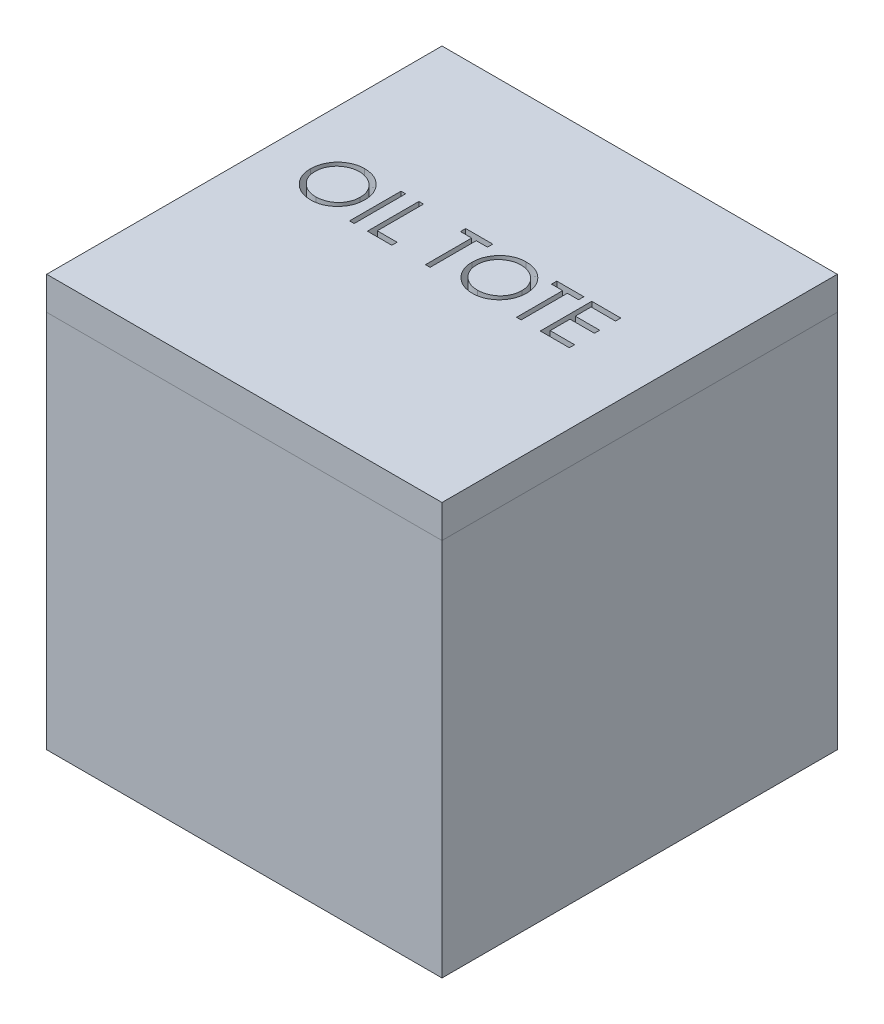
ISO-10303-21;
HEADER;
FILE_DESCRIPTION(('STEP AP214'),'2;1');
FILE_NAME('part.step','',(''),(''),'','','');
FILE_SCHEMA(('AUTOMOTIVE_DESIGN { 1 0 10303 214 1 1 1 1 }'));
ENDSEC;
DATA;
#1=APPLICATION_CONTEXT('core data for automotive mechanical design processes');
#2=APPLICATION_PROTOCOL_DEFINITION('international standard','automotive_design',2000,#1);
#3=PRODUCT_CONTEXT('',#1,'mechanical');
#4=PRODUCT('Part','Part','',(#3));
#5=PRODUCT_RELATED_PRODUCT_CATEGORY('part','',(#4));
#6=PRODUCT_DEFINITION_FORMATION('','',#4);
#7=PRODUCT_DEFINITION_CONTEXT('part definition',#1,'design');
#8=PRODUCT_DEFINITION('design','',#6,#7);
#9=PRODUCT_DEFINITION_SHAPE('','',#8);
#10=(LENGTH_UNIT() NAMED_UNIT(*) SI_UNIT(.MILLI.,.METRE.));
#11=(NAMED_UNIT(*) PLANE_ANGLE_UNIT() SI_UNIT($,.RADIAN.));
#12=(NAMED_UNIT(*) SI_UNIT($,.STERADIAN.) SOLID_ANGLE_UNIT());
#13=UNCERTAINTY_MEASURE_WITH_UNIT(LENGTH_MEASURE(1.E-05),#10,'distance_accuracy_value','');
#14=(GEOMETRIC_REPRESENTATION_CONTEXT(3) GLOBAL_UNCERTAINTY_ASSIGNED_CONTEXT((#13)) GLOBAL_UNIT_ASSIGNED_CONTEXT((#10,
#11,#12)) REPRESENTATION_CONTEXT('',''));
#15=CARTESIAN_POINT('',(0.,0.,0.));
#16=DIRECTION('',(0.,0.,1.));
#17=DIRECTION('',(1.,0.,0.));
#18=AXIS2_PLACEMENT_3D('',#15,#16,#17);
#19=CARTESIAN_POINT('',(0.,1270.,0.));
#20=DIRECTION('',(0.,1.,0.));
#21=DIRECTION('',(0.,0.,1.));
#22=AXIS2_PLACEMENT_3D('',#19,#20,#21);
#23=PLANE('',#22);
#24=DIRECTION('',(-1.,0.,0.));
#25=VECTOR('',#24,1.);
#26=CARTESIAN_POINT('',(-270.830764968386,1270.,0.));
#27=LINE('',#26,#25);
#28=CARTESIAN_POINT('',(-270.830764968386,1270.,0.));
#29=VERTEX_POINT('',#28);
#30=CARTESIAN_POINT('',(-285.077559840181,1270.,0.));
#31=VERTEX_POINT('',#30);
#32=EDGE_CURVE('E484',#29,#31,#27,.T.);
#33=ORIENTED_EDGE('',*,*,#32,.T.);
#34=DIRECTION('',(0.,0.,-1.));
#35=VECTOR('',#34,1.);
#36=CARTESIAN_POINT('',(-285.077559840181,1270.,0.));
#37=LINE('',#36,#35);
#38=CARTESIAN_POINT('',(-285.077559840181,1270.,-158.75));
#39=VERTEX_POINT('',#38);
#40=EDGE_CURVE('E486',#31,#39,#37,.T.);
#41=ORIENTED_EDGE('',*,*,#40,.T.);
#42=DIRECTION('',(1.,0.,0.));
#43=VECTOR('',#42,1.);
#44=CARTESIAN_POINT('',(-285.077559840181,1270.,-158.75));
#45=LINE('',#44,#43);
#46=CARTESIAN_POINT('',(-270.830764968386,1270.,-158.75));
#47=VERTEX_POINT('',#46);
#48=EDGE_CURVE('E491',#39,#47,#45,.T.);
#49=ORIENTED_EDGE('',*,*,#48,.T.);
#50=DIRECTION('',(0.,0.,1.));
#51=VECTOR('',#50,1.);
#52=CARTESIAN_POINT('',(-270.830764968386,1270.,-158.75));
#53=LINE('',#52,#51);
#54=EDGE_CURVE('E487',#47,#29,#53,.T.);
#55=ORIENTED_EDGE('',*,*,#54,.T.);
#56=EDGE_LOOP('',(#33,#41,#49,#55));
#57=FACE_BOUND('',#56,.T.);
#58=DIRECTION('',(-1.,0.,0.));
#59=VECTOR('',#58,1.);
#60=CARTESIAN_POINT('',(-154.821149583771,1270.,0.));
#61=LINE('',#60,#59);
#62=CARTESIAN_POINT('',(-154.821149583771,1270.,0.));
#63=VERTEX_POINT('',#62);
#64=CARTESIAN_POINT('',(-230.125636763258,1270.,0.));
#65=VERTEX_POINT('',#64);
#66=EDGE_CURVE('E490',#63,#65,#61,.T.);
#67=ORIENTED_EDGE('',*,*,#66,.T.);
#68=DIRECTION('',(0.,0.,-1.));
#69=VECTOR('',#68,1.);
#70=CARTESIAN_POINT('',(-230.125636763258,1270.,0.));
#71=LINE('',#70,#69);
#72=CARTESIAN_POINT('',(-230.125636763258,1270.,-158.75));
#73=VERTEX_POINT('',#72);
#74=EDGE_CURVE('E1382',#65,#73,#71,.T.);
#75=ORIENTED_EDGE('',*,*,#74,.T.);
#76=DIRECTION('',(1.,0.,0.));
#77=VECTOR('',#76,1.);
#78=CARTESIAN_POINT('',(-230.125636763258,1270.,-158.75));
#79=LINE('',#78,#77);
#80=CARTESIAN_POINT('',(-215.878841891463,1270.,-158.75));
#81=VERTEX_POINT('',#80);
#82=EDGE_CURVE('E1392',#73,#81,#79,.T.);
#83=ORIENTED_EDGE('',*,*,#82,.T.);
#84=DIRECTION('',(0.,0.,1.));
#85=VECTOR('',#84,1.);
#86=CARTESIAN_POINT('',(-215.878841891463,1270.,-158.75));
#87=LINE('',#86,#85);
#88=CARTESIAN_POINT('',(-215.878841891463,1270.,-16.2820512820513));
#89=VERTEX_POINT('',#88);
#90=EDGE_CURVE('E1389',#81,#89,#87,.T.);
#91=ORIENTED_EDGE('',*,*,#90,.T.);
#92=DIRECTION('',(1.,0.,0.));
#93=VECTOR('',#92,1.);
#94=CARTESIAN_POINT('',(-215.878841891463,1270.,-16.2820512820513));
#95=LINE('',#94,#93);
#96=CARTESIAN_POINT('',(-154.821149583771,1270.,-16.2820512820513));
#97=VERTEX_POINT('',#96);
#98=EDGE_CURVE('E1386',#89,#97,#95,.T.);
#99=ORIENTED_EDGE('',*,*,#98,.T.);
#100=DIRECTION('',(0.,0.,1.));
#101=VECTOR('',#100,1.);
#102=CARTESIAN_POINT('',(-154.821149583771,1270.,-16.2820512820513));
#103=LINE('',#102,#101);
#104=EDGE_CURVE('E1383',#97,#63,#103,.T.);
#105=ORIENTED_EDGE('',*,*,#104,.T.);
#106=EDGE_LOOP('',(#67,#75,#83,#91,#99,#105));
#107=FACE_BOUND('',#106,.T.);
#108=DIRECTION('',(0.,0.,-1.));
#109=VECTOR('',#108,1.);
#110=CARTESIAN_POINT('',(-51.0230726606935,1270.,0.));
#111=LINE('',#110,#109);
#112=CARTESIAN_POINT('',(-51.0230726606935,1270.,0.));
#113=VERTEX_POINT('',#112);
#114=CARTESIAN_POINT('',(-51.0230726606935,1270.,-142.467948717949));
#115=VERTEX_POINT('',#114);
#116=EDGE_CURVE('E1321',#113,#115,#111,.T.);
#117=ORIENTED_EDGE('',*,*,#116,.T.);
#118=DIRECTION('',(-1.,0.,0.));
#119=VECTOR('',#118,1.);
#120=CARTESIAN_POINT('',(-51.0230726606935,1270.,-142.467948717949));
#121=LINE('',#120,#119);
#122=CARTESIAN_POINT('',(-85.6224316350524,1270.,-142.467948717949));
#123=VERTEX_POINT('',#122);
#124=EDGE_CURVE('E1335',#115,#123,#121,.T.);
#125=ORIENTED_EDGE('',*,*,#124,.T.);
#126=DIRECTION('',(0.,0.,-1.));
#127=VECTOR('',#126,1.);
#128=CARTESIAN_POINT('',(-85.6224316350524,1270.,-142.467948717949));
#129=LINE('',#128,#127);
#130=CARTESIAN_POINT('',(-85.6224316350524,1270.,-158.75));
#131=VERTEX_POINT('',#130);
#132=EDGE_CURVE('E1332',#123,#131,#129,.T.);
#133=ORIENTED_EDGE('',*,*,#132,.T.);
#134=DIRECTION('',(1.,0.,0.));
#135=VECTOR('',#134,1.);
#136=CARTESIAN_POINT('',(-85.6224316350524,1270.,-158.75));
#137=LINE('',#136,#135);
#138=CARTESIAN_POINT('',(-2.17691881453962,1270.,-158.75));
#139=VERTEX_POINT('',#138);
#140=EDGE_CURVE('E1329',#131,#139,#137,.T.);
#141=ORIENTED_EDGE('',*,*,#140,.T.);
#142=DIRECTION('',(0.,0.,1.));
#143=VECTOR('',#142,1.);
#144=CARTESIAN_POINT('',(-2.17691881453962,1270.,-158.75));
#145=LINE('',#144,#143);
#146=CARTESIAN_POINT('',(-2.17691881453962,1270.,-142.467948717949));
#147=VERTEX_POINT('',#146);
#148=EDGE_CURVE('E1326',#139,#147,#145,.T.);
#149=ORIENTED_EDGE('',*,*,#148,.T.);
#150=DIRECTION('',(-1.,0.,0.));
#151=VECTOR('',#150,1.);
#152=CARTESIAN_POINT('',(-2.17691881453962,1270.,-142.467948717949));
#153=LINE('',#152,#151);
#154=CARTESIAN_POINT('',(-36.7762777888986,1270.,-142.467948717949));
#155=VERTEX_POINT('',#154);
#156=EDGE_CURVE('E1318',#147,#155,#153,.T.);
#157=ORIENTED_EDGE('',*,*,#156,.T.);
#158=DIRECTION('',(0.,0.,1.));
#159=VECTOR('',#158,1.);
#160=CARTESIAN_POINT('',(-36.7762777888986,1270.,-142.467948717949));
#161=LINE('',#160,#159);
#162=CARTESIAN_POINT('',(-36.7762777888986,1270.,0.));
#163=VERTEX_POINT('',#162);
#164=EDGE_CURVE('E1312',#155,#163,#161,.T.);
#165=ORIENTED_EDGE('',*,*,#164,.T.);
#166=DIRECTION('',(-1.,0.,0.));
#167=VECTOR('',#166,1.);
#168=CARTESIAN_POINT('',(-36.7762777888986,1270.,0.));
#169=LINE('',#168,#167);
#170=EDGE_CURVE('E919',#163,#113,#169,.T.);
#171=ORIENTED_EDGE('',*,*,#170,.T.);
#172=EDGE_LOOP('',(#117,#125,#133,#141,#149,#157,#165,#171));
#173=FACE_BOUND('',#172,.T.);
#174=CARTESIAN_POINT('',(97.8050523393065,1270.,4.07051282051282));
#175=CARTESIAN_POINT('',(94.9283064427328,1270.,4.0002370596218));
#176=CARTESIAN_POINT('',(89.2574745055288,1270.,3.86170482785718));
#177=CARTESIAN_POINT('',(80.9327589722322,1270.,2.67419111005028));
#178=CARTESIAN_POINT('',(72.9373041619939,1270.,0.817210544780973));
#179=CARTESIAN_POINT('',(65.2939746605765,1270.,-1.83661031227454));
#180=CARTESIAN_POINT('',(57.998508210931,1270.,-5.2663918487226));
#181=CARTESIAN_POINT('',(51.0366366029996,1270.,-9.44851904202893));
#182=CARTESIAN_POINT('',(44.4363038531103,1270.,-14.4109143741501));
#183=CARTESIAN_POINT('',(38.2522317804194,1270.,-20.0427554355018));
#184=CARTESIAN_POINT('',(32.5939645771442,1270.,-26.1737508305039));
#185=CARTESIAN_POINT('',(27.660950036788,1270.,-32.7430188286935));
#186=CARTESIAN_POINT('',(23.4778823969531,1270.,-39.6216770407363));
#187=CARTESIAN_POINT('',(20.059616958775,1270.,-46.828814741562));
#188=CARTESIAN_POINT('',(17.3534075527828,1270.,-54.3295908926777));
#189=CARTESIAN_POINT('',(15.5071533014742,1270.,-62.1740396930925));
#190=CARTESIAN_POINT('',(14.3126297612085,1270.,-70.3174387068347));
#191=CARTESIAN_POINT('',(14.1749777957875,1270.,-75.8620273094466));
#192=CARTESIAN_POINT('',(14.1051324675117,1270.,-78.6753806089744));
#193=B_SPLINE_CURVE_WITH_KNOTS('',3,(#174,#175,#176,#177,#178,#179,#180,#181,#182,#183,#184,
#185,#186,#187,#188,#189,#190,#191,#192),.UNSPECIFIED.,.F.,.F.,(4,1,1,1,1,1,1,1,1,1,1,1,1,1,1,1,
4),(0.,0.065818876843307,0.129746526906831,0.192071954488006,0.253459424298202,0.31456958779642,
0.376279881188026,0.43902565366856,0.503267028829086,0.567492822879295,0.629704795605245,
0.690999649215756,0.751451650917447,0.812004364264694,0.873149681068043,0.935635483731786,1.),.UNSPECIFIED.);
#194=CARTESIAN_POINT('',(97.8050523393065,1270.,4.07051282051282));
#195=VERTEX_POINT('',#194);
#196=CARTESIAN_POINT('',(14.1051324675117,1270.,-78.6753806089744));
#197=VERTEX_POINT('',#196);
#198=EDGE_CURVE('E914',#195,#197,#193,.T.);
#199=ORIENTED_EDGE('',*,*,#198,.T.);
#200=CARTESIAN_POINT('',(14.1051324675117,1270.,-78.6753806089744));
#201=CARTESIAN_POINT('',(14.1293820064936,1270.,-80.5637195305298));
#202=CARTESIAN_POINT('',(14.1775751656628,1270.,-84.3165751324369));
#203=CARTESIAN_POINT('',(14.7577697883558,1270.,-89.8894530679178));
#204=CARTESIAN_POINT('',(15.5996755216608,1270.,-95.3727079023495));
#205=CARTESIAN_POINT('',(16.8062622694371,1270.,-100.750747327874));
#206=CARTESIAN_POINT('',(18.3843128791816,1270.,-106.010406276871));
#207=CARTESIAN_POINT('',(20.2463155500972,1270.,-111.187958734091));
#208=CARTESIAN_POINT('',(22.5205156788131,1270.,-116.230934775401));
#209=CARTESIAN_POINT('',(25.0913879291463,1270.,-121.163224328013));
#210=CARTESIAN_POINT('',(27.960762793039,1270.,-125.907940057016));
#211=CARTESIAN_POINT('',(31.1301271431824,1270.,-130.392835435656));
#212=CARTESIAN_POINT('',(34.4881599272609,1270.,-134.655544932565));
#213=CARTESIAN_POINT('',(38.1694995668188,1270.,-138.585605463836));
#214=CARTESIAN_POINT('',(42.0528169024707,1270.,-142.297346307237));
#215=CARTESIAN_POINT('',(46.2011076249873,1270.,-145.733726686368));
#216=CARTESIAN_POINT('',(50.5890594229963,1270.,-148.925733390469));
#217=CARTESIAN_POINT('',(55.2355530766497,1270.,-151.802298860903));
#218=CARTESIAN_POINT('',(60.0260962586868,1270.,-154.403945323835));
#219=CARTESIAN_POINT('',(64.9644358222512,1270.,-156.636507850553));
#220=CARTESIAN_POINT('',(69.9835017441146,1270.,-158.552668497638));
#221=CARTESIAN_POINT('',(75.1068018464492,1270.,-160.105734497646));
#222=CARTESIAN_POINT('',(80.3207311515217,1270.,-161.331830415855));
#223=CARTESIAN_POINT('',(85.6366692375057,1270.,-162.166735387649));
#224=CARTESIAN_POINT('',(91.0503810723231,1270.,-162.748409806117));
#225=CARTESIAN_POINT('',(94.6976087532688,1270.,-162.796375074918));
#226=CARTESIAN_POINT('',(96.5330170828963,1270.,-162.820512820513));
#227=B_SPLINE_CURVE_WITH_KNOTS('',3,(#200,#201,#202,#203,#204,#205,#206,#207,#208,#209,#210,
#211,#212,#213,#214,#215,#216,#217,#218,#219,#220,#221,#222,#223,#224,#225,#226),.UNSPECIFIED.,
.F.,.F.,(4,1,1,1,1,1,1,1,1,1,1,1,1,1,1,1,1,1,1,1,1,1,1,1,4),(0.,0.0432089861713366,
0.0858728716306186,0.128120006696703,0.170151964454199,0.211917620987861,0.253753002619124,
0.29600640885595,0.338443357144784,0.381015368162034,0.422820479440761,0.464089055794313,
0.505125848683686,0.545974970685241,0.58698521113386,0.628338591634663,0.670083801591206,
0.711991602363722,0.753039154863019,0.794049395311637,0.834885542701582,0.875498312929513,
0.916547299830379,0.958003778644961,1.),.UNSPECIFIED.);
#228=CARTESIAN_POINT('',(96.5330170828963,1270.,-162.820512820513));
#229=VERTEX_POINT('',#228);
#230=EDGE_CURVE('E604',#197,#229,#227,.T.);
#231=ORIENTED_EDGE('',*,*,#230,.T.);
#232=CARTESIAN_POINT('',(96.5330170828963,1270.,-162.820512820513));
#233=CARTESIAN_POINT('',(99.4725276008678,1270.,-162.746060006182));
#234=CARTESIAN_POINT('',(105.24596878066,1270.,-162.599828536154));
#235=CARTESIAN_POINT('',(113.731151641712,1270.,-161.480454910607));
#236=CARTESIAN_POINT('',(121.831714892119,1270.,-159.543914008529));
#237=CARTESIAN_POINT('',(129.613646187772,1270.,-156.964771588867));
#238=CARTESIAN_POINT('',(136.983863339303,1270.,-153.52423339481));
#239=CARTESIAN_POINT('',(143.997841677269,1270.,-149.365657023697));
#240=CARTESIAN_POINT('',(150.638892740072,1270.,-144.445474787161));
#241=CARTESIAN_POINT('',(156.817505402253,1270.,-138.801720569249));
#242=CARTESIAN_POINT('',(162.471588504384,1270.,-132.661113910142));
#243=CARTESIAN_POINT('',(167.452976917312,1270.,-126.108008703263));
#244=CARTESIAN_POINT('',(171.627752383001,1270.,-119.182027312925));
#245=CARTESIAN_POINT('',(175.056107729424,1270.,-111.903982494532));
#246=CARTESIAN_POINT('',(177.745723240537,1270.,-104.290333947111));
#247=CARTESIAN_POINT('',(179.60169415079,1270.,-96.300491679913));
#248=CARTESIAN_POINT('',(180.787245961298,1270.,-87.9862239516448));
#249=CARTESIAN_POINT('',(180.925847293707,1270.,-82.3153625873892));
#250=CARTESIAN_POINT('',(180.996158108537,1270.,-79.4386017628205));
#251=B_SPLINE_CURVE_WITH_KNOTS('',3,(#232,#233,#234,#235,#236,#237,#238,#239,#240,#241,#242,
#243,#244,#245,#246,#247,#248,#249,#250),.UNSPECIFIED.,.F.,.F.,(4,1,1,1,1,1,1,1,1,1,1,1,1,1,1,1,
4),(0.,0.0665700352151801,0.130749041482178,0.193412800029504,0.254989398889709,0.3161135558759,
0.377261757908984,0.439400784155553,0.502970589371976,0.566524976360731,0.628231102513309,
0.689090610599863,0.749344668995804,0.810169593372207,0.871609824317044,0.934869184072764,1.),.UNSPECIFIED.);
#252=CARTESIAN_POINT('',(180.996158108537,1270.,-79.4386017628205));
#253=VERTEX_POINT('',#252);
#254=EDGE_CURVE('E926',#229,#253,#251,.T.);
#255=ORIENTED_EDGE('',*,*,#254,.T.);
#256=CARTESIAN_POINT('',(180.996158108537,1270.,-79.4386017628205));
#257=CARTESIAN_POINT('',(180.925857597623,1270.,-76.5830318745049));
#258=CARTESIAN_POINT('',(180.78728714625,1270.,-70.9543728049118));
#259=CARTESIAN_POINT('',(179.600346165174,1270.,-62.6928665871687));
#260=CARTESIAN_POINT('',(177.738843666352,1270.,-54.7512528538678));
#261=CARTESIAN_POINT('',(175.081084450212,1270.,-47.1427893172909));
#262=CARTESIAN_POINT('',(171.669071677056,1270.,-39.8594498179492));
#263=CARTESIAN_POINT('',(167.466497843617,1270.,-32.920398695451));
#264=CARTESIAN_POINT('',(162.516164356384,1270.,-26.3233610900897));
#265=CARTESIAN_POINT('',(156.88249647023,1270.,-20.1406080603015));
#266=CARTESIAN_POINT('',(150.741092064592,1270.,-14.47107992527));
#267=CARTESIAN_POINT('',(144.153862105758,1270.,-9.53083092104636));
#268=CARTESIAN_POINT('',(137.268950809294,1270.,-5.27977241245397));
#269=CARTESIAN_POINT('',(129.997760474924,1270.,-1.88779862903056));
#270=CARTESIAN_POINT('',(122.436723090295,1270.,0.823284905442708));
#271=CARTESIAN_POINT('',(114.518167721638,1270.,2.67170776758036));
#272=CARTESIAN_POINT('',(106.279199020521,1270.,3.86401294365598));
#273=CARTESIAN_POINT('',(100.660764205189,1270.,4.00092420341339));
#274=CARTESIAN_POINT('',(97.8050523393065,1270.,4.07051282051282));
#275=B_SPLINE_CURVE_WITH_KNOTS('',3,(#256,#257,#258,#259,#260,#261,#262,#263,#264,#265,#266,
#267,#268,#269,#270,#271,#272,#273,#274),.UNSPECIFIED.,.F.,.F.,(4,1,1,1,1,1,1,1,1,1,1,1,1,1,1,1,
4),(0.,0.0652265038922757,0.128568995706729,0.190320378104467,0.251377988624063,
0.312387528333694,0.373788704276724,0.43643115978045,0.500566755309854,0.564686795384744,
0.627135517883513,0.68845540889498,0.749245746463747,0.810155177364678,0.871670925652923,
0.934773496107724,1.),.UNSPECIFIED.);
#276=EDGE_CURVE('E764',#253,#195,#275,.T.);
#277=ORIENTED_EDGE('',*,*,#276,.T.);
#278=EDGE_LOOP('',(#199,#231,#255,#277));
#279=FACE_BOUND('',#278,.T.);
#280=DIRECTION('',(0.,0.,1.));
#281=VECTOR('',#280,1.);
#282=CARTESIAN_POINT('',(-609.6,1270.,-609.6));
#283=LINE('',#282,#281);
#284=CARTESIAN_POINT('',(-609.6,1270.,-609.6));
#285=VERTEX_POINT('',#284);
#286=CARTESIAN_POINT('',(-609.6,1270.,609.6));
#287=VERTEX_POINT('',#286);
#288=EDGE_CURVE('E761',#285,#287,#283,.T.);
#289=ORIENTED_EDGE('',*,*,#288,.T.);
#290=DIRECTION('',(1.,0.,0.));
#291=VECTOR('',#290,1.);
#292=CARTESIAN_POINT('',(-609.6,1270.,609.6));
#293=LINE('',#292,#291);
#294=CARTESIAN_POINT('',(609.6,1270.,609.6));
#295=VERTEX_POINT('',#294);
#296=EDGE_CURVE('E759',#287,#295,#293,.T.);
#297=ORIENTED_EDGE('',*,*,#296,.T.);
#298=DIRECTION('',(0.,0.,-1.));
#299=VECTOR('',#298,1.);
#300=CARTESIAN_POINT('',(609.6,1270.,609.6));
#301=LINE('',#300,#299);
#302=CARTESIAN_POINT('',(609.6,1270.,-609.6));
#303=VERTEX_POINT('',#302);
#304=EDGE_CURVE('E747',#295,#303,#301,.T.);
#305=ORIENTED_EDGE('',*,*,#304,.T.);
#306=DIRECTION('',(-1.,0.,0.));
#307=VECTOR('',#306,1.);
#308=CARTESIAN_POINT('',(609.6,1270.,-609.6));
#309=LINE('',#308,#307);
#310=EDGE_CURVE('E755',#303,#285,#309,.T.);
#311=ORIENTED_EDGE('',*,*,#310,.T.);
#312=EDGE_LOOP('',(#289,#297,#305,#311));
#313=FACE_BOUND('',#312,.T.);
#314=DIRECTION('',(-1.,0.,0.));
#315=VECTOR('',#314,1.);
#316=CARTESIAN_POINT('',(392.662824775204,1270.,0.));
#317=LINE('',#316,#315);
#318=CARTESIAN_POINT('',(392.662824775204,1270.,0.));
#319=VERTEX_POINT('',#318);
#320=CARTESIAN_POINT('',(303.111542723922,1270.,0.));
#321=VERTEX_POINT('',#320);
#322=EDGE_CURVE('E757',#319,#321,#317,.T.);
#323=ORIENTED_EDGE('',*,*,#322,.T.);
#324=DIRECTION('',(0.,0.,-1.));
#325=VECTOR('',#324,1.);
#326=CARTESIAN_POINT('',(303.111542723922,1270.,0.));
#327=LINE('',#326,#325);
#328=CARTESIAN_POINT('',(303.111542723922,1270.,-158.75));
#329=VERTEX_POINT('',#328);
#330=EDGE_CURVE('E804',#321,#329,#327,.T.);
#331=ORIENTED_EDGE('',*,*,#330,.T.);
#332=DIRECTION('',(1.,0.,0.));
#333=VECTOR('',#332,1.);
#334=CARTESIAN_POINT('',(303.111542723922,1270.,-158.75));
#335=LINE('',#334,#333);
#336=CARTESIAN_POINT('',(392.662824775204,1270.,-158.75));
#337=VERTEX_POINT('',#336);
#338=EDGE_CURVE('E833',#329,#337,#335,.T.);
#339=ORIENTED_EDGE('',*,*,#338,.T.);
#340=DIRECTION('',(0.,0.,1.));
#341=VECTOR('',#340,1.);
#342=CARTESIAN_POINT('',(392.662824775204,1270.,-158.75));
#343=LINE('',#342,#341);
#344=CARTESIAN_POINT('',(392.662824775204,1270.,-142.467948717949));
#345=VERTEX_POINT('',#344);
#346=EDGE_CURVE('E830',#337,#345,#343,.T.);
#347=ORIENTED_EDGE('',*,*,#346,.T.);
#348=DIRECTION('',(-1.,0.,0.));
#349=VECTOR('',#348,1.);
#350=CARTESIAN_POINT('',(392.662824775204,1270.,-142.467948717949));
#351=LINE('',#350,#349);
#352=CARTESIAN_POINT('',(317.358337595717,1270.,-142.467948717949));
#353=VERTEX_POINT('',#352);
#354=EDGE_CURVE('E827',#345,#353,#351,.T.);
#355=ORIENTED_EDGE('',*,*,#354,.T.);
#356=DIRECTION('',(0.,0.,1.));
#357=VECTOR('',#356,1.);
#358=CARTESIAN_POINT('',(317.358337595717,1270.,-142.467948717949));
#359=LINE('',#358,#357);
#360=CARTESIAN_POINT('',(317.358337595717,1270.,-93.6217948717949));
#361=VERTEX_POINT('',#360);
#362=EDGE_CURVE('E824',#353,#361,#359,.T.);
#363=ORIENTED_EDGE('',*,*,#362,.T.);
#364=DIRECTION('',(1.,0.,0.));
#365=VECTOR('',#364,1.);
#366=CARTESIAN_POINT('',(317.358337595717,1270.,-93.6217948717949));
#367=LINE('',#366,#365);
#368=CARTESIAN_POINT('',(392.662824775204,1270.,-93.6217948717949));
#369=VERTEX_POINT('',#368);
#370=EDGE_CURVE('E821',#361,#369,#367,.T.);
#371=ORIENTED_EDGE('',*,*,#370,.T.);
#372=DIRECTION('',(0.,0.,1.));
#373=VECTOR('',#372,1.);
#374=CARTESIAN_POINT('',(392.662824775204,1270.,-93.6217948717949));
#375=LINE('',#374,#373);
#376=CARTESIAN_POINT('',(392.662824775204,1270.,-77.3397435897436));
#377=VERTEX_POINT('',#376);
#378=EDGE_CURVE('E818',#369,#377,#375,.T.);
#379=ORIENTED_EDGE('',*,*,#378,.T.);
#380=DIRECTION('',(-1.,0.,0.));
#381=VECTOR('',#380,1.);
#382=CARTESIAN_POINT('',(392.662824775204,1270.,-77.3397435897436));
#383=LINE('',#382,#381);
#384=CARTESIAN_POINT('',(317.358337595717,1270.,-77.3397435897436));
#385=VERTEX_POINT('',#384);
#386=EDGE_CURVE('E815',#377,#385,#383,.T.);
#387=ORIENTED_EDGE('',*,*,#386,.T.);
#388=DIRECTION('',(0.,0.,1.));
#389=VECTOR('',#388,1.);
#390=CARTESIAN_POINT('',(317.358337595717,1270.,-77.3397435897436));
#391=LINE('',#390,#389);
#392=CARTESIAN_POINT('',(317.358337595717,1270.,-16.2820512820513));
#393=VERTEX_POINT('',#392);
#394=EDGE_CURVE('E812',#385,#393,#391,.T.);
#395=ORIENTED_EDGE('',*,*,#394,.T.);
#396=DIRECTION('',(1.,0.,0.));
#397=VECTOR('',#396,1.);
#398=CARTESIAN_POINT('',(317.358337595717,1270.,-16.2820512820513));
#399=LINE('',#398,#397);
#400=CARTESIAN_POINT('',(392.662824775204,1270.,-16.2820512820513));
#401=VERTEX_POINT('',#400);
#402=EDGE_CURVE('E809',#393,#401,#399,.T.);
#403=ORIENTED_EDGE('',*,*,#402,.T.);
#404=DIRECTION('',(0.,0.,1.));
#405=VECTOR('',#404,1.);
#406=CARTESIAN_POINT('',(392.662824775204,1270.,-16.2820512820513));
#407=LINE('',#406,#405);
#408=EDGE_CURVE('E805',#401,#319,#407,.T.);
#409=ORIENTED_EDGE('',*,*,#408,.T.);
#410=EDGE_LOOP('',(#323,#331,#339,#347,#355,#363,#371,#379,#387,#395,#403,#409));
#411=FACE_BOUND('',#410,.T.);
#412=DIRECTION('',(0.,0.,-1.));
#413=VECTOR('',#412,1.);
#414=CARTESIAN_POINT('',(229.842311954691,1270.,0.));
#415=LINE('',#414,#413);
#416=CARTESIAN_POINT('',(229.842311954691,1270.,0.));
#417=VERTEX_POINT('',#416);
#418=CARTESIAN_POINT('',(229.842311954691,1270.,-142.467948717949));
#419=VERTEX_POINT('',#418);
#420=EDGE_CURVE('E808',#417,#419,#415,.T.);
#421=ORIENTED_EDGE('',*,*,#420,.T.);
#422=DIRECTION('',(-1.,0.,0.));
#423=VECTOR('',#422,1.);
#424=CARTESIAN_POINT('',(229.842311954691,1270.,-142.467948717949));
#425=LINE('',#424,#423);
#426=CARTESIAN_POINT('',(195.242952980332,1270.,-142.467948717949));
#427=VERTEX_POINT('',#426);
#428=EDGE_CURVE('E879',#419,#427,#425,.T.);
#429=ORIENTED_EDGE('',*,*,#428,.T.);
#430=DIRECTION('',(0.,0.,-1.));
#431=VECTOR('',#430,1.);
#432=CARTESIAN_POINT('',(195.242952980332,1270.,-142.467948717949));
#433=LINE('',#432,#431);
#434=CARTESIAN_POINT('',(195.242952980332,1270.,-158.75));
#435=VERTEX_POINT('',#434);
#436=EDGE_CURVE('E894',#427,#435,#433,.T.);
#437=ORIENTED_EDGE('',*,*,#436,.T.);
#438=DIRECTION('',(1.,0.,0.));
#439=VECTOR('',#438,1.);
#440=CARTESIAN_POINT('',(195.242952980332,1270.,-158.75));
#441=LINE('',#440,#439);
#442=CARTESIAN_POINT('',(278.688465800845,1270.,-158.75));
#443=VERTEX_POINT('',#442);
#444=EDGE_CURVE('E891',#435,#443,#441,.T.);
#445=ORIENTED_EDGE('',*,*,#444,.T.);
#446=DIRECTION('',(0.,0.,1.));
#447=VECTOR('',#446,1.);
#448=CARTESIAN_POINT('',(278.688465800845,1270.,-158.75));
#449=LINE('',#448,#447);
#450=CARTESIAN_POINT('',(278.688465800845,1270.,-142.467948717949));
#451=VERTEX_POINT('',#450);
#452=EDGE_CURVE('E888',#443,#451,#449,.T.);
#453=ORIENTED_EDGE('',*,*,#452,.T.);
#454=DIRECTION('',(-1.,0.,0.));
#455=VECTOR('',#454,1.);
#456=CARTESIAN_POINT('',(278.688465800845,1270.,-142.467948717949));
#457=LINE('',#456,#455);
#458=CARTESIAN_POINT('',(244.089106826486,1270.,-142.467948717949));
#459=VERTEX_POINT('',#458);
#460=EDGE_CURVE('E885',#451,#459,#457,.T.);
#461=ORIENTED_EDGE('',*,*,#460,.T.);
#462=DIRECTION('',(0.,0.,1.));
#463=VECTOR('',#462,1.);
#464=CARTESIAN_POINT('',(244.089106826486,1270.,-142.467948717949));
#465=LINE('',#464,#463);
#466=CARTESIAN_POINT('',(244.089106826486,1270.,0.));
#467=VERTEX_POINT('',#466);
#468=EDGE_CURVE('E882',#459,#467,#465,.T.);
#469=ORIENTED_EDGE('',*,*,#468,.T.);
#470=DIRECTION('',(-1.,0.,0.));
#471=VECTOR('',#470,1.);
#472=CARTESIAN_POINT('',(244.089106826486,1270.,0.));
#473=LINE('',#472,#471);
#474=EDGE_CURVE('E383',#467,#417,#473,.T.);
#475=ORIENTED_EDGE('',*,*,#474,.T.);
#476=EDGE_LOOP('',(#421,#429,#437,#445,#453,#461,#469,#475));
#477=FACE_BOUND('',#476,.T.);
#478=CARTESIAN_POINT('',(-400.832768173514,1270.,4.07051282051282));
#479=CARTESIAN_POINT('',(-403.709514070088,1270.,4.00023705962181));
#480=CARTESIAN_POINT('',(-409.380346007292,1270.,3.86170482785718));
#481=CARTESIAN_POINT('',(-417.705061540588,1270.,2.67419111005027));
#482=CARTESIAN_POINT('',(-425.700516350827,1270.,0.817210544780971));
#483=CARTESIAN_POINT('',(-433.343845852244,1270.,-1.83661031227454));
#484=CARTESIAN_POINT('',(-440.63931230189,1270.,-5.2663918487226));
#485=CARTESIAN_POINT('',(-447.601183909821,1270.,-9.44851904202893));
#486=CARTESIAN_POINT('',(-454.20151665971,1270.,-14.4109143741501));
#487=CARTESIAN_POINT('',(-460.385588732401,1270.,-20.0427554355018));
#488=CARTESIAN_POINT('',(-466.043855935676,1270.,-26.1737508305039));
#489=CARTESIAN_POINT('',(-470.976870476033,1270.,-32.7430188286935));
#490=CARTESIAN_POINT('',(-475.159938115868,1270.,-39.6216770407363));
#491=CARTESIAN_POINT('',(-478.578203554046,1270.,-46.8288147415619));
#492=CARTESIAN_POINT('',(-481.284412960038,1270.,-54.3295908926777));
#493=CARTESIAN_POINT('',(-483.130667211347,1270.,-62.1740396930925));
#494=CARTESIAN_POINT('',(-484.325190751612,1270.,-70.3174387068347));
#495=CARTESIAN_POINT('',(-484.462842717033,1270.,-75.8620273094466));
#496=CARTESIAN_POINT('',(-484.532688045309,1270.,-78.6753806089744));
#497=B_SPLINE_CURVE_WITH_KNOTS('',3,(#478,#479,#480,#481,#482,#483,#484,#485,#486,#487,#488,
#489,#490,#491,#492,#493,#494,#495,#496),.UNSPECIFIED.,.F.,.F.,(4,1,1,1,1,1,1,1,1,1,1,1,1,1,1,1,
4),(0.,0.065818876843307,0.129746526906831,0.192071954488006,0.253459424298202,0.31456958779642,
0.376279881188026,0.43902565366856,0.503267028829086,0.567492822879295,0.629704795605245,
0.690999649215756,0.751451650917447,0.812004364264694,0.873149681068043,0.935635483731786,1.),.UNSPECIFIED.);
#498=CARTESIAN_POINT('',(-400.832768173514,1270.,4.07051282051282));
#499=VERTEX_POINT('',#498);
#500=CARTESIAN_POINT('',(-484.532688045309,1270.,-78.6753806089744));
#501=VERTEX_POINT('',#500);
#502=EDGE_CURVE('E380',#499,#501,#497,.T.);
#503=ORIENTED_EDGE('',*,*,#502,.T.);
#504=CARTESIAN_POINT('',(-484.532688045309,1270.,-78.6753806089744));
#505=CARTESIAN_POINT('',(-484.508438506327,1270.,-80.5637195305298));
#506=CARTESIAN_POINT('',(-484.460245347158,1270.,-84.3165751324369));
#507=CARTESIAN_POINT('',(-483.880050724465,1270.,-89.8894530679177));
#508=CARTESIAN_POINT('',(-483.03814499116,1270.,-95.3727079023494));
#509=CARTESIAN_POINT('',(-481.831558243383,1270.,-100.750747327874));
#510=CARTESIAN_POINT('',(-480.253507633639,1270.,-106.010406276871));
#511=CARTESIAN_POINT('',(-478.391504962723,1270.,-111.187958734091));
#512=CARTESIAN_POINT('',(-476.117304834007,1270.,-116.230934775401));
#513=CARTESIAN_POINT('',(-473.546432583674,1270.,-121.163224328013));
#514=CARTESIAN_POINT('',(-470.677057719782,1270.,-125.907940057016));
#515=CARTESIAN_POINT('',(-467.507693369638,1270.,-130.392835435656));
#516=CARTESIAN_POINT('',(-464.14966058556,1270.,-134.655544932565));
#517=CARTESIAN_POINT('',(-460.468320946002,1270.,-138.585605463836));
#518=CARTESIAN_POINT('',(-456.58500361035,1270.,-142.297346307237));
#519=CARTESIAN_POINT('',(-452.436712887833,1270.,-145.733726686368));
#520=CARTESIAN_POINT('',(-448.048761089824,1270.,-148.925733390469));
#521=CARTESIAN_POINT('',(-443.402267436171,1270.,-151.802298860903));
#522=CARTESIAN_POINT('',(-438.611724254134,1270.,-154.403945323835));
#523=CARTESIAN_POINT('',(-433.673384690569,1270.,-156.636507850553));
#524=CARTESIAN_POINT('',(-428.654318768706,1270.,-158.552668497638));
#525=CARTESIAN_POINT('',(-423.531018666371,1270.,-160.105734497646));
#526=CARTESIAN_POINT('',(-418.317089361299,1270.,-161.331830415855));
#527=CARTESIAN_POINT('',(-413.001151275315,1270.,-162.166735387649));
#528=CARTESIAN_POINT('',(-407.587439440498,1270.,-162.748409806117));
#529=CARTESIAN_POINT('',(-403.940211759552,1270.,-162.796375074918));
#530=CARTESIAN_POINT('',(-402.104803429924,1270.,-162.820512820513));
#531=B_SPLINE_CURVE_WITH_KNOTS('',3,(#504,#505,#506,#507,#508,#509,#510,#511,#512,#513,#514,
#515,#516,#517,#518,#519,#520,#521,#522,#523,#524,#525,#526,#527,#528,#529,#530),.UNSPECIFIED.,
.F.,.F.,(4,1,1,1,1,1,1,1,1,1,1,1,1,1,1,1,1,1,1,1,1,1,1,1,4),(0.,0.0432089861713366,
0.0858728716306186,0.128120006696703,0.170151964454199,0.211917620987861,0.253753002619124,
0.296006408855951,0.338443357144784,0.381015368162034,0.422820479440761,0.464089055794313,
0.505125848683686,0.545974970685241,0.58698521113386,0.628338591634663,0.670083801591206,
0.711991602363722,0.753039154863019,0.794049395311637,0.834885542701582,0.875498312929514,
0.916547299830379,0.958003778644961,1.),.UNSPECIFIED.);
#532=CARTESIAN_POINT('',(-402.104803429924,1270.,-162.820512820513));
#533=VERTEX_POINT('',#532);
#534=EDGE_CURVE('E90',#501,#533,#531,.T.);
#535=ORIENTED_EDGE('',*,*,#534,.T.);
#536=CARTESIAN_POINT('',(-402.104803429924,1270.,-162.820512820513));
#537=CARTESIAN_POINT('',(-399.165292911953,1270.,-162.746060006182));
#538=CARTESIAN_POINT('',(-393.39185173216,1270.,-162.599828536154));
#539=CARTESIAN_POINT('',(-384.906668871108,1270.,-161.480454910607));
#540=CARTESIAN_POINT('',(-376.806105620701,1270.,-159.543914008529));
#541=CARTESIAN_POINT('',(-369.024174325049,1270.,-156.964771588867));
#542=CARTESIAN_POINT('',(-361.653957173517,1270.,-153.52423339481));
#543=CARTESIAN_POINT('',(-354.639978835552,1270.,-149.365657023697));
#544=CARTESIAN_POINT('',(-347.998927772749,1270.,-144.445474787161));
#545=CARTESIAN_POINT('',(-341.820315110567,1270.,-138.801720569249));
#546=CARTESIAN_POINT('',(-336.166232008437,1270.,-132.661113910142));
#547=CARTESIAN_POINT('',(-331.184843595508,1270.,-126.108008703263));
#548=CARTESIAN_POINT('',(-327.01006812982,1270.,-119.182027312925));
#549=CARTESIAN_POINT('',(-323.581712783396,1270.,-111.903982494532));
#550=CARTESIAN_POINT('',(-320.892097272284,1270.,-104.290333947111));
#551=CARTESIAN_POINT('',(-319.036126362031,1270.,-96.300491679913));
#552=CARTESIAN_POINT('',(-317.850574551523,1270.,-87.9862239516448));
#553=CARTESIAN_POINT('',(-317.711973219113,1270.,-82.3153625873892));
#554=CARTESIAN_POINT('',(-317.641662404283,1270.,-79.4386017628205));
#555=B_SPLINE_CURVE_WITH_KNOTS('',3,(#536,#537,#538,#539,#540,#541,#542,#543,#544,#545,#546,
#547,#548,#549,#550,#551,#552,#553,#554),.UNSPECIFIED.,.F.,.F.,(4,1,1,1,1,1,1,1,1,1,1,1,1,1,1,1,
4),(0.,0.0665700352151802,0.130749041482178,0.193412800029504,0.254989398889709,0.3161135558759,
0.377261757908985,0.439400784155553,0.502970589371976,0.566524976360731,0.628231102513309,
0.689090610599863,0.749344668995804,0.810169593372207,0.871609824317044,0.934869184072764,1.),.UNSPECIFIED.);
#556=CARTESIAN_POINT('',(-317.641662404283,1270.,-79.4386017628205));
#557=VERTEX_POINT('',#556);
#558=EDGE_CURVE('E80',#533,#557,#555,.T.);
#559=ORIENTED_EDGE('',*,*,#558,.T.);
#560=CARTESIAN_POINT('',(-317.641662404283,1270.,-79.4386017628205));
#561=CARTESIAN_POINT('',(-317.711962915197,1270.,-76.5830318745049));
#562=CARTESIAN_POINT('',(-317.850533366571,1270.,-70.9543728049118));
#563=CARTESIAN_POINT('',(-319.037474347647,1270.,-62.6928665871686));
#564=CARTESIAN_POINT('',(-320.898976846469,1270.,-54.7512528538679));
#565=CARTESIAN_POINT('',(-323.556736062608,1270.,-47.1427893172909));
#566=CARTESIAN_POINT('',(-326.968748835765,1270.,-39.8594498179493));
#567=CARTESIAN_POINT('',(-331.171322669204,1270.,-32.9203986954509));
#568=CARTESIAN_POINT('',(-336.121656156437,1270.,-26.3233610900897));
#569=CARTESIAN_POINT('',(-341.755324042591,1270.,-20.1406080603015));
#570=CARTESIAN_POINT('',(-347.896728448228,1270.,-14.47107992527));
#571=CARTESIAN_POINT('',(-354.483958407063,1270.,-9.53083092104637));
#572=CARTESIAN_POINT('',(-361.368869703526,1270.,-5.27977241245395));
#573=CARTESIAN_POINT('',(-368.640060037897,1270.,-1.88779862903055));
#574=CARTESIAN_POINT('',(-376.201097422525,1270.,0.823284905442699));
#575=CARTESIAN_POINT('',(-384.119652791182,1270.,2.67170776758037));
#576=CARTESIAN_POINT('',(-392.3586214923,1270.,3.86401294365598));
#577=CARTESIAN_POINT('',(-397.977056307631,1270.,4.00092420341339));
#578=CARTESIAN_POINT('',(-400.832768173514,1270.,4.07051282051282));
#579=B_SPLINE_CURVE_WITH_KNOTS('',3,(#560,#561,#562,#563,#564,#565,#566,#567,#568,#569,#570,
#571,#572,#573,#574,#575,#576,#577,#578),.UNSPECIFIED.,.F.,.F.,(4,1,1,1,1,1,1,1,1,1,1,1,1,1,1,1,
4),(0.,0.0652265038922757,0.128568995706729,0.190320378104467,0.251377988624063,
0.312387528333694,0.373788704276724,0.43643115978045,0.500566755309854,0.564686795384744,
0.627135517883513,0.688455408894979,0.749245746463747,0.810155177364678,0.871670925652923,
0.934773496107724,1.),.UNSPECIFIED.);
#580=EDGE_CURVE('E375',#557,#499,#579,.T.);
#581=ORIENTED_EDGE('',*,*,#580,.T.);
#582=EDGE_LOOP('',(#503,#535,#559,#581));
#583=FACE_BOUND('',#582,.T.);
#584=ADVANCED_FACE('F43',(#57,#107,#173,#279,#313,#411,#477,#583),#23,.T.);
#585=CARTESIAN_POINT('',(0.,1168.4,0.));
#586=DIRECTION('',(0.,1.,0.));
#587=DIRECTION('',(0.,0.,1.));
#588=AXIS2_PLACEMENT_3D('',#585,#586,#587);
#589=PLANE('',#588);
#590=DIRECTION('',(0.,0.,-1.));
#591=VECTOR('',#590,1.);
#592=CARTESIAN_POINT('',(-285.077559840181,1168.4,0.));
#593=LINE('',#592,#591);
#594=CARTESIAN_POINT('',(-285.077559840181,1168.4,0.));
#595=VERTEX_POINT('',#594);
#596=CARTESIAN_POINT('',(-285.077559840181,1168.4,-158.75));
#597=VERTEX_POINT('',#596);
#598=EDGE_CURVE('E440',#595,#597,#593,.T.);
#599=ORIENTED_EDGE('',*,*,#598,.F.);
#600=DIRECTION('',(-1.,0.,0.));
#601=VECTOR('',#600,1.);
#602=CARTESIAN_POINT('',(-270.830764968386,1168.4,0.));
#603=LINE('',#602,#601);
#604=CARTESIAN_POINT('',(-270.830764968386,1168.4,0.));
#605=VERTEX_POINT('',#604);
#606=EDGE_CURVE('E473',#605,#595,#603,.T.);
#607=ORIENTED_EDGE('',*,*,#606,.F.);
#608=DIRECTION('',(0.,0.,1.));
#609=VECTOR('',#608,1.);
#610=CARTESIAN_POINT('',(-270.830764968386,1168.4,-158.75));
#611=LINE('',#610,#609);
#612=CARTESIAN_POINT('',(-270.830764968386,1168.4,-158.75));
#613=VERTEX_POINT('',#612);
#614=EDGE_CURVE('E496',#613,#605,#611,.T.);
#615=ORIENTED_EDGE('',*,*,#614,.F.);
#616=DIRECTION('',(1.,0.,0.));
#617=VECTOR('',#616,1.);
#618=CARTESIAN_POINT('',(-285.077559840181,1168.4,-158.75));
#619=LINE('',#618,#617);
#620=EDGE_CURVE('E500',#597,#613,#619,.T.);
#621=ORIENTED_EDGE('',*,*,#620,.F.);
#622=EDGE_LOOP('',(#599,#607,#615,#621));
#623=FACE_BOUND('',#622,.T.);
#624=DIRECTION('',(-1.,0.,0.));
#625=VECTOR('',#624,1.);
#626=CARTESIAN_POINT('',(-51.0230726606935,1168.4,-142.467948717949));
#627=LINE('',#626,#625);
#628=CARTESIAN_POINT('',(-51.0230726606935,1168.4,-142.467948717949));
#629=VERTEX_POINT('',#628);
#630=CARTESIAN_POINT('',(-85.6224316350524,1168.4,-142.467948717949));
#631=VERTEX_POINT('',#630);
#632=EDGE_CURVE('E445',#629,#631,#627,.T.);
#633=ORIENTED_EDGE('',*,*,#632,.F.);
#634=DIRECTION('',(0.,0.,-1.));
#635=VECTOR('',#634,1.);
#636=CARTESIAN_POINT('',(-51.0230726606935,1168.4,0.));
#637=LINE('',#636,#635);
#638=CARTESIAN_POINT('',(-51.0230726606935,1168.4,0.));
#639=VERTEX_POINT('',#638);
#640=EDGE_CURVE('E1338',#639,#629,#637,.T.);
#641=ORIENTED_EDGE('',*,*,#640,.F.);
#642=DIRECTION('',(-1.,0.,0.));
#643=VECTOR('',#642,1.);
#644=CARTESIAN_POINT('',(-36.7762777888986,1168.4,0.));
#645=LINE('',#644,#643);
#646=CARTESIAN_POINT('',(-36.7762777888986,1168.4,0.));
#647=VERTEX_POINT('',#646);
#648=EDGE_CURVE('E1342',#647,#639,#645,.T.);
#649=ORIENTED_EDGE('',*,*,#648,.F.);
#650=DIRECTION('',(0.,0.,1.));
#651=VECTOR('',#650,1.);
#652=CARTESIAN_POINT('',(-36.7762777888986,1168.4,-142.467948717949));
#653=LINE('',#652,#651);
#654=CARTESIAN_POINT('',(-36.7762777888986,1168.4,-142.467948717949));
#655=VERTEX_POINT('',#654);
#656=EDGE_CURVE('E1346',#655,#647,#653,.T.);
#657=ORIENTED_EDGE('',*,*,#656,.F.);
#658=DIRECTION('',(-1.,0.,0.));
#659=VECTOR('',#658,1.);
#660=CARTESIAN_POINT('',(-2.17691881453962,1168.4,-142.467948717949));
#661=LINE('',#660,#659);
#662=CARTESIAN_POINT('',(-2.17691881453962,1168.4,-142.467948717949));
#663=VERTEX_POINT('',#662);
#664=EDGE_CURVE('E1349',#663,#655,#661,.T.);
#665=ORIENTED_EDGE('',*,*,#664,.F.);
#666=DIRECTION('',(0.,0.,1.));
#667=VECTOR('',#666,1.);
#668=CARTESIAN_POINT('',(-2.17691881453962,1168.4,-158.75));
#669=LINE('',#668,#667);
#670=CARTESIAN_POINT('',(-2.17691881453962,1168.4,-158.75));
#671=VERTEX_POINT('',#670);
#672=EDGE_CURVE('E1352',#671,#663,#669,.T.);
#673=ORIENTED_EDGE('',*,*,#672,.F.);
#674=DIRECTION('',(1.,0.,0.));
#675=VECTOR('',#674,1.);
#676=CARTESIAN_POINT('',(-85.6224316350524,1168.4,-158.75));
#677=LINE('',#676,#675);
#678=CARTESIAN_POINT('',(-85.6224316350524,1168.4,-158.75));
#679=VERTEX_POINT('',#678);
#680=EDGE_CURVE('E1355',#679,#671,#677,.T.);
#681=ORIENTED_EDGE('',*,*,#680,.F.);
#682=DIRECTION('',(0.,0.,-1.));
#683=VECTOR('',#682,1.);
#684=CARTESIAN_POINT('',(-85.6224316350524,1168.4,-142.467948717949));
#685=LINE('',#684,#683);
#686=EDGE_CURVE('E1358',#631,#679,#685,.T.);
#687=ORIENTED_EDGE('',*,*,#686,.F.);
#688=EDGE_LOOP('',(#633,#641,#649,#657,#665,#673,#681,#687));
#689=FACE_BOUND('',#688,.T.);
#690=DIRECTION('',(-1.,0.,0.));
#691=VECTOR('',#690,1.);
#692=CARTESIAN_POINT('',(229.842311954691,1168.4,-142.467948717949));
#693=LINE('',#692,#691);
#694=CARTESIAN_POINT('',(229.842311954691,1168.4,-142.467948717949));
#695=VERTEX_POINT('',#694);
#696=CARTESIAN_POINT('',(195.242952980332,1168.4,-142.467948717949));
#697=VERTEX_POINT('',#696);
#698=EDGE_CURVE('E450',#695,#697,#693,.T.);
#699=ORIENTED_EDGE('',*,*,#698,.F.);
#700=DIRECTION('',(0.,0.,-1.));
#701=VECTOR('',#700,1.);
#702=CARTESIAN_POINT('',(229.842311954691,1168.4,0.));
#703=LINE('',#702,#701);
#704=CARTESIAN_POINT('',(229.842311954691,1168.4,0.));
#705=VERTEX_POINT('',#704);
#706=EDGE_CURVE('E873',#705,#695,#703,.T.);
#707=ORIENTED_EDGE('',*,*,#706,.F.);
#708=DIRECTION('',(-1.,0.,0.));
#709=VECTOR('',#708,1.);
#710=CARTESIAN_POINT('',(244.089106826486,1168.4,0.));
#711=LINE('',#710,#709);
#712=CARTESIAN_POINT('',(244.089106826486,1168.4,0.));
#713=VERTEX_POINT('',#712);
#714=EDGE_CURVE('E870',#713,#705,#711,.T.);
#715=ORIENTED_EDGE('',*,*,#714,.F.);
#716=DIRECTION('',(0.,0.,1.));
#717=VECTOR('',#716,1.);
#718=CARTESIAN_POINT('',(244.089106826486,1168.4,-142.467948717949));
#719=LINE('',#718,#717);
#720=CARTESIAN_POINT('',(244.089106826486,1168.4,-142.467948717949));
#721=VERTEX_POINT('',#720);
#722=EDGE_CURVE('E867',#721,#713,#719,.T.);
#723=ORIENTED_EDGE('',*,*,#722,.F.);
#724=DIRECTION('',(-1.,0.,0.));
#725=VECTOR('',#724,1.);
#726=CARTESIAN_POINT('',(278.688465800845,1168.4,-142.467948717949));
#727=LINE('',#726,#725);
#728=CARTESIAN_POINT('',(278.688465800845,1168.4,-142.467948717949));
#729=VERTEX_POINT('',#728);
#730=EDGE_CURVE('E864',#729,#721,#727,.T.);
#731=ORIENTED_EDGE('',*,*,#730,.F.);
#732=DIRECTION('',(0.,0.,1.));
#733=VECTOR('',#732,1.);
#734=CARTESIAN_POINT('',(278.688465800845,1168.4,-158.75));
#735=LINE('',#734,#733);
#736=CARTESIAN_POINT('',(278.688465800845,1168.4,-158.75));
#737=VERTEX_POINT('',#736);
#738=EDGE_CURVE('E861',#737,#729,#735,.T.);
#739=ORIENTED_EDGE('',*,*,#738,.F.);
#740=DIRECTION('',(1.,0.,0.));
#741=VECTOR('',#740,1.);
#742=CARTESIAN_POINT('',(195.242952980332,1168.4,-158.75));
#743=LINE('',#742,#741);
#744=CARTESIAN_POINT('',(195.242952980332,1168.4,-158.75));
#745=VERTEX_POINT('',#744);
#746=EDGE_CURVE('E858',#745,#737,#743,.T.);
#747=ORIENTED_EDGE('',*,*,#746,.F.);
#748=DIRECTION('',(0.,0.,-1.));
#749=VECTOR('',#748,1.);
#750=CARTESIAN_POINT('',(195.242952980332,1168.4,-142.467948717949));
#751=LINE('',#750,#749);
#752=EDGE_CURVE('E855',#697,#745,#751,.T.);
#753=ORIENTED_EDGE('',*,*,#752,.F.);
#754=EDGE_LOOP('',(#699,#707,#715,#723,#731,#739,#747,#753));
#755=FACE_BOUND('',#754,.T.);
#756=DIRECTION('',(0.,0.,1.));
#757=VECTOR('',#756,1.);
#758=CARTESIAN_POINT('',(-609.6,1168.4,-609.6));
#759=LINE('',#758,#757);
#760=CARTESIAN_POINT('',(-609.6,1168.4,-609.6));
#761=VERTEX_POINT('',#760);
#762=CARTESIAN_POINT('',(-609.6,1168.4,609.6));
#763=VERTEX_POINT('',#762);
#764=EDGE_CURVE('E385',#761,#763,#759,.T.);
#765=ORIENTED_EDGE('',*,*,#764,.F.);
#766=DIRECTION('',(-1.,0.,0.));
#767=VECTOR('',#766,1.);
#768=CARTESIAN_POINT('',(609.6,1168.4,-609.6));
#769=LINE('',#768,#767);
#770=CARTESIAN_POINT('',(609.6,1168.4,-609.6));
#771=VERTEX_POINT('',#770);
#772=EDGE_CURVE('E748',#771,#761,#769,.T.);
#773=ORIENTED_EDGE('',*,*,#772,.F.);
#774=DIRECTION('',(0.,0.,-1.));
#775=VECTOR('',#774,1.);
#776=CARTESIAN_POINT('',(609.6,1168.4,609.6));
#777=LINE('',#776,#775);
#778=CARTESIAN_POINT('',(609.6,1168.4,609.6));
#779=VERTEX_POINT('',#778);
#780=EDGE_CURVE('E745',#779,#771,#777,.T.);
#781=ORIENTED_EDGE('',*,*,#780,.F.);
#782=DIRECTION('',(1.,0.,0.));
#783=VECTOR('',#782,1.);
#784=CARTESIAN_POINT('',(-609.6,1168.4,609.6));
#785=LINE('',#784,#783);
#786=EDGE_CURVE('E736',#763,#779,#785,.T.);
#787=ORIENTED_EDGE('',*,*,#786,.F.);
#788=EDGE_LOOP('',(#765,#773,#781,#787));
#789=FACE_BOUND('',#788,.T.);
#790=DIRECTION('',(0.,0.,-1.));
#791=VECTOR('',#790,1.);
#792=CARTESIAN_POINT('',(303.111542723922,1168.4,0.));
#793=LINE('',#792,#791);
#794=CARTESIAN_POINT('',(303.111542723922,1168.4,0.));
#795=VERTEX_POINT('',#794);
#796=CARTESIAN_POINT('',(303.111542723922,1168.4,-158.75));
#797=VERTEX_POINT('',#796);
#798=EDGE_CURVE('E458',#795,#797,#793,.T.);
#799=ORIENTED_EDGE('',*,*,#798,.F.);
#800=DIRECTION('',(-1.,0.,0.));
#801=VECTOR('',#800,1.);
#802=CARTESIAN_POINT('',(392.662824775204,1168.4,0.));
#803=LINE('',#802,#801);
#804=CARTESIAN_POINT('',(392.662824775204,1168.4,0.));
#805=VERTEX_POINT('',#804);
#806=EDGE_CURVE('E798',#805,#795,#803,.T.);
#807=ORIENTED_EDGE('',*,*,#806,.F.);
#808=DIRECTION('',(0.,0.,1.));
#809=VECTOR('',#808,1.);
#810=CARTESIAN_POINT('',(392.662824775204,1168.4,-16.2820512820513));
#811=LINE('',#810,#809);
#812=CARTESIAN_POINT('',(392.662824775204,1168.4,-16.2820512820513));
#813=VERTEX_POINT('',#812);
#814=EDGE_CURVE('E795',#813,#805,#811,.T.);
#815=ORIENTED_EDGE('',*,*,#814,.F.);
#816=DIRECTION('',(1.,0.,0.));
#817=VECTOR('',#816,1.);
#818=CARTESIAN_POINT('',(317.358337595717,1168.4,-16.2820512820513));
#819=LINE('',#818,#817);
#820=CARTESIAN_POINT('',(317.358337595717,1168.4,-16.2820512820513));
#821=VERTEX_POINT('',#820);
#822=EDGE_CURVE('E792',#821,#813,#819,.T.);
#823=ORIENTED_EDGE('',*,*,#822,.F.);
#824=DIRECTION('',(0.,0.,1.));
#825=VECTOR('',#824,1.);
#826=CARTESIAN_POINT('',(317.358337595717,1168.4,-77.3397435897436));
#827=LINE('',#826,#825);
#828=CARTESIAN_POINT('',(317.358337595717,1168.4,-77.3397435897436));
#829=VERTEX_POINT('',#828);
#830=EDGE_CURVE('E789',#829,#821,#827,.T.);
#831=ORIENTED_EDGE('',*,*,#830,.F.);
#832=DIRECTION('',(-1.,0.,0.));
#833=VECTOR('',#832,1.);
#834=CARTESIAN_POINT('',(392.662824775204,1168.4,-77.3397435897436));
#835=LINE('',#834,#833);
#836=CARTESIAN_POINT('',(392.662824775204,1168.4,-77.3397435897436));
#837=VERTEX_POINT('',#836);
#838=EDGE_CURVE('E786',#837,#829,#835,.T.);
#839=ORIENTED_EDGE('',*,*,#838,.F.);
#840=DIRECTION('',(0.,0.,1.));
#841=VECTOR('',#840,1.);
#842=CARTESIAN_POINT('',(392.662824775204,1168.4,-93.6217948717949));
#843=LINE('',#842,#841);
#844=CARTESIAN_POINT('',(392.662824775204,1168.4,-93.6217948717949));
#845=VERTEX_POINT('',#844);
#846=EDGE_CURVE('E783',#845,#837,#843,.T.);
#847=ORIENTED_EDGE('',*,*,#846,.F.);
#848=DIRECTION('',(1.,0.,0.));
#849=VECTOR('',#848,1.);
#850=CARTESIAN_POINT('',(317.358337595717,1168.4,-93.6217948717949));
#851=LINE('',#850,#849);
#852=CARTESIAN_POINT('',(317.358337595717,1168.4,-93.6217948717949));
#853=VERTEX_POINT('',#852);
#854=EDGE_CURVE('E780',#853,#845,#851,.T.);
#855=ORIENTED_EDGE('',*,*,#854,.F.);
#856=DIRECTION('',(0.,0.,1.));
#857=VECTOR('',#856,1.);
#858=CARTESIAN_POINT('',(317.358337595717,1168.4,-142.467948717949));
#859=LINE('',#858,#857);
#860=CARTESIAN_POINT('',(317.358337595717,1168.4,-142.467948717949));
#861=VERTEX_POINT('',#860);
#862=EDGE_CURVE('E777',#861,#853,#859,.T.);
#863=ORIENTED_EDGE('',*,*,#862,.F.);
#864=DIRECTION('',(-1.,0.,0.));
#865=VECTOR('',#864,1.);
#866=CARTESIAN_POINT('',(392.662824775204,1168.4,-142.467948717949));
#867=LINE('',#866,#865);
#868=CARTESIAN_POINT('',(392.662824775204,1168.4,-142.467948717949));
#869=VERTEX_POINT('',#868);
#870=EDGE_CURVE('E774',#869,#861,#867,.T.);
#871=ORIENTED_EDGE('',*,*,#870,.F.);
#872=DIRECTION('',(0.,0.,1.));
#873=VECTOR('',#872,1.);
#874=CARTESIAN_POINT('',(392.662824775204,1168.4,-158.75));
#875=LINE('',#874,#873);
#876=CARTESIAN_POINT('',(392.662824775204,1168.4,-158.75));
#877=VERTEX_POINT('',#876);
#878=EDGE_CURVE('E771',#877,#869,#875,.T.);
#879=ORIENTED_EDGE('',*,*,#878,.F.);
#880=DIRECTION('',(1.,0.,0.));
#881=VECTOR('',#880,1.);
#882=CARTESIAN_POINT('',(303.111542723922,1168.4,-158.75));
#883=LINE('',#882,#881);
#884=EDGE_CURVE('E768',#797,#877,#883,.T.);
#885=ORIENTED_EDGE('',*,*,#884,.F.);
#886=EDGE_LOOP('',(#799,#807,#815,#823,#831,#839,#847,#855,#863,#871,#879,#885));
#887=FACE_BOUND('',#886,.T.);
#888=CARTESIAN_POINT('',(14.1051324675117,1168.4,-78.6753806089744));
#889=CARTESIAN_POINT('',(14.1293820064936,1168.4,-80.5637195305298));
#890=CARTESIAN_POINT('',(14.1775751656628,1168.4,-84.3165751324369));
#891=CARTESIAN_POINT('',(14.7577697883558,1168.4,-89.8894530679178));
#892=CARTESIAN_POINT('',(15.5996755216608,1168.4,-95.3727079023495));
#893=CARTESIAN_POINT('',(16.8062622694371,1168.4,-100.750747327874));
#894=CARTESIAN_POINT('',(18.3843128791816,1168.4,-106.010406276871));
#895=CARTESIAN_POINT('',(20.2463155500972,1168.4,-111.187958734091));
#896=CARTESIAN_POINT('',(22.5205156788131,1168.4,-116.230934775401));
#897=CARTESIAN_POINT('',(25.0913879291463,1168.4,-121.163224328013));
#898=CARTESIAN_POINT('',(27.960762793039,1168.4,-125.907940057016));
#899=CARTESIAN_POINT('',(31.1301271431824,1168.4,-130.392835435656));
#900=CARTESIAN_POINT('',(34.4881599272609,1168.4,-134.655544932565));
#901=CARTESIAN_POINT('',(38.1694995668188,1168.4,-138.585605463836));
#902=CARTESIAN_POINT('',(42.0528169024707,1168.4,-142.297346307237));
#903=CARTESIAN_POINT('',(46.2011076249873,1168.4,-145.733726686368));
#904=CARTESIAN_POINT('',(50.5890594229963,1168.4,-148.925733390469));
#905=CARTESIAN_POINT('',(55.2355530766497,1168.4,-151.802298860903));
#906=CARTESIAN_POINT('',(60.0260962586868,1168.4,-154.403945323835));
#907=CARTESIAN_POINT('',(64.9644358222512,1168.4,-156.636507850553));
#908=CARTESIAN_POINT('',(69.9835017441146,1168.4,-158.552668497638));
#909=CARTESIAN_POINT('',(75.1068018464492,1168.4,-160.105734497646));
#910=CARTESIAN_POINT('',(80.3207311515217,1168.4,-161.331830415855));
#911=CARTESIAN_POINT('',(85.6366692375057,1168.4,-162.166735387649));
#912=CARTESIAN_POINT('',(91.0503810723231,1168.4,-162.748409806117));
#913=CARTESIAN_POINT('',(94.6976087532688,1168.4,-162.796375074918));
#914=CARTESIAN_POINT('',(96.5330170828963,1168.4,-162.820512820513));
#915=B_SPLINE_CURVE_WITH_KNOTS('',3,(#888,#889,#890,#891,#892,#893,#894,#895,#896,#897,#898,
#899,#900,#901,#902,#903,#904,#905,#906,#907,#908,#909,#910,#911,#912,#913,#914),.UNSPECIFIED.,
.F.,.F.,(4,1,1,1,1,1,1,1,1,1,1,1,1,1,1,1,1,1,1,1,1,1,1,1,4),(0.,0.0432089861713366,
0.0858728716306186,0.128120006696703,0.170151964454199,0.211917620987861,0.253753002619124,
0.29600640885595,0.338443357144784,0.381015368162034,0.422820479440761,0.464089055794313,
0.505125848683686,0.545974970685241,0.58698521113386,0.628338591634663,0.670083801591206,
0.711991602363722,0.753039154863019,0.794049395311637,0.834885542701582,0.875498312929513,
0.916547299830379,0.958003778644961,1.),.UNSPECIFIED.);
#916=CARTESIAN_POINT('',(14.1051324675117,1168.4,-78.6753806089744));
#917=VERTEX_POINT('',#916);
#918=CARTESIAN_POINT('',(96.5330170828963,1168.4,-162.820512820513));
#919=VERTEX_POINT('',#918);
#920=EDGE_CURVE('E463',#917,#919,#915,.T.);
#921=ORIENTED_EDGE('',*,*,#920,.F.);
#922=CARTESIAN_POINT('',(97.8050523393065,1168.4,4.07051282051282));
#923=CARTESIAN_POINT('',(94.9283064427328,1168.4,4.0002370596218));
#924=CARTESIAN_POINT('',(89.2574745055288,1168.4,3.86170482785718));
#925=CARTESIAN_POINT('',(80.9327589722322,1168.4,2.67419111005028));
#926=CARTESIAN_POINT('',(72.9373041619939,1168.4,0.817210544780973));
#927=CARTESIAN_POINT('',(65.2939746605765,1168.4,-1.83661031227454));
#928=CARTESIAN_POINT('',(57.998508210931,1168.4,-5.2663918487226));
#929=CARTESIAN_POINT('',(51.0366366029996,1168.4,-9.44851904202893));
#930=CARTESIAN_POINT('',(44.4363038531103,1168.4,-14.4109143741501));
#931=CARTESIAN_POINT('',(38.2522317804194,1168.4,-20.0427554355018));
#932=CARTESIAN_POINT('',(32.5939645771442,1168.4,-26.1737508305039));
#933=CARTESIAN_POINT('',(27.660950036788,1168.4,-32.7430188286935));
#934=CARTESIAN_POINT('',(23.4778823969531,1168.4,-39.6216770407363));
#935=CARTESIAN_POINT('',(20.059616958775,1168.4,-46.828814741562));
#936=CARTESIAN_POINT('',(17.3534075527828,1168.4,-54.3295908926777));
#937=CARTESIAN_POINT('',(15.5071533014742,1168.4,-62.1740396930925));
#938=CARTESIAN_POINT('',(14.3126297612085,1168.4,-70.3174387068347));
#939=CARTESIAN_POINT('',(14.1749777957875,1168.4,-75.8620273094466));
#940=CARTESIAN_POINT('',(14.1051324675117,1168.4,-78.6753806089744));
#941=B_SPLINE_CURVE_WITH_KNOTS('',3,(#922,#923,#924,#925,#926,#927,#928,#929,#930,#931,#932,
#933,#934,#935,#936,#937,#938,#939,#940),.UNSPECIFIED.,.F.,.F.,(4,1,1,1,1,1,1,1,1,1,1,1,1,1,1,1,
4),(0.,0.065818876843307,0.129746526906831,0.192071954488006,0.253459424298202,0.31456958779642,
0.376279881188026,0.43902565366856,0.503267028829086,0.567492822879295,0.629704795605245,
0.690999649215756,0.751451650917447,0.812004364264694,0.873149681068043,0.935635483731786,1.),.UNSPECIFIED.);
#942=CARTESIAN_POINT('',(97.8050523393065,1168.4,4.07051282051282));
#943=VERTEX_POINT('',#942);
#944=EDGE_CURVE('E597',#943,#917,#941,.T.);
#945=ORIENTED_EDGE('',*,*,#944,.F.);
#946=CARTESIAN_POINT('',(180.996158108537,1168.4,-79.4386017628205));
#947=CARTESIAN_POINT('',(180.925857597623,1168.4,-76.5830318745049));
#948=CARTESIAN_POINT('',(180.78728714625,1168.4,-70.9543728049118));
#949=CARTESIAN_POINT('',(179.600346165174,1168.4,-62.6928665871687));
#950=CARTESIAN_POINT('',(177.738843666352,1168.4,-54.7512528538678));
#951=CARTESIAN_POINT('',(175.081084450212,1168.4,-47.1427893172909));
#952=CARTESIAN_POINT('',(171.669071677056,1168.4,-39.8594498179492));
#953=CARTESIAN_POINT('',(167.466497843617,1168.4,-32.920398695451));
#954=CARTESIAN_POINT('',(162.516164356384,1168.4,-26.3233610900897));
#955=CARTESIAN_POINT('',(156.88249647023,1168.4,-20.1406080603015));
#956=CARTESIAN_POINT('',(150.741092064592,1168.4,-14.47107992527));
#957=CARTESIAN_POINT('',(144.153862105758,1168.4,-9.53083092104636));
#958=CARTESIAN_POINT('',(137.268950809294,1168.4,-5.27977241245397));
#959=CARTESIAN_POINT('',(129.997760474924,1168.4,-1.88779862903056));
#960=CARTESIAN_POINT('',(122.436723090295,1168.4,0.823284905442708));
#961=CARTESIAN_POINT('',(114.518167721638,1168.4,2.67170776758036));
#962=CARTESIAN_POINT('',(106.279199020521,1168.4,3.86401294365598));
#963=CARTESIAN_POINT('',(100.660764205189,1168.4,4.00092420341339));
#964=CARTESIAN_POINT('',(97.8050523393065,1168.4,4.07051282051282));
#965=B_SPLINE_CURVE_WITH_KNOTS('',3,(#946,#947,#948,#949,#950,#951,#952,#953,#954,#955,#956,
#957,#958,#959,#960,#961,#962,#963,#964),.UNSPECIFIED.,.F.,.F.,(4,1,1,1,1,1,1,1,1,1,1,1,1,1,1,1,
4),(0.,0.0652265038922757,0.128568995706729,0.190320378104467,0.251377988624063,
0.312387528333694,0.373788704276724,0.43643115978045,0.500566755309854,0.564686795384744,
0.627135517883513,0.68845540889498,0.749245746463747,0.810155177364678,0.871670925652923,
0.934773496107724,1.),.UNSPECIFIED.);
#966=CARTESIAN_POINT('',(180.996158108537,1168.4,-79.4386017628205));
#967=VERTEX_POINT('',#966);
#968=EDGE_CURVE('E608',#967,#943,#965,.T.);
#969=ORIENTED_EDGE('',*,*,#968,.F.);
#970=CARTESIAN_POINT('',(96.5330170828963,1168.4,-162.820512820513));
#971=CARTESIAN_POINT('',(99.4725276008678,1168.4,-162.746060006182));
#972=CARTESIAN_POINT('',(105.24596878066,1168.4,-162.599828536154));
#973=CARTESIAN_POINT('',(113.731151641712,1168.4,-161.480454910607));
#974=CARTESIAN_POINT('',(121.831714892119,1168.4,-159.543914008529));
#975=CARTESIAN_POINT('',(129.613646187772,1168.4,-156.964771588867));
#976=CARTESIAN_POINT('',(136.983863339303,1168.4,-153.52423339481));
#977=CARTESIAN_POINT('',(143.997841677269,1168.4,-149.365657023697));
#978=CARTESIAN_POINT('',(150.638892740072,1168.4,-144.445474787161));
#979=CARTESIAN_POINT('',(156.817505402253,1168.4,-138.801720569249));
#980=CARTESIAN_POINT('',(162.471588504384,1168.4,-132.661113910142));
#981=CARTESIAN_POINT('',(167.452976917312,1168.4,-126.108008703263));
#982=CARTESIAN_POINT('',(171.627752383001,1168.4,-119.182027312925));
#983=CARTESIAN_POINT('',(175.056107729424,1168.4,-111.903982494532));
#984=CARTESIAN_POINT('',(177.745723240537,1168.4,-104.290333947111));
#985=CARTESIAN_POINT('',(179.60169415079,1168.4,-96.300491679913));
#986=CARTESIAN_POINT('',(180.787245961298,1168.4,-87.9862239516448));
#987=CARTESIAN_POINT('',(180.925847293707,1168.4,-82.3153625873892));
#988=CARTESIAN_POINT('',(180.996158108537,1168.4,-79.4386017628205));
#989=B_SPLINE_CURVE_WITH_KNOTS('',3,(#970,#971,#972,#973,#974,#975,#976,#977,#978,#979,#980,
#981,#982,#983,#984,#985,#986,#987,#988),.UNSPECIFIED.,.F.,.F.,(4,1,1,1,1,1,1,1,1,1,1,1,1,1,1,1,
4),(0.,0.0665700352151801,0.130749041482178,0.193412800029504,0.254989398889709,0.3161135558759,
0.377261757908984,0.439400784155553,0.502970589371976,0.566524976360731,0.628231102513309,
0.689090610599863,0.749344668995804,0.810169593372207,0.871609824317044,0.934869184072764,1.),.UNSPECIFIED.);
#990=EDGE_CURVE('E618',#919,#967,#989,.T.);
#991=ORIENTED_EDGE('',*,*,#990,.F.);
#992=EDGE_LOOP('',(#921,#945,#969,#991));
#993=FACE_BOUND('',#992,.T.);
#994=DIRECTION('',(0.,0.,-1.));
#995=VECTOR('',#994,1.);
#996=CARTESIAN_POINT('',(-230.125636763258,1168.4,0.));
#997=LINE('',#996,#995);
#998=CARTESIAN_POINT('',(-230.125636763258,1168.4,0.));
#999=VERTEX_POINT('',#998);
#1000=CARTESIAN_POINT('',(-230.125636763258,1168.4,-158.75));
#1001=VERTEX_POINT('',#1000);
#1002=EDGE_CURVE('E468',#999,#1001,#997,.T.);
#1003=ORIENTED_EDGE('',*,*,#1002,.F.);
#1004=DIRECTION('',(-1.,0.,0.));
#1005=VECTOR('',#1004,1.);
#1006=CARTESIAN_POINT('',(-154.821149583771,1168.4,0.));
#1007=LINE('',#1006,#1005);
#1008=CARTESIAN_POINT('',(-154.821149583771,1168.4,0.));
#1009=VERTEX_POINT('',#1008);
#1010=EDGE_CURVE('E1377',#1009,#999,#1007,.T.);
#1011=ORIENTED_EDGE('',*,*,#1010,.F.);
#1012=DIRECTION('',(0.,0.,1.));
#1013=VECTOR('',#1012,1.);
#1014=CARTESIAN_POINT('',(-154.821149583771,1168.4,-16.2820512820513));
#1015=LINE('',#1014,#1013);
#1016=CARTESIAN_POINT('',(-154.821149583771,1168.4,-16.2820512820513));
#1017=VERTEX_POINT('',#1016);
#1018=EDGE_CURVE('E1374',#1017,#1009,#1015,.T.);
#1019=ORIENTED_EDGE('',*,*,#1018,.F.);
#1020=DIRECTION('',(1.,0.,0.));
#1021=VECTOR('',#1020,1.);
#1022=CARTESIAN_POINT('',(-215.878841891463,1168.4,-16.2820512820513));
#1023=LINE('',#1022,#1021);
#1024=CARTESIAN_POINT('',(-215.878841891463,1168.4,-16.2820512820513));
#1025=VERTEX_POINT('',#1024);
#1026=EDGE_CURVE('E1371',#1025,#1017,#1023,.T.);
#1027=ORIENTED_EDGE('',*,*,#1026,.F.);
#1028=DIRECTION('',(0.,0.,1.));
#1029=VECTOR('',#1028,1.);
#1030=CARTESIAN_POINT('',(-215.878841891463,1168.4,-158.75));
#1031=LINE('',#1030,#1029);
#1032=CARTESIAN_POINT('',(-215.878841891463,1168.4,-158.75));
#1033=VERTEX_POINT('',#1032);
#1034=EDGE_CURVE('E1368',#1033,#1025,#1031,.T.);
#1035=ORIENTED_EDGE('',*,*,#1034,.F.);
#1036=DIRECTION('',(1.,0.,0.));
#1037=VECTOR('',#1036,1.);
#1038=CARTESIAN_POINT('',(-230.125636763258,1168.4,-158.75));
#1039=LINE('',#1038,#1037);
#1040=EDGE_CURVE('E1365',#1001,#1033,#1039,.T.);
#1041=ORIENTED_EDGE('',*,*,#1040,.F.);
#1042=EDGE_LOOP('',(#1003,#1011,#1019,#1027,#1035,#1041));
#1043=FACE_BOUND('',#1042,.T.);
#1044=CARTESIAN_POINT('',(-484.532688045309,1168.4,-78.6753806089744));
#1045=CARTESIAN_POINT('',(-484.508438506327,1168.4,-80.5637195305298));
#1046=CARTESIAN_POINT('',(-484.460245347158,1168.4,-84.3165751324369));
#1047=CARTESIAN_POINT('',(-483.880050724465,1168.4,-89.8894530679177));
#1048=CARTESIAN_POINT('',(-483.03814499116,1168.4,-95.3727079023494));
#1049=CARTESIAN_POINT('',(-481.831558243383,1168.4,-100.750747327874));
#1050=CARTESIAN_POINT('',(-480.253507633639,1168.4,-106.010406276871));
#1051=CARTESIAN_POINT('',(-478.391504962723,1168.4,-111.187958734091));
#1052=CARTESIAN_POINT('',(-476.117304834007,1168.4,-116.230934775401));
#1053=CARTESIAN_POINT('',(-473.546432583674,1168.4,-121.163224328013));
#1054=CARTESIAN_POINT('',(-470.677057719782,1168.4,-125.907940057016));
#1055=CARTESIAN_POINT('',(-467.507693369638,1168.4,-130.392835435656));
#1056=CARTESIAN_POINT('',(-464.14966058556,1168.4,-134.655544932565));
#1057=CARTESIAN_POINT('',(-460.468320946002,1168.4,-138.585605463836));
#1058=CARTESIAN_POINT('',(-456.58500361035,1168.4,-142.297346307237));
#1059=CARTESIAN_POINT('',(-452.436712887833,1168.4,-145.733726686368));
#1060=CARTESIAN_POINT('',(-448.048761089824,1168.4,-148.925733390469));
#1061=CARTESIAN_POINT('',(-443.402267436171,1168.4,-151.802298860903));
#1062=CARTESIAN_POINT('',(-438.611724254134,1168.4,-154.403945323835));
#1063=CARTESIAN_POINT('',(-433.673384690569,1168.4,-156.636507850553));
#1064=CARTESIAN_POINT('',(-428.654318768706,1168.4,-158.552668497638));
#1065=CARTESIAN_POINT('',(-423.531018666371,1168.4,-160.105734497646));
#1066=CARTESIAN_POINT('',(-418.317089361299,1168.4,-161.331830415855));
#1067=CARTESIAN_POINT('',(-413.001151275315,1168.4,-162.166735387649));
#1068=CARTESIAN_POINT('',(-407.587439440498,1168.4,-162.748409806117));
#1069=CARTESIAN_POINT('',(-403.940211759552,1168.4,-162.796375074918));
#1070=CARTESIAN_POINT('',(-402.104803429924,1168.4,-162.820512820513));
#1071=B_SPLINE_CURVE_WITH_KNOTS('',3,(#1044,#1045,#1046,#1047,#1048,#1049,#1050,#1051,#1052,
#1053,#1054,#1055,#1056,#1057,#1058,#1059,#1060,#1061,#1062,#1063,#1064,#1065,#1066,#1067,#1068,
#1069,#1070),.UNSPECIFIED.,.F.,.F.,(4,1,1,1,1,1,1,1,1,1,1,1,1,1,1,1,1,1,1,1,1,1,1,1,4),(0.,
0.0432089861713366,0.0858728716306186,0.128120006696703,0.170151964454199,0.211917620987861,
0.253753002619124,0.296006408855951,0.338443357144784,0.381015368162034,0.422820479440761,
0.464089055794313,0.505125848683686,0.545974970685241,0.58698521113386,0.628338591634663,
0.670083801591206,0.711991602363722,0.753039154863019,0.794049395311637,0.834885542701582,
0.875498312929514,0.916547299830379,0.958003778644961,1.),.UNSPECIFIED.);
#1072=CARTESIAN_POINT('',(-484.532688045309,1168.4,-78.6753806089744));
#1073=VERTEX_POINT('',#1072);
#1074=CARTESIAN_POINT('',(-402.104803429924,1168.4,-162.820512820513));
#1075=VERTEX_POINT('',#1074);
#1076=EDGE_CURVE('E46',#1073,#1075,#1071,.T.);
#1077=ORIENTED_EDGE('',*,*,#1076,.F.);
#1078=CARTESIAN_POINT('',(-400.832768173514,1168.4,4.07051282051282));
#1079=CARTESIAN_POINT('',(-403.709514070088,1168.4,4.00023705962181));
#1080=CARTESIAN_POINT('',(-409.380346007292,1168.4,3.86170482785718));
#1081=CARTESIAN_POINT('',(-417.705061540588,1168.4,2.67419111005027));
#1082=CARTESIAN_POINT('',(-425.700516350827,1168.4,0.817210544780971));
#1083=CARTESIAN_POINT('',(-433.343845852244,1168.4,-1.83661031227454));
#1084=CARTESIAN_POINT('',(-440.63931230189,1168.4,-5.2663918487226));
#1085=CARTESIAN_POINT('',(-447.601183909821,1168.4,-9.44851904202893));
#1086=CARTESIAN_POINT('',(-454.20151665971,1168.4,-14.4109143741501));
#1087=CARTESIAN_POINT('',(-460.385588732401,1168.4,-20.0427554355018));
#1088=CARTESIAN_POINT('',(-466.043855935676,1168.4,-26.1737508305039));
#1089=CARTESIAN_POINT('',(-470.976870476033,1168.4,-32.7430188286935));
#1090=CARTESIAN_POINT('',(-475.159938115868,1168.4,-39.6216770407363));
#1091=CARTESIAN_POINT('',(-478.578203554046,1168.4,-46.8288147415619));
#1092=CARTESIAN_POINT('',(-481.284412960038,1168.4,-54.3295908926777));
#1093=CARTESIAN_POINT('',(-483.130667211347,1168.4,-62.1740396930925));
#1094=CARTESIAN_POINT('',(-484.325190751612,1168.4,-70.3174387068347));
#1095=CARTESIAN_POINT('',(-484.462842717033,1168.4,-75.8620273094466));
#1096=CARTESIAN_POINT('',(-484.532688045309,1168.4,-78.6753806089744));
#1097=B_SPLINE_CURVE_WITH_KNOTS('',3,(#1078,#1079,#1080,#1081,#1082,#1083,#1084,#1085,#1086,
#1087,#1088,#1089,#1090,#1091,#1092,#1093,#1094,#1095,#1096),.UNSPECIFIED.,.F.,.F.,(4,1,1,1,1,1,
1,1,1,1,1,1,1,1,1,1,4),(0.,0.065818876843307,0.129746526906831,0.192071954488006,
0.253459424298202,0.31456958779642,0.376279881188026,0.43902565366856,0.503267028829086,
0.567492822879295,0.629704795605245,0.690999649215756,0.751451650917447,0.812004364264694,
0.873149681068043,0.935635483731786,1.),.UNSPECIFIED.);
#1098=CARTESIAN_POINT('',(-400.832768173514,1168.4,4.07051282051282));
#1099=VERTEX_POINT('',#1098);
#1100=EDGE_CURVE('E55',#1099,#1073,#1097,.T.);
#1101=ORIENTED_EDGE('',*,*,#1100,.F.);
#1102=CARTESIAN_POINT('',(-317.641662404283,1168.4,-79.4386017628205));
#1103=CARTESIAN_POINT('',(-317.711962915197,1168.4,-76.5830318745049));
#1104=CARTESIAN_POINT('',(-317.850533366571,1168.4,-70.9543728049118));
#1105=CARTESIAN_POINT('',(-319.037474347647,1168.4,-62.6928665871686));
#1106=CARTESIAN_POINT('',(-320.898976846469,1168.4,-54.7512528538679));
#1107=CARTESIAN_POINT('',(-323.556736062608,1168.4,-47.1427893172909));
#1108=CARTESIAN_POINT('',(-326.968748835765,1168.4,-39.8594498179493));
#1109=CARTESIAN_POINT('',(-331.171322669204,1168.4,-32.9203986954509));
#1110=CARTESIAN_POINT('',(-336.121656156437,1168.4,-26.3233610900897));
#1111=CARTESIAN_POINT('',(-341.755324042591,1168.4,-20.1406080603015));
#1112=CARTESIAN_POINT('',(-347.896728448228,1168.4,-14.47107992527));
#1113=CARTESIAN_POINT('',(-354.483958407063,1168.4,-9.53083092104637));
#1114=CARTESIAN_POINT('',(-361.368869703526,1168.4,-5.27977241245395));
#1115=CARTESIAN_POINT('',(-368.640060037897,1168.4,-1.88779862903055));
#1116=CARTESIAN_POINT('',(-376.201097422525,1168.4,0.823284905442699));
#1117=CARTESIAN_POINT('',(-384.119652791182,1168.4,2.67170776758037));
#1118=CARTESIAN_POINT('',(-392.3586214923,1168.4,3.86401294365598));
#1119=CARTESIAN_POINT('',(-397.977056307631,1168.4,4.00092420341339));
#1120=CARTESIAN_POINT('',(-400.832768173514,1168.4,4.07051282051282));
#1121=B_SPLINE_CURVE_WITH_KNOTS('',3,(#1102,#1103,#1104,#1105,#1106,#1107,#1108,#1109,#1110,
#1111,#1112,#1113,#1114,#1115,#1116,#1117,#1118,#1119,#1120),.UNSPECIFIED.,.F.,.F.,(4,1,1,1,1,1,
1,1,1,1,1,1,1,1,1,1,4),(0.,0.0652265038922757,0.128568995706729,0.190320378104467,
0.251377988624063,0.312387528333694,0.373788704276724,0.43643115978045,0.500566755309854,
0.564686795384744,0.627135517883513,0.688455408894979,0.749245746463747,0.810155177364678,
0.871670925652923,0.934773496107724,1.),.UNSPECIFIED.);
#1122=CARTESIAN_POINT('',(-317.641662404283,1168.4,-79.4386017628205));
#1123=VERTEX_POINT('',#1122);
#1124=EDGE_CURVE('E377',#1123,#1099,#1121,.T.);
#1125=ORIENTED_EDGE('',*,*,#1124,.F.);
#1126=CARTESIAN_POINT('',(-402.104803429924,1168.4,-162.820512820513));
#1127=CARTESIAN_POINT('',(-399.165292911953,1168.4,-162.746060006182));
#1128=CARTESIAN_POINT('',(-393.39185173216,1168.4,-162.599828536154));
#1129=CARTESIAN_POINT('',(-384.906668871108,1168.4,-161.480454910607));
#1130=CARTESIAN_POINT('',(-376.806105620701,1168.4,-159.543914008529));
#1131=CARTESIAN_POINT('',(-369.024174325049,1168.4,-156.964771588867));
#1132=CARTESIAN_POINT('',(-361.653957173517,1168.4,-153.52423339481));
#1133=CARTESIAN_POINT('',(-354.639978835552,1168.4,-149.365657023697));
#1134=CARTESIAN_POINT('',(-347.998927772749,1168.4,-144.445474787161));
#1135=CARTESIAN_POINT('',(-341.820315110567,1168.4,-138.801720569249));
#1136=CARTESIAN_POINT('',(-336.166232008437,1168.4,-132.661113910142));
#1137=CARTESIAN_POINT('',(-331.184843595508,1168.4,-126.108008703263));
#1138=CARTESIAN_POINT('',(-327.01006812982,1168.4,-119.182027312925));
#1139=CARTESIAN_POINT('',(-323.581712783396,1168.4,-111.903982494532));
#1140=CARTESIAN_POINT('',(-320.892097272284,1168.4,-104.290333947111));
#1141=CARTESIAN_POINT('',(-319.036126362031,1168.4,-96.300491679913));
#1142=CARTESIAN_POINT('',(-317.850574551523,1168.4,-87.9862239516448));
#1143=CARTESIAN_POINT('',(-317.711973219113,1168.4,-82.3153625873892));
#1144=CARTESIAN_POINT('',(-317.641662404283,1168.4,-79.4386017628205));
#1145=B_SPLINE_CURVE_WITH_KNOTS('',3,(#1126,#1127,#1128,#1129,#1130,#1131,#1132,#1133,#1134,
#1135,#1136,#1137,#1138,#1139,#1140,#1141,#1142,#1143,#1144),.UNSPECIFIED.,.F.,.F.,(4,1,1,1,1,1,
1,1,1,1,1,1,1,1,1,1,4),(0.,0.0665700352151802,0.130749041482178,0.193412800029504,
0.254989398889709,0.3161135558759,0.377261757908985,0.439400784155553,0.502970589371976,
0.566524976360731,0.628231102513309,0.689090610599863,0.749344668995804,0.810169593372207,
0.871609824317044,0.934869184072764,1.),.UNSPECIFIED.);
#1146=EDGE_CURVE('E76',#1075,#1123,#1145,.T.);
#1147=ORIENTED_EDGE('',*,*,#1146,.F.);
#1148=EDGE_LOOP('',(#1077,#1101,#1125,#1147));
#1149=FACE_BOUND('',#1148,.T.);
#1150=ADVANCED_FACE('F424',(#623,#689,#755,#789,#887,#993,#1043,#1149),#589,.F.);
#1151=CARTESIAN_POINT('',(-609.6,1270.,-609.6));
#1152=DIRECTION('',(1.,0.,0.));
#1153=DIRECTION('',(0.,0.,-1.));
#1154=AXIS2_PLACEMENT_3D('',#1151,#1152,#1153);
#1155=PLANE('',#1154);
#1156=ORIENTED_EDGE('',*,*,#764,.T.);
#1157=DIRECTION('',(0.,-1.,0.));
#1158=VECTOR('',#1157,1.);
#1159=CARTESIAN_POINT('',(-609.6,1270.,609.6));
#1160=LINE('',#1159,#1158);
#1161=EDGE_CURVE('E741',#287,#763,#1160,.T.);
#1162=ORIENTED_EDGE('',*,*,#1161,.F.);
#1163=ORIENTED_EDGE('',*,*,#288,.F.);
#1164=DIRECTION('',(0.,-1.,0.));
#1165=VECTOR('',#1164,1.);
#1166=CARTESIAN_POINT('',(-609.6,1270.,-609.6));
#1167=LINE('',#1166,#1165);
#1168=EDGE_CURVE('E388',#285,#761,#1167,.T.);
#1169=ORIENTED_EDGE('',*,*,#1168,.T.);
#1170=EDGE_LOOP('',(#1156,#1162,#1163,#1169));
#1171=FACE_BOUND('',#1170,.T.);
#1172=ADVANCED_FACE('F426',(#1171),#1155,.F.);
#1173=CARTESIAN_POINT('',(-609.6,1270.,609.6));
#1174=DIRECTION('',(0.,0.,-1.));
#1175=DIRECTION('',(-1.,0.,0.));
#1176=AXIS2_PLACEMENT_3D('',#1173,#1174,#1175);
#1177=PLANE('',#1176);
#1178=ORIENTED_EDGE('',*,*,#786,.T.);
#1179=DIRECTION('',(0.,-1.,0.));
#1180=VECTOR('',#1179,1.);
#1181=CARTESIAN_POINT('',(609.6,1270.,609.6));
#1182=LINE('',#1181,#1180);
#1183=EDGE_CURVE('E738',#295,#779,#1182,.T.);
#1184=ORIENTED_EDGE('',*,*,#1183,.F.);
#1185=ORIENTED_EDGE('',*,*,#296,.F.);
#1186=ORIENTED_EDGE('',*,*,#1161,.T.);
#1187=EDGE_LOOP('',(#1178,#1184,#1185,#1186));
#1188=FACE_BOUND('',#1187,.T.);
#1189=ADVANCED_FACE('F432',(#1188),#1177,.F.);
#1190=CARTESIAN_POINT('',(609.6,1270.,609.6));
#1191=DIRECTION('',(-1.,0.,0.));
#1192=DIRECTION('',(0.,0.,1.));
#1193=AXIS2_PLACEMENT_3D('',#1190,#1191,#1192);
#1194=PLANE('',#1193);
#1195=ORIENTED_EDGE('',*,*,#780,.T.);
#1196=DIRECTION('',(0.,-1.,0.));
#1197=VECTOR('',#1196,1.);
#1198=CARTESIAN_POINT('',(609.6,1270.,-609.6));
#1199=LINE('',#1198,#1197);
#1200=EDGE_CURVE('E851',#303,#771,#1199,.T.);
#1201=ORIENTED_EDGE('',*,*,#1200,.F.);
#1202=ORIENTED_EDGE('',*,*,#304,.F.);
#1203=ORIENTED_EDGE('',*,*,#1183,.T.);
#1204=EDGE_LOOP('',(#1195,#1201,#1202,#1203));
#1205=FACE_BOUND('',#1204,.T.);
#1206=ADVANCED_FACE('F725',(#1205),#1194,.F.);
#1207=CARTESIAN_POINT('',(609.6,1270.,-609.6));
#1208=DIRECTION('',(0.,0.,1.));
#1209=DIRECTION('',(1.,0.,0.));
#1210=AXIS2_PLACEMENT_3D('',#1207,#1208,#1209);
#1211=PLANE('',#1210);
#1212=ORIENTED_EDGE('',*,*,#772,.T.);
#1213=ORIENTED_EDGE('',*,*,#1168,.F.);
#1214=ORIENTED_EDGE('',*,*,#310,.F.);
#1215=ORIENTED_EDGE('',*,*,#1200,.T.);
#1216=EDGE_LOOP('',(#1212,#1213,#1214,#1215));
#1217=FACE_BOUND('',#1216,.T.);
#1218=ADVANCED_FACE('F721',(#1217),#1211,.F.);
#1219=CARTESIAN_POINT('',(303.111542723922,1168.4,0.));
#1220=DIRECTION('',(1.,0.,0.));
#1221=DIRECTION('',(0.,0.,-1.));
#1222=AXIS2_PLACEMENT_3D('',#1219,#1220,#1221);
#1223=PLANE('',#1222);
#1224=ORIENTED_EDGE('',*,*,#330,.F.);
#1225=DIRECTION('',(0.,1.,0.));
#1226=VECTOR('',#1225,1.);
#1227=CARTESIAN_POINT('',(303.111542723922,1168.4,0.));
#1228=LINE('',#1227,#1226);
#1229=EDGE_CURVE('E799',#795,#321,#1228,.T.);
#1230=ORIENTED_EDGE('',*,*,#1229,.F.);
#1231=ORIENTED_EDGE('',*,*,#798,.T.);
#1232=DIRECTION('',(0.,1.,0.));
#1233=VECTOR('',#1232,1.);
#1234=CARTESIAN_POINT('',(303.111542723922,1168.4,-158.75));
#1235=LINE('',#1234,#1233);
#1236=EDGE_CURVE('E765',#797,#329,#1235,.T.);
#1237=ORIENTED_EDGE('',*,*,#1236,.T.);
#1238=EDGE_LOOP('',(#1224,#1230,#1231,#1237));
#1239=FACE_BOUND('',#1238,.T.);
#1240=ADVANCED_FACE('F717',(#1239),#1223,.T.);
#1241=CARTESIAN_POINT('',(303.111542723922,1168.4,-158.75));
#1242=DIRECTION('',(0.,0.,1.));
#1243=DIRECTION('',(1.,0.,0.));
#1244=AXIS2_PLACEMENT_3D('',#1241,#1242,#1243);
#1245=PLANE('',#1244);
#1246=ORIENTED_EDGE('',*,*,#338,.F.);
#1247=ORIENTED_EDGE('',*,*,#1236,.F.);
#1248=ORIENTED_EDGE('',*,*,#884,.T.);
#1249=DIRECTION('',(0.,1.,0.));
#1250=VECTOR('',#1249,1.);
#1251=CARTESIAN_POINT('',(392.662824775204,1168.4,-158.75));
#1252=LINE('',#1251,#1250);
#1253=EDGE_CURVE('E769',#877,#337,#1252,.T.);
#1254=ORIENTED_EDGE('',*,*,#1253,.T.);
#1255=EDGE_LOOP('',(#1246,#1247,#1248,#1254));
#1256=FACE_BOUND('',#1255,.T.);
#1257=ADVANCED_FACE('F713',(#1256),#1245,.T.);
#1258=CARTESIAN_POINT('',(392.662824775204,1168.4,-158.75));
#1259=DIRECTION('',(-1.,0.,0.));
#1260=DIRECTION('',(0.,0.,1.));
#1261=AXIS2_PLACEMENT_3D('',#1258,#1259,#1260);
#1262=PLANE('',#1261);
#1263=ORIENTED_EDGE('',*,*,#346,.F.);
#1264=ORIENTED_EDGE('',*,*,#1253,.F.);
#1265=ORIENTED_EDGE('',*,*,#878,.T.);
#1266=DIRECTION('',(0.,1.,0.));
#1267=VECTOR('',#1266,1.);
#1268=CARTESIAN_POINT('',(392.662824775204,1168.4,-142.467948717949));
#1269=LINE('',#1268,#1267);
#1270=EDGE_CURVE('E772',#869,#345,#1269,.T.);
#1271=ORIENTED_EDGE('',*,*,#1270,.T.);
#1272=EDGE_LOOP('',(#1263,#1264,#1265,#1271));
#1273=FACE_BOUND('',#1272,.T.);
#1274=ADVANCED_FACE('F709',(#1273),#1262,.T.);
#1275=CARTESIAN_POINT('',(392.662824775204,1168.4,-142.467948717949));
#1276=DIRECTION('',(0.,0.,-1.));
#1277=DIRECTION('',(-1.,0.,0.));
#1278=AXIS2_PLACEMENT_3D('',#1275,#1276,#1277);
#1279=PLANE('',#1278);
#1280=ORIENTED_EDGE('',*,*,#354,.F.);
#1281=ORIENTED_EDGE('',*,*,#1270,.F.);
#1282=ORIENTED_EDGE('',*,*,#870,.T.);
#1283=DIRECTION('',(0.,1.,0.));
#1284=VECTOR('',#1283,1.);
#1285=CARTESIAN_POINT('',(317.358337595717,1168.4,-142.467948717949));
#1286=LINE('',#1285,#1284);
#1287=EDGE_CURVE('E775',#861,#353,#1286,.T.);
#1288=ORIENTED_EDGE('',*,*,#1287,.T.);
#1289=EDGE_LOOP('',(#1280,#1281,#1282,#1288));
#1290=FACE_BOUND('',#1289,.T.);
#1291=ADVANCED_FACE('F705',(#1290),#1279,.T.);
#1292=CARTESIAN_POINT('',(317.358337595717,1168.4,-142.467948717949));
#1293=DIRECTION('',(-1.,0.,0.));
#1294=DIRECTION('',(0.,0.,1.));
#1295=AXIS2_PLACEMENT_3D('',#1292,#1293,#1294);
#1296=PLANE('',#1295);
#1297=ORIENTED_EDGE('',*,*,#362,.F.);
#1298=ORIENTED_EDGE('',*,*,#1287,.F.);
#1299=ORIENTED_EDGE('',*,*,#862,.T.);
#1300=DIRECTION('',(0.,1.,0.));
#1301=VECTOR('',#1300,1.);
#1302=CARTESIAN_POINT('',(317.358337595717,1168.4,-93.6217948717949));
#1303=LINE('',#1302,#1301);
#1304=EDGE_CURVE('E778',#853,#361,#1303,.T.);
#1305=ORIENTED_EDGE('',*,*,#1304,.T.);
#1306=EDGE_LOOP('',(#1297,#1298,#1299,#1305));
#1307=FACE_BOUND('',#1306,.T.);
#1308=ADVANCED_FACE('F701',(#1307),#1296,.T.);
#1309=CARTESIAN_POINT('',(317.358337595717,1168.4,-93.6217948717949));
#1310=DIRECTION('',(0.,0.,1.));
#1311=DIRECTION('',(1.,0.,0.));
#1312=AXIS2_PLACEMENT_3D('',#1309,#1310,#1311);
#1313=PLANE('',#1312);
#1314=ORIENTED_EDGE('',*,*,#370,.F.);
#1315=ORIENTED_EDGE('',*,*,#1304,.F.);
#1316=ORIENTED_EDGE('',*,*,#854,.T.);
#1317=DIRECTION('',(0.,1.,0.));
#1318=VECTOR('',#1317,1.);
#1319=CARTESIAN_POINT('',(392.662824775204,1168.4,-93.6217948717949));
#1320=LINE('',#1319,#1318);
#1321=EDGE_CURVE('E781',#845,#369,#1320,.T.);
#1322=ORIENTED_EDGE('',*,*,#1321,.T.);
#1323=EDGE_LOOP('',(#1314,#1315,#1316,#1322));
#1324=FACE_BOUND('',#1323,.T.);
#1325=ADVANCED_FACE('F697',(#1324),#1313,.T.);
#1326=CARTESIAN_POINT('',(392.662824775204,1168.4,-93.6217948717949));
#1327=DIRECTION('',(-1.,0.,0.));
#1328=DIRECTION('',(0.,0.,1.));
#1329=AXIS2_PLACEMENT_3D('',#1326,#1327,#1328);
#1330=PLANE('',#1329);
#1331=ORIENTED_EDGE('',*,*,#378,.F.);
#1332=ORIENTED_EDGE('',*,*,#1321,.F.);
#1333=ORIENTED_EDGE('',*,*,#846,.T.);
#1334=DIRECTION('',(0.,1.,0.));
#1335=VECTOR('',#1334,1.);
#1336=CARTESIAN_POINT('',(392.662824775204,1168.4,-77.3397435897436));
#1337=LINE('',#1336,#1335);
#1338=EDGE_CURVE('E784',#837,#377,#1337,.T.);
#1339=ORIENTED_EDGE('',*,*,#1338,.T.);
#1340=EDGE_LOOP('',(#1331,#1332,#1333,#1339));
#1341=FACE_BOUND('',#1340,.T.);
#1342=ADVANCED_FACE('F693',(#1341),#1330,.T.);
#1343=CARTESIAN_POINT('',(392.662824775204,1168.4,-77.3397435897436));
#1344=DIRECTION('',(0.,0.,-1.));
#1345=DIRECTION('',(-1.,0.,0.));
#1346=AXIS2_PLACEMENT_3D('',#1343,#1344,#1345);
#1347=PLANE('',#1346);
#1348=ORIENTED_EDGE('',*,*,#386,.F.);
#1349=ORIENTED_EDGE('',*,*,#1338,.F.);
#1350=ORIENTED_EDGE('',*,*,#838,.T.);
#1351=DIRECTION('',(0.,1.,0.));
#1352=VECTOR('',#1351,1.);
#1353=CARTESIAN_POINT('',(317.358337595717,1168.4,-77.3397435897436));
#1354=LINE('',#1353,#1352);
#1355=EDGE_CURVE('E787',#829,#385,#1354,.T.);
#1356=ORIENTED_EDGE('',*,*,#1355,.T.);
#1357=EDGE_LOOP('',(#1348,#1349,#1350,#1356));
#1358=FACE_BOUND('',#1357,.T.);
#1359=ADVANCED_FACE('F689',(#1358),#1347,.T.);
#1360=CARTESIAN_POINT('',(317.358337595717,1168.4,-77.3397435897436));
#1361=DIRECTION('',(-1.,0.,0.));
#1362=DIRECTION('',(0.,0.,1.));
#1363=AXIS2_PLACEMENT_3D('',#1360,#1361,#1362);
#1364=PLANE('',#1363);
#1365=ORIENTED_EDGE('',*,*,#394,.F.);
#1366=ORIENTED_EDGE('',*,*,#1355,.F.);
#1367=ORIENTED_EDGE('',*,*,#830,.T.);
#1368=DIRECTION('',(0.,1.,0.));
#1369=VECTOR('',#1368,1.);
#1370=CARTESIAN_POINT('',(317.358337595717,1168.4,-16.2820512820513));
#1371=LINE('',#1370,#1369);
#1372=EDGE_CURVE('E790',#821,#393,#1371,.T.);
#1373=ORIENTED_EDGE('',*,*,#1372,.T.);
#1374=EDGE_LOOP('',(#1365,#1366,#1367,#1373));
#1375=FACE_BOUND('',#1374,.T.);
#1376=ADVANCED_FACE('F685',(#1375),#1364,.T.);
#1377=CARTESIAN_POINT('',(317.358337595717,1168.4,-16.2820512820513));
#1378=DIRECTION('',(0.,0.,1.));
#1379=DIRECTION('',(1.,0.,0.));
#1380=AXIS2_PLACEMENT_3D('',#1377,#1378,#1379);
#1381=PLANE('',#1380);
#1382=ORIENTED_EDGE('',*,*,#402,.F.);
#1383=ORIENTED_EDGE('',*,*,#1372,.F.);
#1384=ORIENTED_EDGE('',*,*,#822,.T.);
#1385=DIRECTION('',(0.,1.,0.));
#1386=VECTOR('',#1385,1.);
#1387=CARTESIAN_POINT('',(392.662824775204,1168.4,-16.2820512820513));
#1388=LINE('',#1387,#1386);
#1389=EDGE_CURVE('E793',#813,#401,#1388,.T.);
#1390=ORIENTED_EDGE('',*,*,#1389,.T.);
#1391=EDGE_LOOP('',(#1382,#1383,#1384,#1390));
#1392=FACE_BOUND('',#1391,.T.);
#1393=ADVANCED_FACE('F681',(#1392),#1381,.T.);
#1394=CARTESIAN_POINT('',(392.662824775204,1168.4,-16.2820512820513));
#1395=DIRECTION('',(-1.,0.,0.));
#1396=DIRECTION('',(0.,0.,1.));
#1397=AXIS2_PLACEMENT_3D('',#1394,#1395,#1396);
#1398=PLANE('',#1397);
#1399=ORIENTED_EDGE('',*,*,#408,.F.);
#1400=ORIENTED_EDGE('',*,*,#1389,.F.);
#1401=ORIENTED_EDGE('',*,*,#814,.T.);
#1402=DIRECTION('',(0.,1.,0.));
#1403=VECTOR('',#1402,1.);
#1404=CARTESIAN_POINT('',(392.662824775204,1168.4,0.));
#1405=LINE('',#1404,#1403);
#1406=EDGE_CURVE('E796',#805,#319,#1405,.T.);
#1407=ORIENTED_EDGE('',*,*,#1406,.T.);
#1408=EDGE_LOOP('',(#1399,#1400,#1401,#1407));
#1409=FACE_BOUND('',#1408,.T.);
#1410=ADVANCED_FACE('F677',(#1409),#1398,.T.);
#1411=CARTESIAN_POINT('',(392.662824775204,1168.4,0.));
#1412=DIRECTION('',(0.,0.,-1.));
#1413=DIRECTION('',(-1.,0.,0.));
#1414=AXIS2_PLACEMENT_3D('',#1411,#1412,#1413);
#1415=PLANE('',#1414);
#1416=ORIENTED_EDGE('',*,*,#322,.F.);
#1417=ORIENTED_EDGE('',*,*,#1406,.F.);
#1418=ORIENTED_EDGE('',*,*,#806,.T.);
#1419=ORIENTED_EDGE('',*,*,#1229,.T.);
#1420=EDGE_LOOP('',(#1416,#1417,#1418,#1419));
#1421=FACE_BOUND('',#1420,.T.);
#1422=ADVANCED_FACE('F673',(#1421),#1415,.T.);
#1423=CARTESIAN_POINT('',(229.842311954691,1168.4,-142.467948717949));
#1424=DIRECTION('',(0.,0.,-1.));
#1425=DIRECTION('',(-1.,0.,0.));
#1426=AXIS2_PLACEMENT_3D('',#1423,#1424,#1425);
#1427=PLANE('',#1426);
#1428=ORIENTED_EDGE('',*,*,#428,.F.);
#1429=DIRECTION('',(0.,1.,0.));
#1430=VECTOR('',#1429,1.);
#1431=CARTESIAN_POINT('',(229.842311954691,1168.4,-142.467948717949));
#1432=LINE('',#1431,#1430);
#1433=EDGE_CURVE('E874',#695,#419,#1432,.T.);
#1434=ORIENTED_EDGE('',*,*,#1433,.F.);
#1435=ORIENTED_EDGE('',*,*,#698,.T.);
#1436=DIRECTION('',(0.,1.,0.));
#1437=VECTOR('',#1436,1.);
#1438=CARTESIAN_POINT('',(195.242952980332,1168.4,-142.467948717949));
#1439=LINE('',#1438,#1437);
#1440=EDGE_CURVE('E852',#697,#427,#1439,.T.);
#1441=ORIENTED_EDGE('',*,*,#1440,.T.);
#1442=EDGE_LOOP('',(#1428,#1434,#1435,#1441));
#1443=FACE_BOUND('',#1442,.T.);
#1444=ADVANCED_FACE('F669',(#1443),#1427,.T.);
#1445=CARTESIAN_POINT('',(195.242952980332,1168.4,-142.467948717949));
#1446=DIRECTION('',(1.,0.,0.));
#1447=DIRECTION('',(0.,0.,-1.));
#1448=AXIS2_PLACEMENT_3D('',#1445,#1446,#1447);
#1449=PLANE('',#1448);
#1450=ORIENTED_EDGE('',*,*,#436,.F.);
#1451=ORIENTED_EDGE('',*,*,#1440,.F.);
#1452=ORIENTED_EDGE('',*,*,#752,.T.);
#1453=DIRECTION('',(0.,1.,0.));
#1454=VECTOR('',#1453,1.);
#1455=CARTESIAN_POINT('',(195.242952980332,1168.4,-158.75));
#1456=LINE('',#1455,#1454);
#1457=EDGE_CURVE('E856',#745,#435,#1456,.T.);
#1458=ORIENTED_EDGE('',*,*,#1457,.T.);
#1459=EDGE_LOOP('',(#1450,#1451,#1452,#1458));
#1460=FACE_BOUND('',#1459,.T.);
#1461=ADVANCED_FACE('F665',(#1460),#1449,.T.);
#1462=CARTESIAN_POINT('',(195.242952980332,1168.4,-158.75));
#1463=DIRECTION('',(0.,0.,1.));
#1464=DIRECTION('',(1.,0.,0.));
#1465=AXIS2_PLACEMENT_3D('',#1462,#1463,#1464);
#1466=PLANE('',#1465);
#1467=ORIENTED_EDGE('',*,*,#444,.F.);
#1468=ORIENTED_EDGE('',*,*,#1457,.F.);
#1469=ORIENTED_EDGE('',*,*,#746,.T.);
#1470=DIRECTION('',(0.,1.,0.));
#1471=VECTOR('',#1470,1.);
#1472=CARTESIAN_POINT('',(278.688465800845,1168.4,-158.75));
#1473=LINE('',#1472,#1471);
#1474=EDGE_CURVE('E859',#737,#443,#1473,.T.);
#1475=ORIENTED_EDGE('',*,*,#1474,.T.);
#1476=EDGE_LOOP('',(#1467,#1468,#1469,#1475));
#1477=FACE_BOUND('',#1476,.T.);
#1478=ADVANCED_FACE('F661',(#1477),#1466,.T.);
#1479=CARTESIAN_POINT('',(278.688465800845,1168.4,-158.75));
#1480=DIRECTION('',(-1.,0.,0.));
#1481=DIRECTION('',(0.,0.,1.));
#1482=AXIS2_PLACEMENT_3D('',#1479,#1480,#1481);
#1483=PLANE('',#1482);
#1484=ORIENTED_EDGE('',*,*,#452,.F.);
#1485=ORIENTED_EDGE('',*,*,#1474,.F.);
#1486=ORIENTED_EDGE('',*,*,#738,.T.);
#1487=DIRECTION('',(0.,1.,0.));
#1488=VECTOR('',#1487,1.);
#1489=CARTESIAN_POINT('',(278.688465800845,1168.4,-142.467948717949));
#1490=LINE('',#1489,#1488);
#1491=EDGE_CURVE('E862',#729,#451,#1490,.T.);
#1492=ORIENTED_EDGE('',*,*,#1491,.T.);
#1493=EDGE_LOOP('',(#1484,#1485,#1486,#1492));
#1494=FACE_BOUND('',#1493,.T.);
#1495=ADVANCED_FACE('F657',(#1494),#1483,.T.);
#1496=CARTESIAN_POINT('',(278.688465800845,1168.4,-142.467948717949));
#1497=DIRECTION('',(0.,0.,-1.));
#1498=DIRECTION('',(-1.,0.,0.));
#1499=AXIS2_PLACEMENT_3D('',#1496,#1497,#1498);
#1500=PLANE('',#1499);
#1501=ORIENTED_EDGE('',*,*,#460,.F.);
#1502=ORIENTED_EDGE('',*,*,#1491,.F.);
#1503=ORIENTED_EDGE('',*,*,#730,.T.);
#1504=DIRECTION('',(0.,1.,0.));
#1505=VECTOR('',#1504,1.);
#1506=CARTESIAN_POINT('',(244.089106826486,1168.4,-142.467948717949));
#1507=LINE('',#1506,#1505);
#1508=EDGE_CURVE('E865',#721,#459,#1507,.T.);
#1509=ORIENTED_EDGE('',*,*,#1508,.T.);
#1510=EDGE_LOOP('',(#1501,#1502,#1503,#1509));
#1511=FACE_BOUND('',#1510,.T.);
#1512=ADVANCED_FACE('F653',(#1511),#1500,.T.);
#1513=CARTESIAN_POINT('',(244.089106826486,1168.4,-142.467948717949));
#1514=DIRECTION('',(-1.,0.,0.));
#1515=DIRECTION('',(0.,0.,1.));
#1516=AXIS2_PLACEMENT_3D('',#1513,#1514,#1515);
#1517=PLANE('',#1516);
#1518=ORIENTED_EDGE('',*,*,#468,.F.);
#1519=ORIENTED_EDGE('',*,*,#1508,.F.);
#1520=ORIENTED_EDGE('',*,*,#722,.T.);
#1521=DIRECTION('',(0.,1.,0.));
#1522=VECTOR('',#1521,1.);
#1523=CARTESIAN_POINT('',(244.089106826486,1168.4,0.));
#1524=LINE('',#1523,#1522);
#1525=EDGE_CURVE('E868',#713,#467,#1524,.T.);
#1526=ORIENTED_EDGE('',*,*,#1525,.T.);
#1527=EDGE_LOOP('',(#1518,#1519,#1520,#1526));
#1528=FACE_BOUND('',#1527,.T.);
#1529=ADVANCED_FACE('F649',(#1528),#1517,.T.);
#1530=CARTESIAN_POINT('',(244.089106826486,1168.4,0.));
#1531=DIRECTION('',(0.,0.,-1.));
#1532=DIRECTION('',(-1.,0.,0.));
#1533=AXIS2_PLACEMENT_3D('',#1530,#1531,#1532);
#1534=PLANE('',#1533);
#1535=ORIENTED_EDGE('',*,*,#474,.F.);
#1536=ORIENTED_EDGE('',*,*,#1525,.F.);
#1537=ORIENTED_EDGE('',*,*,#714,.T.);
#1538=DIRECTION('',(0.,1.,0.));
#1539=VECTOR('',#1538,1.);
#1540=CARTESIAN_POINT('',(229.842311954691,1168.4,0.));
#1541=LINE('',#1540,#1539);
#1542=EDGE_CURVE('E871',#705,#417,#1541,.T.);
#1543=ORIENTED_EDGE('',*,*,#1542,.T.);
#1544=EDGE_LOOP('',(#1535,#1536,#1537,#1543));
#1545=FACE_BOUND('',#1544,.T.);
#1546=ADVANCED_FACE('F645',(#1545),#1534,.T.);
#1547=CARTESIAN_POINT('',(229.842311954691,1168.4,0.));
#1548=DIRECTION('',(1.,0.,0.));
#1549=DIRECTION('',(0.,0.,-1.));
#1550=AXIS2_PLACEMENT_3D('',#1547,#1548,#1549);
#1551=PLANE('',#1550);
#1552=ORIENTED_EDGE('',*,*,#420,.F.);
#1553=ORIENTED_EDGE('',*,*,#1542,.F.);
#1554=ORIENTED_EDGE('',*,*,#706,.T.);
#1555=ORIENTED_EDGE('',*,*,#1433,.T.);
#1556=EDGE_LOOP('',(#1552,#1553,#1554,#1555));
#1557=FACE_BOUND('',#1556,.T.);
#1558=ADVANCED_FACE('F641',(#1557),#1551,.T.);
#1559=DIRECTION('',(0.,1.,0.));
#1560=VECTOR('',#1559,1.);
#1561=SURFACE_OF_LINEAR_EXTRUSION('',#915,#1560);
#1562=ORIENTED_EDGE('',*,*,#230,.F.);
#1563=DIRECTION('',(0.,1.,0.));
#1564=VECTOR('',#1563,1.);
#1565=CARTESIAN_POINT('',(14.1051324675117,1168.4,-78.6753806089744));
#1566=LINE('',#1565,#1564);
#1567=EDGE_CURVE('E602',#917,#197,#1566,.T.);
#1568=ORIENTED_EDGE('',*,*,#1567,.F.);
#1569=ORIENTED_EDGE('',*,*,#920,.T.);
#1570=DIRECTION('',(0.,1.,0.));
#1571=VECTOR('',#1570,1.);
#1572=CARTESIAN_POINT('',(96.5330170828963,1168.4,-162.820512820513));
#1573=LINE('',#1572,#1571);
#1574=EDGE_CURVE('E626',#919,#229,#1573,.T.);
#1575=ORIENTED_EDGE('',*,*,#1574,.T.);
#1576=EDGE_LOOP('',(#1562,#1568,#1569,#1575));
#1577=FACE_BOUND('',#1576,.T.);
#1578=ADVANCED_FACE('F637',(#1577),#1561,.T.);
#1579=DIRECTION('',(0.,1.,0.));
#1580=VECTOR('',#1579,1.);
#1581=SURFACE_OF_LINEAR_EXTRUSION('',#989,#1580);
#1582=ORIENTED_EDGE('',*,*,#254,.F.);
#1583=ORIENTED_EDGE('',*,*,#1574,.F.);
#1584=ORIENTED_EDGE('',*,*,#990,.T.);
#1585=DIRECTION('',(0.,1.,0.));
#1586=VECTOR('',#1585,1.);
#1587=CARTESIAN_POINT('',(180.996158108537,1168.4,-79.4386017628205));
#1588=LINE('',#1587,#1586);
#1589=EDGE_CURVE('E617',#967,#253,#1588,.T.);
#1590=ORIENTED_EDGE('',*,*,#1589,.T.);
#1591=EDGE_LOOP('',(#1582,#1583,#1584,#1590));
#1592=FACE_BOUND('',#1591,.T.);
#1593=ADVANCED_FACE('F634',(#1592),#1581,.T.);
#1594=DIRECTION('',(0.,1.,0.));
#1595=VECTOR('',#1594,1.);
#1596=SURFACE_OF_LINEAR_EXTRUSION('',#965,#1595);
#1597=ORIENTED_EDGE('',*,*,#276,.F.);
#1598=ORIENTED_EDGE('',*,*,#1589,.F.);
#1599=ORIENTED_EDGE('',*,*,#968,.T.);
#1600=DIRECTION('',(0.,1.,0.));
#1601=VECTOR('',#1600,1.);
#1602=CARTESIAN_POINT('',(97.8050523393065,1168.4,4.07051282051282));
#1603=LINE('',#1602,#1601);
#1604=EDGE_CURVE('E603',#943,#195,#1603,.T.);
#1605=ORIENTED_EDGE('',*,*,#1604,.T.);
#1606=EDGE_LOOP('',(#1597,#1598,#1599,#1605));
#1607=FACE_BOUND('',#1606,.T.);
#1608=ADVANCED_FACE('F593',(#1607),#1596,.T.);
#1609=DIRECTION('',(0.,1.,0.));
#1610=VECTOR('',#1609,1.);
#1611=SURFACE_OF_LINEAR_EXTRUSION('',#941,#1610);
#1612=ORIENTED_EDGE('',*,*,#198,.F.);
#1613=ORIENTED_EDGE('',*,*,#1604,.F.);
#1614=ORIENTED_EDGE('',*,*,#944,.T.);
#1615=ORIENTED_EDGE('',*,*,#1567,.T.);
#1616=EDGE_LOOP('',(#1612,#1613,#1614,#1615));
#1617=FACE_BOUND('',#1616,.T.);
#1618=ADVANCED_FACE('F588',(#1617),#1611,.T.);
#1619=CARTESIAN_POINT('',(-51.0230726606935,1168.4,-142.467948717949));
#1620=DIRECTION('',(0.,0.,-1.));
#1621=DIRECTION('',(-1.,0.,0.));
#1622=AXIS2_PLACEMENT_3D('',#1619,#1620,#1621);
#1623=PLANE('',#1622);
#1624=ORIENTED_EDGE('',*,*,#124,.F.);
#1625=DIRECTION('',(0.,1.,0.));
#1626=VECTOR('',#1625,1.);
#1627=CARTESIAN_POINT('',(-51.0230726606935,1168.4,-142.467948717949));
#1628=LINE('',#1627,#1626);
#1629=EDGE_CURVE('E1340',#629,#115,#1628,.T.);
#1630=ORIENTED_EDGE('',*,*,#1629,.F.);
#1631=ORIENTED_EDGE('',*,*,#632,.T.);
#1632=DIRECTION('',(0.,1.,0.));
#1633=VECTOR('',#1632,1.);
#1634=CARTESIAN_POINT('',(-85.6224316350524,1168.4,-142.467948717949));
#1635=LINE('',#1634,#1633);
#1636=EDGE_CURVE('E1360',#631,#123,#1635,.T.);
#1637=ORIENTED_EDGE('',*,*,#1636,.T.);
#1638=EDGE_LOOP('',(#1624,#1630,#1631,#1637));
#1639=FACE_BOUND('',#1638,.T.);
#1640=ADVANCED_FACE('F584',(#1639),#1623,.T.);
#1641=CARTESIAN_POINT('',(-85.6224316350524,1168.4,-142.467948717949));
#1642=DIRECTION('',(1.,0.,0.));
#1643=DIRECTION('',(0.,0.,-1.));
#1644=AXIS2_PLACEMENT_3D('',#1641,#1642,#1643);
#1645=PLANE('',#1644);
#1646=ORIENTED_EDGE('',*,*,#132,.F.);
#1647=ORIENTED_EDGE('',*,*,#1636,.F.);
#1648=ORIENTED_EDGE('',*,*,#686,.T.);
#1649=DIRECTION('',(0.,1.,0.));
#1650=VECTOR('',#1649,1.);
#1651=CARTESIAN_POINT('',(-85.6224316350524,1168.4,-158.75));
#1652=LINE('',#1651,#1650);
#1653=EDGE_CURVE('E1357',#679,#131,#1652,.T.);
#1654=ORIENTED_EDGE('',*,*,#1653,.T.);
#1655=EDGE_LOOP('',(#1646,#1647,#1648,#1654));
#1656=FACE_BOUND('',#1655,.T.);
#1657=ADVANCED_FACE('F580',(#1656),#1645,.T.);
#1658=CARTESIAN_POINT('',(-85.6224316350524,1168.4,-158.75));
#1659=DIRECTION('',(0.,0.,1.));
#1660=DIRECTION('',(1.,0.,0.));
#1661=AXIS2_PLACEMENT_3D('',#1658,#1659,#1660);
#1662=PLANE('',#1661);
#1663=ORIENTED_EDGE('',*,*,#140,.F.);
#1664=ORIENTED_EDGE('',*,*,#1653,.F.);
#1665=ORIENTED_EDGE('',*,*,#680,.T.);
#1666=DIRECTION('',(0.,1.,0.));
#1667=VECTOR('',#1666,1.);
#1668=CARTESIAN_POINT('',(-2.17691881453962,1168.4,-158.75));
#1669=LINE('',#1668,#1667);
#1670=EDGE_CURVE('E1354',#671,#139,#1669,.T.);
#1671=ORIENTED_EDGE('',*,*,#1670,.T.);
#1672=EDGE_LOOP('',(#1663,#1664,#1665,#1671));
#1673=FACE_BOUND('',#1672,.T.);
#1674=ADVANCED_FACE('F576',(#1673),#1662,.T.);
#1675=CARTESIAN_POINT('',(-2.17691881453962,1168.4,-158.75));
#1676=DIRECTION('',(-1.,0.,0.));
#1677=DIRECTION('',(0.,0.,1.));
#1678=AXIS2_PLACEMENT_3D('',#1675,#1676,#1677);
#1679=PLANE('',#1678);
#1680=ORIENTED_EDGE('',*,*,#148,.F.);
#1681=ORIENTED_EDGE('',*,*,#1670,.F.);
#1682=ORIENTED_EDGE('',*,*,#672,.T.);
#1683=DIRECTION('',(0.,1.,0.));
#1684=VECTOR('',#1683,1.);
#1685=CARTESIAN_POINT('',(-2.17691881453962,1168.4,-142.467948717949));
#1686=LINE('',#1685,#1684);
#1687=EDGE_CURVE('E1351',#663,#147,#1686,.T.);
#1688=ORIENTED_EDGE('',*,*,#1687,.T.);
#1689=EDGE_LOOP('',(#1680,#1681,#1682,#1688));
#1690=FACE_BOUND('',#1689,.T.);
#1691=ADVANCED_FACE('F572',(#1690),#1679,.T.);
#1692=CARTESIAN_POINT('',(-2.17691881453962,1168.4,-142.467948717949));
#1693=DIRECTION('',(0.,0.,-1.));
#1694=DIRECTION('',(-1.,0.,0.));
#1695=AXIS2_PLACEMENT_3D('',#1692,#1693,#1694);
#1696=PLANE('',#1695);
#1697=ORIENTED_EDGE('',*,*,#156,.F.);
#1698=ORIENTED_EDGE('',*,*,#1687,.F.);
#1699=ORIENTED_EDGE('',*,*,#664,.T.);
#1700=DIRECTION('',(0.,1.,0.));
#1701=VECTOR('',#1700,1.);
#1702=CARTESIAN_POINT('',(-36.7762777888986,1168.4,-142.467948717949));
#1703=LINE('',#1702,#1701);
#1704=EDGE_CURVE('E1348',#655,#155,#1703,.T.);
#1705=ORIENTED_EDGE('',*,*,#1704,.T.);
#1706=EDGE_LOOP('',(#1697,#1698,#1699,#1705));
#1707=FACE_BOUND('',#1706,.T.);
#1708=ADVANCED_FACE('F568',(#1707),#1696,.T.);
#1709=CARTESIAN_POINT('',(-36.7762777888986,1168.4,-142.467948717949));
#1710=DIRECTION('',(-1.,0.,0.));
#1711=DIRECTION('',(0.,0.,1.));
#1712=AXIS2_PLACEMENT_3D('',#1709,#1710,#1711);
#1713=PLANE('',#1712);
#1714=ORIENTED_EDGE('',*,*,#164,.F.);
#1715=ORIENTED_EDGE('',*,*,#1704,.F.);
#1716=ORIENTED_EDGE('',*,*,#656,.T.);
#1717=DIRECTION('',(0.,1.,0.));
#1718=VECTOR('',#1717,1.);
#1719=CARTESIAN_POINT('',(-36.7762777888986,1168.4,0.));
#1720=LINE('',#1719,#1718);
#1721=EDGE_CURVE('E1345',#647,#163,#1720,.T.);
#1722=ORIENTED_EDGE('',*,*,#1721,.T.);
#1723=EDGE_LOOP('',(#1714,#1715,#1716,#1722));
#1724=FACE_BOUND('',#1723,.T.);
#1725=ADVANCED_FACE('F564',(#1724),#1713,.T.);
#1726=CARTESIAN_POINT('',(-36.7762777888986,1168.4,0.));
#1727=DIRECTION('',(0.,0.,-1.));
#1728=DIRECTION('',(-1.,0.,0.));
#1729=AXIS2_PLACEMENT_3D('',#1726,#1727,#1728);
#1730=PLANE('',#1729);
#1731=ORIENTED_EDGE('',*,*,#170,.F.);
#1732=ORIENTED_EDGE('',*,*,#1721,.F.);
#1733=ORIENTED_EDGE('',*,*,#648,.T.);
#1734=DIRECTION('',(0.,1.,0.));
#1735=VECTOR('',#1734,1.);
#1736=CARTESIAN_POINT('',(-51.0230726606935,1168.4,0.));
#1737=LINE('',#1736,#1735);
#1738=EDGE_CURVE('E1341',#639,#113,#1737,.T.);
#1739=ORIENTED_EDGE('',*,*,#1738,.T.);
#1740=EDGE_LOOP('',(#1731,#1732,#1733,#1739));
#1741=FACE_BOUND('',#1740,.T.);
#1742=ADVANCED_FACE('F560',(#1741),#1730,.T.);
#1743=CARTESIAN_POINT('',(-51.0230726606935,1168.4,0.));
#1744=DIRECTION('',(1.,0.,0.));
#1745=DIRECTION('',(0.,0.,-1.));
#1746=AXIS2_PLACEMENT_3D('',#1743,#1744,#1745);
#1747=PLANE('',#1746);
#1748=ORIENTED_EDGE('',*,*,#116,.F.);
#1749=ORIENTED_EDGE('',*,*,#1738,.F.);
#1750=ORIENTED_EDGE('',*,*,#640,.T.);
#1751=ORIENTED_EDGE('',*,*,#1629,.T.);
#1752=EDGE_LOOP('',(#1748,#1749,#1750,#1751));
#1753=FACE_BOUND('',#1752,.T.);
#1754=ADVANCED_FACE('F556',(#1753),#1747,.T.);
#1755=CARTESIAN_POINT('',(-230.125636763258,1168.4,0.));
#1756=DIRECTION('',(1.,0.,0.));
#1757=DIRECTION('',(0.,0.,-1.));
#1758=AXIS2_PLACEMENT_3D('',#1755,#1756,#1757);
#1759=PLANE('',#1758);
#1760=ORIENTED_EDGE('',*,*,#74,.F.);
#1761=DIRECTION('',(0.,1.,0.));
#1762=VECTOR('',#1761,1.);
#1763=CARTESIAN_POINT('',(-230.125636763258,1168.4,0.));
#1764=LINE('',#1763,#1762);
#1765=EDGE_CURVE('E503',#999,#65,#1764,.T.);
#1766=ORIENTED_EDGE('',*,*,#1765,.F.);
#1767=ORIENTED_EDGE('',*,*,#1002,.T.);
#1768=DIRECTION('',(0.,1.,0.));
#1769=VECTOR('',#1768,1.);
#1770=CARTESIAN_POINT('',(-230.125636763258,1168.4,-158.75));
#1771=LINE('',#1770,#1769);
#1772=EDGE_CURVE('E1362',#1001,#73,#1771,.T.);
#1773=ORIENTED_EDGE('',*,*,#1772,.T.);
#1774=EDGE_LOOP('',(#1760,#1766,#1767,#1773));
#1775=FACE_BOUND('',#1774,.T.);
#1776=ADVANCED_FACE('F552',(#1775),#1759,.T.);
#1777=CARTESIAN_POINT('',(-230.125636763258,1168.4,-158.75));
#1778=DIRECTION('',(0.,0.,1.));
#1779=DIRECTION('',(1.,0.,0.));
#1780=AXIS2_PLACEMENT_3D('',#1777,#1778,#1779);
#1781=PLANE('',#1780);
#1782=ORIENTED_EDGE('',*,*,#82,.F.);
#1783=ORIENTED_EDGE('',*,*,#1772,.F.);
#1784=ORIENTED_EDGE('',*,*,#1040,.T.);
#1785=DIRECTION('',(0.,1.,0.));
#1786=VECTOR('',#1785,1.);
#1787=CARTESIAN_POINT('',(-215.878841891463,1168.4,-158.75));
#1788=LINE('',#1787,#1786);
#1789=EDGE_CURVE('E1366',#1033,#81,#1788,.T.);
#1790=ORIENTED_EDGE('',*,*,#1789,.T.);
#1791=EDGE_LOOP('',(#1782,#1783,#1784,#1790));
#1792=FACE_BOUND('',#1791,.T.);
#1793=ADVANCED_FACE('F548',(#1792),#1781,.T.);
#1794=CARTESIAN_POINT('',(-215.878841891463,1168.4,-158.75));
#1795=DIRECTION('',(-1.,0.,0.));
#1796=DIRECTION('',(0.,0.,1.));
#1797=AXIS2_PLACEMENT_3D('',#1794,#1795,#1796);
#1798=PLANE('',#1797);
#1799=ORIENTED_EDGE('',*,*,#90,.F.);
#1800=ORIENTED_EDGE('',*,*,#1789,.F.);
#1801=ORIENTED_EDGE('',*,*,#1034,.T.);
#1802=DIRECTION('',(0.,1.,0.));
#1803=VECTOR('',#1802,1.);
#1804=CARTESIAN_POINT('',(-215.878841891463,1168.4,-16.2820512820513));
#1805=LINE('',#1804,#1803);
#1806=EDGE_CURVE('E1369',#1025,#89,#1805,.T.);
#1807=ORIENTED_EDGE('',*,*,#1806,.T.);
#1808=EDGE_LOOP('',(#1799,#1800,#1801,#1807));
#1809=FACE_BOUND('',#1808,.T.);
#1810=ADVANCED_FACE('F544',(#1809),#1798,.T.);
#1811=CARTESIAN_POINT('',(-215.878841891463,1168.4,-16.2820512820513));
#1812=DIRECTION('',(0.,0.,1.));
#1813=DIRECTION('',(1.,0.,0.));
#1814=AXIS2_PLACEMENT_3D('',#1811,#1812,#1813);
#1815=PLANE('',#1814);
#1816=ORIENTED_EDGE('',*,*,#98,.F.);
#1817=ORIENTED_EDGE('',*,*,#1806,.F.);
#1818=ORIENTED_EDGE('',*,*,#1026,.T.);
#1819=DIRECTION('',(0.,1.,0.));
#1820=VECTOR('',#1819,1.);
#1821=CARTESIAN_POINT('',(-154.821149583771,1168.4,-16.2820512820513));
#1822=LINE('',#1821,#1820);
#1823=EDGE_CURVE('E1372',#1017,#97,#1822,.T.);
#1824=ORIENTED_EDGE('',*,*,#1823,.T.);
#1825=EDGE_LOOP('',(#1816,#1817,#1818,#1824));
#1826=FACE_BOUND('',#1825,.T.);
#1827=ADVANCED_FACE('F540',(#1826),#1815,.T.);
#1828=CARTESIAN_POINT('',(-154.821149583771,1168.4,-16.2820512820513));
#1829=DIRECTION('',(-1.,0.,0.));
#1830=DIRECTION('',(0.,0.,1.));
#1831=AXIS2_PLACEMENT_3D('',#1828,#1829,#1830);
#1832=PLANE('',#1831);
#1833=ORIENTED_EDGE('',*,*,#104,.F.);
#1834=ORIENTED_EDGE('',*,*,#1823,.F.);
#1835=ORIENTED_EDGE('',*,*,#1018,.T.);
#1836=DIRECTION('',(0.,1.,0.));
#1837=VECTOR('',#1836,1.);
#1838=CARTESIAN_POINT('',(-154.821149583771,1168.4,0.));
#1839=LINE('',#1838,#1837);
#1840=EDGE_CURVE('E1375',#1009,#63,#1839,.T.);
#1841=ORIENTED_EDGE('',*,*,#1840,.T.);
#1842=EDGE_LOOP('',(#1833,#1834,#1835,#1841));
#1843=FACE_BOUND('',#1842,.T.);
#1844=ADVANCED_FACE('F536',(#1843),#1832,.T.);
#1845=CARTESIAN_POINT('',(-154.821149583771,1168.4,0.));
#1846=DIRECTION('',(0.,0.,-1.));
#1847=DIRECTION('',(-1.,0.,0.));
#1848=AXIS2_PLACEMENT_3D('',#1845,#1846,#1847);
#1849=PLANE('',#1848);
#1850=ORIENTED_EDGE('',*,*,#66,.F.);
#1851=ORIENTED_EDGE('',*,*,#1840,.F.);
#1852=ORIENTED_EDGE('',*,*,#1010,.T.);
#1853=ORIENTED_EDGE('',*,*,#1765,.T.);
#1854=EDGE_LOOP('',(#1850,#1851,#1852,#1853));
#1855=FACE_BOUND('',#1854,.T.);
#1856=ADVANCED_FACE('F532',(#1855),#1849,.T.);
#1857=CARTESIAN_POINT('',(-285.077559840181,1168.4,0.));
#1858=DIRECTION('',(1.,0.,0.));
#1859=DIRECTION('',(0.,0.,-1.));
#1860=AXIS2_PLACEMENT_3D('',#1857,#1858,#1859);
#1861=PLANE('',#1860);
#1862=ORIENTED_EDGE('',*,*,#40,.F.);
#1863=DIRECTION('',(0.,1.,0.));
#1864=VECTOR('',#1863,1.);
#1865=CARTESIAN_POINT('',(-285.077559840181,1168.4,0.));
#1866=LINE('',#1865,#1864);
#1867=EDGE_CURVE('E470',#595,#31,#1866,.T.);
#1868=ORIENTED_EDGE('',*,*,#1867,.F.);
#1869=ORIENTED_EDGE('',*,*,#598,.T.);
#1870=DIRECTION('',(0.,1.,0.));
#1871=VECTOR('',#1870,1.);
#1872=CARTESIAN_POINT('',(-285.077559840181,1168.4,-158.75));
#1873=LINE('',#1872,#1871);
#1874=EDGE_CURVE('E502',#597,#39,#1873,.T.);
#1875=ORIENTED_EDGE('',*,*,#1874,.T.);
#1876=EDGE_LOOP('',(#1862,#1868,#1869,#1875));
#1877=FACE_BOUND('',#1876,.T.);
#1878=ADVANCED_FACE('F528',(#1877),#1861,.T.);
#1879=CARTESIAN_POINT('',(-285.077559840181,1168.4,-158.75));
#1880=DIRECTION('',(0.,0.,1.));
#1881=DIRECTION('',(1.,0.,0.));
#1882=AXIS2_PLACEMENT_3D('',#1879,#1880,#1881);
#1883=PLANE('',#1882);
#1884=ORIENTED_EDGE('',*,*,#48,.F.);
#1885=ORIENTED_EDGE('',*,*,#1874,.F.);
#1886=ORIENTED_EDGE('',*,*,#620,.T.);
#1887=DIRECTION('',(0.,1.,0.));
#1888=VECTOR('',#1887,1.);
#1889=CARTESIAN_POINT('',(-270.830764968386,1168.4,-158.75));
#1890=LINE('',#1889,#1888);
#1891=EDGE_CURVE('E499',#613,#47,#1890,.T.);
#1892=ORIENTED_EDGE('',*,*,#1891,.T.);
#1893=EDGE_LOOP('',(#1884,#1885,#1886,#1892));
#1894=FACE_BOUND('',#1893,.T.);
#1895=ADVANCED_FACE('F524',(#1894),#1883,.T.);
#1896=CARTESIAN_POINT('',(-270.830764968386,1168.4,-158.75));
#1897=DIRECTION('',(-1.,0.,0.));
#1898=DIRECTION('',(0.,0.,1.));
#1899=AXIS2_PLACEMENT_3D('',#1896,#1897,#1898);
#1900=PLANE('',#1899);
#1901=ORIENTED_EDGE('',*,*,#54,.F.);
#1902=ORIENTED_EDGE('',*,*,#1891,.F.);
#1903=ORIENTED_EDGE('',*,*,#614,.T.);
#1904=DIRECTION('',(0.,1.,0.));
#1905=VECTOR('',#1904,1.);
#1906=CARTESIAN_POINT('',(-270.830764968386,1168.4,0.));
#1907=LINE('',#1906,#1905);
#1908=EDGE_CURVE('E479',#605,#29,#1907,.T.);
#1909=ORIENTED_EDGE('',*,*,#1908,.T.);
#1910=EDGE_LOOP('',(#1901,#1902,#1903,#1909));
#1911=FACE_BOUND('',#1910,.T.);
#1912=ADVANCED_FACE('F521',(#1911),#1900,.T.);
#1913=CARTESIAN_POINT('',(-270.830764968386,1168.4,0.));
#1914=DIRECTION('',(0.,0.,-1.));
#1915=DIRECTION('',(-1.,0.,0.));
#1916=AXIS2_PLACEMENT_3D('',#1913,#1914,#1915);
#1917=PLANE('',#1916);
#1918=ORIENTED_EDGE('',*,*,#32,.F.);
#1919=ORIENTED_EDGE('',*,*,#1908,.F.);
#1920=ORIENTED_EDGE('',*,*,#606,.T.);
#1921=ORIENTED_EDGE('',*,*,#1867,.T.);
#1922=EDGE_LOOP('',(#1918,#1919,#1920,#1921));
#1923=FACE_BOUND('',#1922,.T.);
#1924=ADVANCED_FACE('F518',(#1923),#1917,.T.);
#1925=DIRECTION('',(0.,1.,0.));
#1926=VECTOR('',#1925,1.);
#1927=SURFACE_OF_LINEAR_EXTRUSION('',#1071,#1926);
#1928=ORIENTED_EDGE('',*,*,#534,.F.);
#1929=DIRECTION('',(0.,1.,0.));
#1930=VECTOR('',#1929,1.);
#1931=CARTESIAN_POINT('',(-484.532688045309,1168.4,-78.6753806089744));
#1932=LINE('',#1931,#1930);
#1933=EDGE_CURVE('E12',#1073,#501,#1932,.T.);
#1934=ORIENTED_EDGE('',*,*,#1933,.F.);
#1935=ORIENTED_EDGE('',*,*,#1076,.T.);
#1936=DIRECTION('',(0.,1.,0.));
#1937=VECTOR('',#1936,1.);
#1938=CARTESIAN_POINT('',(-402.104803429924,1168.4,-162.820512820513));
#1939=LINE('',#1938,#1937);
#1940=EDGE_CURVE('E469',#1075,#533,#1939,.T.);
#1941=ORIENTED_EDGE('',*,*,#1940,.T.);
#1942=EDGE_LOOP('',(#1928,#1934,#1935,#1941));
#1943=FACE_BOUND('',#1942,.T.);
#1944=ADVANCED_FACE('F515',(#1943),#1927,.T.);
#1945=DIRECTION('',(0.,1.,0.));
#1946=VECTOR('',#1945,1.);
#1947=SURFACE_OF_LINEAR_EXTRUSION('',#1145,#1946);
#1948=ORIENTED_EDGE('',*,*,#558,.F.);
#1949=ORIENTED_EDGE('',*,*,#1940,.F.);
#1950=ORIENTED_EDGE('',*,*,#1146,.T.);
#1951=DIRECTION('',(0.,1.,0.));
#1952=VECTOR('',#1951,1.);
#1953=CARTESIAN_POINT('',(-317.641662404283,1168.4,-79.4386017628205));
#1954=LINE('',#1953,#1952);
#1955=EDGE_CURVE('E505',#1123,#557,#1954,.T.);
#1956=ORIENTED_EDGE('',*,*,#1955,.T.);
#1957=EDGE_LOOP('',(#1948,#1949,#1950,#1956));
#1958=FACE_BOUND('',#1957,.T.);
#1959=ADVANCED_FACE('F512',(#1958),#1947,.T.);
#1960=DIRECTION('',(0.,1.,0.));
#1961=VECTOR('',#1960,1.);
#1962=SURFACE_OF_LINEAR_EXTRUSION('',#1121,#1961);
#1963=ORIENTED_EDGE('',*,*,#580,.F.);
#1964=ORIENTED_EDGE('',*,*,#1955,.F.);
#1965=ORIENTED_EDGE('',*,*,#1124,.T.);
#1966=DIRECTION('',(0.,1.,0.));
#1967=VECTOR('',#1966,1.);
#1968=CARTESIAN_POINT('',(-400.832768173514,1168.4,4.07051282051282));
#1969=LINE('',#1968,#1967);
#1970=EDGE_CURVE('E371',#1099,#499,#1969,.T.);
#1971=ORIENTED_EDGE('',*,*,#1970,.T.);
#1972=EDGE_LOOP('',(#1963,#1964,#1965,#1971));
#1973=FACE_BOUND('',#1972,.T.);
#1974=ADVANCED_FACE('F373',(#1973),#1962,.T.);
#1975=DIRECTION('',(0.,1.,0.));
#1976=VECTOR('',#1975,1.);
#1977=SURFACE_OF_LINEAR_EXTRUSION('',#1097,#1976);
#1978=ORIENTED_EDGE('',*,*,#502,.F.);
#1979=ORIENTED_EDGE('',*,*,#1970,.F.);
#1980=ORIENTED_EDGE('',*,*,#1100,.T.);
#1981=ORIENTED_EDGE('',*,*,#1933,.T.);
#1982=EDGE_LOOP('',(#1978,#1979,#1980,#1981));
#1983=FACE_BOUND('',#1982,.T.);
#1984=ADVANCED_FACE('F381',(#1983),#1977,.T.);
#1985=CLOSED_SHELL('',(#584,#1150,#1172,#1189,#1206,#1218,#1240,#1257,#1274,#1291,#1308,#1325,
#1342,#1359,#1376,#1393,#1410,#1422,#1444,#1461,#1478,#1495,#1512,#1529,#1546,#1558,#1578,#1593,
#1608,#1618,#1640,#1657,#1674,#1691,#1708,#1725,#1742,#1754,#1776,#1793,#1810,#1827,#1844,#1856,
#1878,#1895,#1912,#1924,#1944,#1959,#1974,#1984));
#1986=MANIFOLD_SOLID_BREP('B2',#1985);
#1987=CARTESIAN_POINT('',(0.,1168.4,0.));
#1988=DIRECTION('',(0.,1.,0.));
#1989=DIRECTION('',(0.,0.,1.));
#1990=AXIS2_PLACEMENT_3D('',#1987,#1988,#1989);
#1991=PLANE('',#1990);
#1992=CARTESIAN_POINT('',(166.749363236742,1168.4,-79.4704026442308));
#1993=CARTESIAN_POINT('',(166.73116989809,1168.4,-81.0087130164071));
#1994=CARTESIAN_POINT('',(166.695080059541,1168.4,-84.0602350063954));
#1995=CARTESIAN_POINT('',(166.216903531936,1168.4,-88.5714935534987));
#1996=CARTESIAN_POINT('',(165.531970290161,1168.4,-92.9826213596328));
#1997=CARTESIAN_POINT('',(164.544876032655,1168.4,-97.2763009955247));
#1998=CARTESIAN_POINT('',(163.272601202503,1168.4,-101.45362695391));
#1999=CARTESIAN_POINT('',(161.70381871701,1168.4,-105.510675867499));
#2000=CARTESIAN_POINT('',(159.853914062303,1168.4,-109.462561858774));
#2001=CARTESIAN_POINT('',(157.730826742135,1168.4,-113.299517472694));
#2002=CARTESIAN_POINT('',(155.34432332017,1168.4,-116.981371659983));
#2003=CARTESIAN_POINT('',(152.736548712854,1168.4,-120.501195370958));
#2004=CARTESIAN_POINT('',(149.862477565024,1168.4,-123.792887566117));
#2005=CARTESIAN_POINT('',(146.804225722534,1168.4,-126.9377111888));
#2006=CARTESIAN_POINT('',(143.485403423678,1168.4,-129.868594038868));
#2007=CARTESIAN_POINT('',(139.921044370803,1168.4,-132.586508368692));
#2008=CARTESIAN_POINT('',(136.154420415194,1168.4,-135.157046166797));
#2009=CARTESIAN_POINT('',(132.166292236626,1168.4,-137.475955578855));
#2010=CARTESIAN_POINT('',(128.050405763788,1168.4,-139.617458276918));
#2011=CARTESIAN_POINT('',(123.827022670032,1168.4,-141.452200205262));
#2012=CARTESIAN_POINT('',(119.543988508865,1168.4,-143.011221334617));
#2013=CARTESIAN_POINT('',(115.212194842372,1168.4,-144.340955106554));
#2014=CARTESIAN_POINT('',(110.79518118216,1168.4,-145.311962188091));
#2015=CARTESIAN_POINT('',(106.322793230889,1168.4,-146.002663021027));
#2016=CARTESIAN_POINT('',(101.801218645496,1168.4,-146.48337552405));
#2017=CARTESIAN_POINT('',(98.7603297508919,1168.4,-146.520041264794));
#2018=CARTESIAN_POINT('',(97.2326364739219,1168.4,-146.538461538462));
#2019=B_SPLINE_CURVE_WITH_KNOTS('',3,(#1992,#1993,#1994,#1995,#1996,#1997,#1998,#1999,#2000,
#2001,#2002,#2003,#2004,#2005,#2006,#2007,#2008,#2009,#2010,#2011,#2012,#2013,#2014,#2015,#2016,
#2017,#2018),.UNSPECIFIED.,.F.,.F.,(4,1,1,1,1,1,1,1,1,1,1,1,1,1,1,1,1,1,1,1,1,1,1,1,4),(0.,
0.0429150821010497,0.0851299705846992,0.126473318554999,0.167453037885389,0.207976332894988,
0.24824937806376,0.288749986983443,0.329669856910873,0.370537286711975,0.411128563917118,
0.451818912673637,0.492405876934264,0.533485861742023,0.575263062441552,0.617440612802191,
0.660671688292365,0.703940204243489,0.74686752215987,0.789079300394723,0.831104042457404,
0.873237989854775,0.915165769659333,0.957380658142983,1.),.UNSPECIFIED.);
#2020=CARTESIAN_POINT('',(166.749363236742,1168.4,-79.4704026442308));
#2021=VERTEX_POINT('',#2020);
#2022=CARTESIAN_POINT('',(97.2326364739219,1168.4,-146.538461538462));
#2023=VERTEX_POINT('',#2022);
#2024=EDGE_CURVE('E1478',#2021,#2023,#2019,.T.);
#2025=ORIENTED_EDGE('',*,*,#2024,.F.);
#2026=CARTESIAN_POINT('',(97.2326364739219,1168.4,-12.2115384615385));
#2027=CARTESIAN_POINT('',(98.8024245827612,1168.4,-12.2331059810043));
#2028=CARTESIAN_POINT('',(101.915785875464,1168.4,-12.2758808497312));
#2029=CARTESIAN_POINT('',(106.546547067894,1168.4,-12.706713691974));
#2030=CARTESIAN_POINT('',(111.093882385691,1168.4,-13.3975877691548));
#2031=CARTESIAN_POINT('',(115.551413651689,1168.4,-14.3922996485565));
#2032=CARTESIAN_POINT('',(119.914081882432,1168.4,-15.6372265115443));
#2033=CARTESIAN_POINT('',(124.200096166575,1168.4,-17.1162198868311));
#2034=CARTESIAN_POINT('',(128.363804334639,1168.4,-18.9614030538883));
#2035=CARTESIAN_POINT('',(132.45773269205,1168.4,-21.0001137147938));
#2036=CARTESIAN_POINT('',(136.376419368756,1168.4,-23.3242208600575));
#2037=CARTESIAN_POINT('',(140.11727386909,1168.4,-25.8205940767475));
#2038=CARTESIAN_POINT('',(143.586005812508,1168.4,-28.5859565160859));
#2039=CARTESIAN_POINT('',(146.869367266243,1168.4,-31.5032287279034));
#2040=CARTESIAN_POINT('',(149.936766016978,1168.4,-34.6312318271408));
#2041=CARTESIAN_POINT('',(152.767459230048,1168.4,-37.9658990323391));
#2042=CARTESIAN_POINT('',(155.351915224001,1168.4,-41.5282788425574));
#2043=CARTESIAN_POINT('',(157.731607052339,1168.4,-45.2605097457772));
#2044=CARTESIAN_POINT('',(159.854469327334,1168.4,-49.1610540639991));
#2045=CARTESIAN_POINT('',(161.70409274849,1168.4,-53.1765073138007));
#2046=CARTESIAN_POINT('',(163.273273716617,1168.4,-57.2969819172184));
#2047=CARTESIAN_POINT('',(164.540030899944,1168.4,-61.5284210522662));
#2048=CARTESIAN_POINT('',(165.532692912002,1168.4,-65.8627881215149));
#2049=CARTESIAN_POINT('',(166.216674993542,1168.4,-70.3058866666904));
#2050=CARTESIAN_POINT('',(166.695122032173,1168.4,-74.8488282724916));
#2051=CARTESIAN_POINT('',(166.731184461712,1168.4,-77.9214960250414));
#2052=CARTESIAN_POINT('',(166.749363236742,1168.4,-79.4704026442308));
#2053=B_SPLINE_CURVE_WITH_KNOTS('',3,(#2026,#2027,#2028,#2029,#2030,#2031,#2032,#2033,#2034,
#2035,#2036,#2037,#2038,#2039,#2040,#2041,#2042,#2043,#2044,#2045,#2046,#2047,#2048,#2049,#2050,
#2051,#2052),.UNSPECIFIED.,.F.,.F.,(4,1,1,1,1,1,1,1,1,1,1,1,1,1,1,1,1,1,1,1,1,1,1,1,4),(0.,
0.0436332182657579,0.0865377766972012,0.129177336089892,0.171436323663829,0.213415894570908,
0.25526595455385,0.297369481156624,0.339940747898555,0.382347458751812,0.423952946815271,
0.464871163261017,0.505572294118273,0.546002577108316,0.586567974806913,0.627064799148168,
0.668270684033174,0.709549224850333,0.750428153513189,0.791096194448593,0.832027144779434,
0.873135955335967,0.914610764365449,0.956955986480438,1.),.UNSPECIFIED.);
#2054=CARTESIAN_POINT('',(97.2326364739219,1168.4,-12.2115384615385));
#2055=VERTEX_POINT('',#2054);
#2056=EDGE_CURVE('E1518',#2055,#2021,#2053,.T.);
#2057=ORIENTED_EDGE('',*,*,#2056,.F.);
#2058=CARTESIAN_POINT('',(28.3519273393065,1168.4,-78.7389823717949));
#2059=CARTESIAN_POINT('',(28.4097514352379,1168.4,-76.4456244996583));
#2060=CARTESIAN_POINT('',(28.5235093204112,1168.4,-71.933880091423));
#2061=CARTESIAN_POINT('',(29.5194419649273,1168.4,-65.3222535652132));
#2062=CARTESIAN_POINT('',(31.053510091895,1168.4,-58.9682491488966));
#2063=CARTESIAN_POINT('',(33.3148977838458,1168.4,-52.9066339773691));
#2064=CARTESIAN_POINT('',(36.1429435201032,1168.4,-47.0853040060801));
#2065=CARTESIAN_POINT('',(39.6366631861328,1168.4,-41.5559006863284));
#2066=CARTESIAN_POINT('',(43.7759145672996,1168.4,-36.3169295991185));
#2067=CARTESIAN_POINT('',(48.4777959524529,1168.4,-31.4049656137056));
#2068=CARTESIAN_POINT('',(53.6177901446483,1168.4,-26.9216023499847));
#2069=CARTESIAN_POINT('',(59.0757389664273,1168.4,-22.9862620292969));
#2070=CARTESIAN_POINT('',(64.7931704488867,1168.4,-19.6565828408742));
#2071=CARTESIAN_POINT('',(70.7849942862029,1168.4,-16.9439956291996));
#2072=CARTESIAN_POINT('',(77.019221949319,1168.4,-14.7945325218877));
#2073=CARTESIAN_POINT('',(83.5360251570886,1168.4,-13.3213946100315));
#2074=CARTESIAN_POINT('',(90.2919924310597,1168.4,-12.3518650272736));
#2075=CARTESIAN_POINT('',(94.8971328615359,1168.4,-12.258757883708));
#2076=CARTESIAN_POINT('',(97.2326364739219,1168.4,-12.2115384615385));
#2077=B_SPLINE_CURVE_WITH_KNOTS('',3,(#2058,#2059,#2060,#2061,#2062,#2063,#2064,#2065,#2066,
#2067,#2068,#2069,#2070,#2071,#2072,#2073,#2074,#2075,#2076),.UNSPECIFIED.,.F.,.F.,(4,1,1,1,1,1,
1,1,1,1,1,1,1,1,1,1,4),(0.,0.0645039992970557,0.12689932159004,0.187746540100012,
0.248149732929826,0.308586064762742,0.369583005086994,0.431826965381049,0.496179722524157,
0.56066785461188,0.623504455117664,0.685260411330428,0.746536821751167,0.808327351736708,
0.870486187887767,0.934316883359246,1.),.UNSPECIFIED.);
#2078=CARTESIAN_POINT('',(28.3519273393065,1168.4,-78.7389823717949));
#2079=VERTEX_POINT('',#2078);
#2080=EDGE_CURVE('E1538',#2079,#2055,#2077,.T.);
#2081=ORIENTED_EDGE('',*,*,#2080,.F.);
#2082=CARTESIAN_POINT('',(97.2326364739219,1168.4,-146.538461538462));
#2083=CARTESIAN_POINT('',(95.7261155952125,1168.4,-146.520096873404));
#2084=CARTESIAN_POINT('',(92.7274762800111,1168.4,-146.483543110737));
#2085=CARTESIAN_POINT('',(88.2695705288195,1168.4,-146.002044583));
#2086=CARTESIAN_POINT('',(83.8702935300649,1168.4,-145.315796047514));
#2087=CARTESIAN_POINT('',(79.5287367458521,1168.4,-144.336919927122));
#2088=CARTESIAN_POINT('',(75.2630657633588,1168.4,-143.00323610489));
#2089=CARTESIAN_POINT('',(71.033519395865,1168.4,-141.468309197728));
#2090=CARTESIAN_POINT('',(66.8786665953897,1168.4,-139.598638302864));
#2091=CARTESIAN_POINT('',(62.812223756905,1168.4,-137.486233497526));
#2092=CARTESIAN_POINT('',(58.8700042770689,1168.4,-135.148121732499));
#2093=CARTESIAN_POINT('',(55.1501424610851,1168.4,-132.564045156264));
#2094=CARTESIAN_POINT('',(51.6430082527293,1168.4,-129.794603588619));
#2095=CARTESIAN_POINT('',(48.3571886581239,1168.4,-126.833333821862));
#2096=CARTESIAN_POINT('',(45.302331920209,1168.4,-123.665155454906));
#2097=CARTESIAN_POINT('',(42.4183115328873,1168.4,-120.338098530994));
#2098=CARTESIAN_POINT('',(39.8207269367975,1168.4,-116.757066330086));
#2099=CARTESIAN_POINT('',(37.4401311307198,1168.4,-113.019165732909));
#2100=CARTESIAN_POINT('',(35.3098040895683,1168.4,-109.129265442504));
#2101=CARTESIAN_POINT('',(33.4154469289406,1168.4,-105.128318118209));
#2102=CARTESIAN_POINT('',(31.8658651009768,1168.4,-100.983687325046));
#2103=CARTESIAN_POINT('',(30.6021073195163,1168.4,-96.7403380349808));
#2104=CARTESIAN_POINT('',(29.554365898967,1168.4,-92.4049907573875));
#2105=CARTESIAN_POINT('',(28.8906129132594,1168.4,-87.9447576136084));
#2106=CARTESIAN_POINT('',(28.4038237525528,1168.4,-83.3820507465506));
#2107=CARTESIAN_POINT('',(28.3693593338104,1168.4,-80.2985880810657));
#2108=CARTESIAN_POINT('',(28.3519273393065,1168.4,-78.7389823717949));
#2109=B_SPLINE_CURVE_WITH_KNOTS('',3,(#2082,#2083,#2084,#2085,#2086,#2087,#2088,#2089,#2090,
#2091,#2092,#2093,#2094,#2095,#2096,#2097,#2098,#2099,#2100,#2101,#2102,#2103,#2104,#2105,#2106,
#2107,#2108),.UNSPECIFIED.,.F.,.F.,(4,1,1,1,1,1,1,1,1,1,1,1,1,1,1,1,1,1,1,1,1,1,1,1,4),(0.,
0.0420233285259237,0.0836449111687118,0.124983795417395,0.166247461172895,0.207701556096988,
0.24963107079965,0.291741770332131,0.334742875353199,0.377460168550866,0.41955631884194,
0.461044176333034,0.502096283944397,0.5428907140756,0.583800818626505,0.624863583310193,
0.666224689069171,0.707399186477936,0.748556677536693,0.78965459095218,0.830739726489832,
0.872070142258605,0.913993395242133,0.956498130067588,1.),.UNSPECIFIED.);
#2110=EDGE_CURVE('E1530',#2023,#2079,#2109,.T.);
#2111=ORIENTED_EDGE('',*,*,#2110,.F.);
#2112=EDGE_LOOP('',(#2025,#2057,#2081,#2111));
#2113=FACE_BOUND('',#2112,.T.);
#2114=ADVANCED_FACE('F1474',(#2113),#1991,.F.);
#2115=DIRECTION('',(0.,1.,0.));
#2116=VECTOR('',#2115,1.);
#2117=SURFACE_OF_LINEAR_EXTRUSION('',#2109,#2116);
#2118=CARTESIAN_POINT('',(97.2326364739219,1270.,-146.538461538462));
#2119=CARTESIAN_POINT('',(95.7261155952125,1270.,-146.520096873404));
#2120=CARTESIAN_POINT('',(92.7274762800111,1270.,-146.483543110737));
#2121=CARTESIAN_POINT('',(88.2695705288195,1270.,-146.002044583));
#2122=CARTESIAN_POINT('',(83.8702935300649,1270.,-145.315796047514));
#2123=CARTESIAN_POINT('',(79.5287367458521,1270.,-144.336919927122));
#2124=CARTESIAN_POINT('',(75.2630657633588,1270.,-143.00323610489));
#2125=CARTESIAN_POINT('',(71.033519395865,1270.,-141.468309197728));
#2126=CARTESIAN_POINT('',(66.8786665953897,1270.,-139.598638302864));
#2127=CARTESIAN_POINT('',(62.812223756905,1270.,-137.486233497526));
#2128=CARTESIAN_POINT('',(58.8700042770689,1270.,-135.148121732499));
#2129=CARTESIAN_POINT('',(55.1501424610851,1270.,-132.564045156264));
#2130=CARTESIAN_POINT('',(51.6430082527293,1270.,-129.794603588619));
#2131=CARTESIAN_POINT('',(48.3571886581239,1270.,-126.833333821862));
#2132=CARTESIAN_POINT('',(45.302331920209,1270.,-123.665155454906));
#2133=CARTESIAN_POINT('',(42.4183115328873,1270.,-120.338098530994));
#2134=CARTESIAN_POINT('',(39.8207269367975,1270.,-116.757066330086));
#2135=CARTESIAN_POINT('',(37.4401311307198,1270.,-113.019165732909));
#2136=CARTESIAN_POINT('',(35.3098040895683,1270.,-109.129265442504));
#2137=CARTESIAN_POINT('',(33.4154469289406,1270.,-105.128318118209));
#2138=CARTESIAN_POINT('',(31.8658651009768,1270.,-100.983687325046));
#2139=CARTESIAN_POINT('',(30.6021073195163,1270.,-96.7403380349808));
#2140=CARTESIAN_POINT('',(29.554365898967,1270.,-92.4049907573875));
#2141=CARTESIAN_POINT('',(28.8906129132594,1270.,-87.9447576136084));
#2142=CARTESIAN_POINT('',(28.4038237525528,1270.,-83.3820507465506));
#2143=CARTESIAN_POINT('',(28.3693593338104,1270.,-80.2985880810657));
#2144=CARTESIAN_POINT('',(28.3519273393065,1270.,-78.7389823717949));
#2145=B_SPLINE_CURVE_WITH_KNOTS('',3,(#2118,#2119,#2120,#2121,#2122,#2123,#2124,#2125,#2126,
#2127,#2128,#2129,#2130,#2131,#2132,#2133,#2134,#2135,#2136,#2137,#2138,#2139,#2140,#2141,#2142,
#2143,#2144),.UNSPECIFIED.,.F.,.F.,(4,1,1,1,1,1,1,1,1,1,1,1,1,1,1,1,1,1,1,1,1,1,1,1,4),(0.,
0.0420233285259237,0.0836449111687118,0.124983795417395,0.166247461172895,0.207701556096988,
0.24963107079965,0.291741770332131,0.334742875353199,0.377460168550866,0.41955631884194,
0.461044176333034,0.502096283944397,0.5428907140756,0.583800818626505,0.624863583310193,
0.666224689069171,0.707399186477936,0.748556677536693,0.78965459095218,0.830739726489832,
0.872070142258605,0.913993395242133,0.956498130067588,1.),.UNSPECIFIED.);
#2146=CARTESIAN_POINT('',(97.2326364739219,1270.,-146.538461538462));
#2147=VERTEX_POINT('',#2146);
#2148=CARTESIAN_POINT('',(28.3519273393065,1270.,-78.7389823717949));
#2149=VERTEX_POINT('',#2148);
#2150=EDGE_CURVE('E1487',#2147,#2149,#2145,.T.);
#2151=ORIENTED_EDGE('',*,*,#2150,.F.);
#2152=DIRECTION('',(0.,1.,0.));
#2153=VECTOR('',#2152,1.);
#2154=CARTESIAN_POINT('',(97.2326364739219,1168.4,-146.538461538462));
#2155=LINE('',#2154,#2153);
#2156=EDGE_CURVE('E1496',#2023,#2147,#2155,.T.);
#2157=ORIENTED_EDGE('',*,*,#2156,.F.);
#2158=ORIENTED_EDGE('',*,*,#2110,.T.);
#2159=DIRECTION('',(0.,1.,0.));
#2160=VECTOR('',#2159,1.);
#2161=CARTESIAN_POINT('',(28.3519273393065,1168.4,-78.7389823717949));
#2162=LINE('',#2161,#2160);
#2163=EDGE_CURVE('E1535',#2079,#2149,#2162,.T.);
#2164=ORIENTED_EDGE('',*,*,#2163,.T.);
#2165=EDGE_LOOP('',(#2151,#2157,#2158,#2164));
#2166=FACE_BOUND('',#2165,.T.);
#2167=ADVANCED_FACE('F1578',(#2166),#2117,.T.);
#2168=DIRECTION('',(0.,1.,0.));
#2169=VECTOR('',#2168,1.);
#2170=SURFACE_OF_LINEAR_EXTRUSION('',#2077,#2169);
#2171=CARTESIAN_POINT('',(28.3519273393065,1270.,-78.7389823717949));
#2172=CARTESIAN_POINT('',(28.4097514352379,1270.,-76.4456244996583));
#2173=CARTESIAN_POINT('',(28.5235093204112,1270.,-71.933880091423));
#2174=CARTESIAN_POINT('',(29.5194419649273,1270.,-65.3222535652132));
#2175=CARTESIAN_POINT('',(31.053510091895,1270.,-58.9682491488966));
#2176=CARTESIAN_POINT('',(33.3148977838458,1270.,-52.9066339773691));
#2177=CARTESIAN_POINT('',(36.1429435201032,1270.,-47.0853040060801));
#2178=CARTESIAN_POINT('',(39.6366631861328,1270.,-41.5559006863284));
#2179=CARTESIAN_POINT('',(43.7759145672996,1270.,-36.3169295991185));
#2180=CARTESIAN_POINT('',(48.4777959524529,1270.,-31.4049656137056));
#2181=CARTESIAN_POINT('',(53.6177901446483,1270.,-26.9216023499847));
#2182=CARTESIAN_POINT('',(59.0757389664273,1270.,-22.9862620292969));
#2183=CARTESIAN_POINT('',(64.7931704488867,1270.,-19.6565828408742));
#2184=CARTESIAN_POINT('',(70.7849942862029,1270.,-16.9439956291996));
#2185=CARTESIAN_POINT('',(77.019221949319,1270.,-14.7945325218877));
#2186=CARTESIAN_POINT('',(83.5360251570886,1270.,-13.3213946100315));
#2187=CARTESIAN_POINT('',(90.2919924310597,1270.,-12.3518650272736));
#2188=CARTESIAN_POINT('',(94.8971328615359,1270.,-12.258757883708));
#2189=CARTESIAN_POINT('',(97.2326364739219,1270.,-12.2115384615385));
#2190=B_SPLINE_CURVE_WITH_KNOTS('',3,(#2171,#2172,#2173,#2174,#2175,#2176,#2177,#2178,#2179,
#2180,#2181,#2182,#2183,#2184,#2185,#2186,#2187,#2188,#2189),.UNSPECIFIED.,.F.,.F.,(4,1,1,1,1,1,
1,1,1,1,1,1,1,1,1,1,4),(0.,0.0645039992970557,0.12689932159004,0.187746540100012,
0.248149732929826,0.308586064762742,0.369583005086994,0.431826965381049,0.496179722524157,
0.56066785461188,0.623504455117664,0.685260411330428,0.746536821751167,0.808327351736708,
0.870486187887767,0.934316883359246,1.),.UNSPECIFIED.);
#2191=CARTESIAN_POINT('',(97.2326364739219,1270.,-12.2115384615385));
#2192=VERTEX_POINT('',#2191);
#2193=EDGE_CURVE('E41',#2149,#2192,#2190,.T.);
#2194=ORIENTED_EDGE('',*,*,#2193,.F.);
#2195=ORIENTED_EDGE('',*,*,#2163,.F.);
#2196=ORIENTED_EDGE('',*,*,#2080,.T.);
#2197=DIRECTION('',(0.,1.,0.));
#2198=VECTOR('',#2197,1.);
#2199=CARTESIAN_POINT('',(97.2326364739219,1168.4,-12.2115384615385));
#2200=LINE('',#2199,#2198);
#2201=EDGE_CURVE('E1523',#2055,#2192,#2200,.T.);
#2202=ORIENTED_EDGE('',*,*,#2201,.T.);
#2203=EDGE_LOOP('',(#2194,#2195,#2196,#2202));
#2204=FACE_BOUND('',#2203,.T.);
#2205=ADVANCED_FACE('F1575',(#2204),#2170,.T.);
#2206=DIRECTION('',(0.,1.,0.));
#2207=VECTOR('',#2206,1.);
#2208=SURFACE_OF_LINEAR_EXTRUSION('',#2053,#2207);
#2209=CARTESIAN_POINT('',(97.2326364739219,1270.,-12.2115384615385));
#2210=CARTESIAN_POINT('',(98.8024245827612,1270.,-12.2331059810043));
#2211=CARTESIAN_POINT('',(101.915785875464,1270.,-12.2758808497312));
#2212=CARTESIAN_POINT('',(106.546547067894,1270.,-12.706713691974));
#2213=CARTESIAN_POINT('',(111.093882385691,1270.,-13.3975877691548));
#2214=CARTESIAN_POINT('',(115.551413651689,1270.,-14.3922996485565));
#2215=CARTESIAN_POINT('',(119.914081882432,1270.,-15.6372265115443));
#2216=CARTESIAN_POINT('',(124.200096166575,1270.,-17.1162198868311));
#2217=CARTESIAN_POINT('',(128.363804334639,1270.,-18.9614030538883));
#2218=CARTESIAN_POINT('',(132.45773269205,1270.,-21.0001137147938));
#2219=CARTESIAN_POINT('',(136.376419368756,1270.,-23.3242208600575));
#2220=CARTESIAN_POINT('',(140.11727386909,1270.,-25.8205940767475));
#2221=CARTESIAN_POINT('',(143.586005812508,1270.,-28.5859565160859));
#2222=CARTESIAN_POINT('',(146.869367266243,1270.,-31.5032287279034));
#2223=CARTESIAN_POINT('',(149.936766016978,1270.,-34.6312318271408));
#2224=CARTESIAN_POINT('',(152.767459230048,1270.,-37.9658990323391));
#2225=CARTESIAN_POINT('',(155.351915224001,1270.,-41.5282788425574));
#2226=CARTESIAN_POINT('',(157.731607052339,1270.,-45.2605097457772));
#2227=CARTESIAN_POINT('',(159.854469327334,1270.,-49.1610540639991));
#2228=CARTESIAN_POINT('',(161.70409274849,1270.,-53.1765073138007));
#2229=CARTESIAN_POINT('',(163.273273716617,1270.,-57.2969819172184));
#2230=CARTESIAN_POINT('',(164.540030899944,1270.,-61.5284210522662));
#2231=CARTESIAN_POINT('',(165.532692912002,1270.,-65.8627881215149));
#2232=CARTESIAN_POINT('',(166.216674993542,1270.,-70.3058866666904));
#2233=CARTESIAN_POINT('',(166.695122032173,1270.,-74.8488282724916));
#2234=CARTESIAN_POINT('',(166.731184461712,1270.,-77.9214960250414));
#2235=CARTESIAN_POINT('',(166.749363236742,1270.,-79.4704026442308));
#2236=B_SPLINE_CURVE_WITH_KNOTS('',3,(#2209,#2210,#2211,#2212,#2213,#2214,#2215,#2216,#2217,
#2218,#2219,#2220,#2221,#2222,#2223,#2224,#2225,#2226,#2227,#2228,#2229,#2230,#2231,#2232,#2233,
#2234,#2235),.UNSPECIFIED.,.F.,.F.,(4,1,1,1,1,1,1,1,1,1,1,1,1,1,1,1,1,1,1,1,1,1,1,1,4),(0.,
0.0436332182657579,0.0865377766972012,0.129177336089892,0.171436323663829,0.213415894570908,
0.25526595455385,0.297369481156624,0.339940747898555,0.382347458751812,0.423952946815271,
0.464871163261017,0.505572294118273,0.546002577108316,0.586567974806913,0.627064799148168,
0.668270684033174,0.709549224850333,0.750428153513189,0.791096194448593,0.832027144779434,
0.873135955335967,0.914610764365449,0.956955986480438,1.),.UNSPECIFIED.);
#2237=CARTESIAN_POINT('',(166.749363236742,1270.,-79.4704026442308));
#2238=VERTEX_POINT('',#2237);
#2239=EDGE_CURVE('E1531',#2192,#2238,#2236,.T.);
#2240=ORIENTED_EDGE('',*,*,#2239,.F.);
#2241=ORIENTED_EDGE('',*,*,#2201,.F.);
#2242=ORIENTED_EDGE('',*,*,#2056,.T.);
#2243=DIRECTION('',(0.,1.,0.));
#2244=VECTOR('',#2243,1.);
#2245=CARTESIAN_POINT('',(166.749363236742,1168.4,-79.4704026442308));
#2246=LINE('',#2245,#2244);
#2247=EDGE_CURVE('E1509',#2021,#2238,#2246,.T.);
#2248=ORIENTED_EDGE('',*,*,#2247,.T.);
#2249=EDGE_LOOP('',(#2240,#2241,#2242,#2248));
#2250=FACE_BOUND('',#2249,.T.);
#2251=ADVANCED_FACE('F1522',(#2250),#2208,.T.);
#2252=DIRECTION('',(0.,1.,0.));
#2253=VECTOR('',#2252,1.);
#2254=SURFACE_OF_LINEAR_EXTRUSION('',#2019,#2253);
#2255=CARTESIAN_POINT('',(166.749363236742,1270.,-79.4704026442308));
#2256=CARTESIAN_POINT('',(166.73116989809,1270.,-81.0087130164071));
#2257=CARTESIAN_POINT('',(166.695080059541,1270.,-84.0602350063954));
#2258=CARTESIAN_POINT('',(166.216903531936,1270.,-88.5714935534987));
#2259=CARTESIAN_POINT('',(165.531970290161,1270.,-92.9826213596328));
#2260=CARTESIAN_POINT('',(164.544876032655,1270.,-97.2763009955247));
#2261=CARTESIAN_POINT('',(163.272601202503,1270.,-101.45362695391));
#2262=CARTESIAN_POINT('',(161.70381871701,1270.,-105.510675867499));
#2263=CARTESIAN_POINT('',(159.853914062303,1270.,-109.462561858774));
#2264=CARTESIAN_POINT('',(157.730826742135,1270.,-113.299517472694));
#2265=CARTESIAN_POINT('',(155.34432332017,1270.,-116.981371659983));
#2266=CARTESIAN_POINT('',(152.736548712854,1270.,-120.501195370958));
#2267=CARTESIAN_POINT('',(149.862477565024,1270.,-123.792887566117));
#2268=CARTESIAN_POINT('',(146.804225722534,1270.,-126.9377111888));
#2269=CARTESIAN_POINT('',(143.485403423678,1270.,-129.868594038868));
#2270=CARTESIAN_POINT('',(139.921044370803,1270.,-132.586508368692));
#2271=CARTESIAN_POINT('',(136.154420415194,1270.,-135.157046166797));
#2272=CARTESIAN_POINT('',(132.166292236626,1270.,-137.475955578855));
#2273=CARTESIAN_POINT('',(128.050405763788,1270.,-139.617458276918));
#2274=CARTESIAN_POINT('',(123.827022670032,1270.,-141.452200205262));
#2275=CARTESIAN_POINT('',(119.543988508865,1270.,-143.011221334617));
#2276=CARTESIAN_POINT('',(115.212194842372,1270.,-144.340955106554));
#2277=CARTESIAN_POINT('',(110.79518118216,1270.,-145.311962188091));
#2278=CARTESIAN_POINT('',(106.322793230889,1270.,-146.002663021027));
#2279=CARTESIAN_POINT('',(101.801218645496,1270.,-146.48337552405));
#2280=CARTESIAN_POINT('',(98.7603297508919,1270.,-146.520041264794));
#2281=CARTESIAN_POINT('',(97.2326364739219,1270.,-146.538461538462));
#2282=B_SPLINE_CURVE_WITH_KNOTS('',3,(#2255,#2256,#2257,#2258,#2259,#2260,#2261,#2262,#2263,
#2264,#2265,#2266,#2267,#2268,#2269,#2270,#2271,#2272,#2273,#2274,#2275,#2276,#2277,#2278,#2279,
#2280,#2281),.UNSPECIFIED.,.F.,.F.,(4,1,1,1,1,1,1,1,1,1,1,1,1,1,1,1,1,1,1,1,1,1,1,1,4),(0.,
0.0429150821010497,0.0851299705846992,0.126473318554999,0.167453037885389,0.207976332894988,
0.24824937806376,0.288749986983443,0.329669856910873,0.370537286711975,0.411128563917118,
0.451818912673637,0.492405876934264,0.533485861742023,0.575263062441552,0.617440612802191,
0.660671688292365,0.703940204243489,0.74686752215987,0.789079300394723,0.831104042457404,
0.873237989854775,0.915165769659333,0.957380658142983,1.),.UNSPECIFIED.);
#2283=EDGE_CURVE('E1514',#2238,#2147,#2282,.T.);
#2284=ORIENTED_EDGE('',*,*,#2283,.F.);
#2285=ORIENTED_EDGE('',*,*,#2247,.F.);
#2286=ORIENTED_EDGE('',*,*,#2024,.T.);
#2287=ORIENTED_EDGE('',*,*,#2156,.T.);
#2288=EDGE_LOOP('',(#2284,#2285,#2286,#2287));
#2289=FACE_BOUND('',#2288,.T.);
#2290=ADVANCED_FACE('F1511',(#2289),#2254,.T.);
#2291=CARTESIAN_POINT('',(0.,1270.,0.));
#2292=DIRECTION('',(0.,1.,0.));
#2293=DIRECTION('',(0.,0.,1.));
#2294=AXIS2_PLACEMENT_3D('',#2291,#2292,#2293);
#2295=PLANE('',#2294);
#2296=ORIENTED_EDGE('',*,*,#2239,.T.);
#2297=ORIENTED_EDGE('',*,*,#2283,.T.);
#2298=ORIENTED_EDGE('',*,*,#2150,.T.);
#2299=ORIENTED_EDGE('',*,*,#2193,.T.);
#2300=EDGE_LOOP('',(#2296,#2297,#2298,#2299));
#2301=FACE_BOUND('',#2300,.T.);
#2302=ADVANCED_FACE('F1476',(#2301),#2295,.T.);
#2303=CLOSED_SHELL('',(#2114,#2167,#2205,#2251,#2290,#2302));
#2304=MANIFOLD_SOLID_BREP('B6',#2303);
#2305=CARTESIAN_POINT('',(0.,1168.4,0.));
#2306=DIRECTION('',(0.,1.,0.));
#2307=DIRECTION('',(0.,0.,1.));
#2308=AXIS2_PLACEMENT_3D('',#2305,#2306,#2307);
#2309=PLANE('',#2308);
#2310=CARTESIAN_POINT('',(-331.888457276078,1168.4,-79.4704026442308));
#2311=CARTESIAN_POINT('',(-331.906650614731,1168.4,-81.0087130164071));
#2312=CARTESIAN_POINT('',(-331.94274045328,1168.4,-84.0602350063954));
#2313=CARTESIAN_POINT('',(-332.420916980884,1168.4,-88.5714935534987));
#2314=CARTESIAN_POINT('',(-333.105850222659,1168.4,-92.9826213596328));
#2315=CARTESIAN_POINT('',(-334.092944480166,1168.4,-97.2763009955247));
#2316=CARTESIAN_POINT('',(-335.365219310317,1168.4,-101.45362695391));
#2317=CARTESIAN_POINT('',(-336.934001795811,1168.4,-105.510675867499));
#2318=CARTESIAN_POINT('',(-338.783906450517,1168.4,-109.462561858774));
#2319=CARTESIAN_POINT('',(-340.906993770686,1168.4,-113.299517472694));
#2320=CARTESIAN_POINT('',(-343.293497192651,1168.4,-116.981371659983));
#2321=CARTESIAN_POINT('',(-345.901271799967,1168.4,-120.501195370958));
#2322=CARTESIAN_POINT('',(-348.775342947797,1168.4,-123.792887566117));
#2323=CARTESIAN_POINT('',(-351.833594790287,1168.4,-126.937711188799));
#2324=CARTESIAN_POINT('',(-355.152417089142,1168.4,-129.868594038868));
#2325=CARTESIAN_POINT('',(-358.716776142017,1168.4,-132.586508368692));
#2326=CARTESIAN_POINT('',(-362.483400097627,1168.4,-135.157046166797));
#2327=CARTESIAN_POINT('',(-366.471528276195,1168.4,-137.475955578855));
#2328=CARTESIAN_POINT('',(-370.587414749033,1168.4,-139.617458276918));
#2329=CARTESIAN_POINT('',(-374.810797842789,1168.4,-141.452200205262));
#2330=CARTESIAN_POINT('',(-379.093832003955,1168.4,-143.011221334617));
#2331=CARTESIAN_POINT('',(-383.425625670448,1168.4,-144.340955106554));
#2332=CARTESIAN_POINT('',(-387.842639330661,1168.4,-145.311962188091));
#2333=CARTESIAN_POINT('',(-392.315027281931,1168.4,-146.002663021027));
#2334=CARTESIAN_POINT('',(-396.836601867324,1168.4,-146.48337552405));
#2335=CARTESIAN_POINT('',(-399.877490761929,1168.4,-146.520041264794));
#2336=CARTESIAN_POINT('',(-401.405184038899,1168.4,-146.538461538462));
#2337=B_SPLINE_CURVE_WITH_KNOTS('',3,(#2310,#2311,#2312,#2313,#2314,#2315,#2316,#2317,#2318,
#2319,#2320,#2321,#2322,#2323,#2324,#2325,#2326,#2327,#2328,#2329,#2330,#2331,#2332,#2333,#2334,
#2335,#2336),.UNSPECIFIED.,.F.,.F.,(4,1,1,1,1,1,1,1,1,1,1,1,1,1,1,1,1,1,1,1,1,1,1,1,4),(0.,
0.0429150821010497,0.0851299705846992,0.126473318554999,0.167453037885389,0.207976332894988,
0.24824937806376,0.288749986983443,0.329669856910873,0.370537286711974,0.411128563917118,
0.451818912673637,0.492405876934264,0.533485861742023,0.575263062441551,0.617440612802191,
0.660671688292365,0.703940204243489,0.74686752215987,0.789079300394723,0.831104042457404,
0.873237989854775,0.915165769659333,0.957380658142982,1.),.UNSPECIFIED.);
#2338=CARTESIAN_POINT('',(-331.888457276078,1168.4,-79.4704026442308));
#2339=VERTEX_POINT('',#2338);
#2340=CARTESIAN_POINT('',(-401.405184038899,1168.4,-146.538461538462));
#2341=VERTEX_POINT('',#2340);
#2342=EDGE_CURVE('E1674',#2339,#2341,#2337,.T.);
#2343=ORIENTED_EDGE('',*,*,#2342,.F.);
#2344=CARTESIAN_POINT('',(-401.405184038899,1168.4,-12.2115384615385));
#2345=CARTESIAN_POINT('',(-399.835395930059,1168.4,-12.2331059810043));
#2346=CARTESIAN_POINT('',(-396.722034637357,1168.4,-12.2758808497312));
#2347=CARTESIAN_POINT('',(-392.091273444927,1168.4,-12.706713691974));
#2348=CARTESIAN_POINT('',(-387.54393812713,1168.4,-13.3975877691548));
#2349=CARTESIAN_POINT('',(-383.086406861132,1168.4,-14.3922996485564));
#2350=CARTESIAN_POINT('',(-378.723738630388,1168.4,-15.6372265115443));
#2351=CARTESIAN_POINT('',(-374.437724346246,1168.4,-17.1162198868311));
#2352=CARTESIAN_POINT('',(-370.274016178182,1168.4,-18.9614030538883));
#2353=CARTESIAN_POINT('',(-366.180087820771,1168.4,-21.0001137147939));
#2354=CARTESIAN_POINT('',(-362.261401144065,1168.4,-23.3242208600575));
#2355=CARTESIAN_POINT('',(-358.52054664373,1168.4,-25.8205940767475));
#2356=CARTESIAN_POINT('',(-355.051814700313,1168.4,-28.585956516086));
#2357=CARTESIAN_POINT('',(-351.768453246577,1168.4,-31.5032287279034));
#2358=CARTESIAN_POINT('',(-348.701054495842,1168.4,-34.6312318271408));
#2359=CARTESIAN_POINT('',(-345.870361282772,1168.4,-37.9658990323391));
#2360=CARTESIAN_POINT('',(-343.285905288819,1168.4,-41.5282788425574));
#2361=CARTESIAN_POINT('',(-340.906213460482,1168.4,-45.2605097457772));
#2362=CARTESIAN_POINT('',(-338.783351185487,1168.4,-49.1610540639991));
#2363=CARTESIAN_POINT('',(-336.933727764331,1168.4,-53.1765073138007));
#2364=CARTESIAN_POINT('',(-335.364546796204,1168.4,-57.2969819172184));
#2365=CARTESIAN_POINT('',(-334.097789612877,1168.4,-61.5284210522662));
#2366=CARTESIAN_POINT('',(-333.105127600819,1168.4,-65.8627881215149));
#2367=CARTESIAN_POINT('',(-332.421145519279,1168.4,-70.3058866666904));
#2368=CARTESIAN_POINT('',(-331.942698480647,1168.4,-74.8488282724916));
#2369=CARTESIAN_POINT('',(-331.906636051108,1168.4,-77.9214960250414));
#2370=CARTESIAN_POINT('',(-331.888457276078,1168.4,-79.4704026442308));
#2371=B_SPLINE_CURVE_WITH_KNOTS('',3,(#2344,#2345,#2346,#2347,#2348,#2349,#2350,#2351,#2352,
#2353,#2354,#2355,#2356,#2357,#2358,#2359,#2360,#2361,#2362,#2363,#2364,#2365,#2366,#2367,#2368,
#2369,#2370),.UNSPECIFIED.,.F.,.F.,(4,1,1,1,1,1,1,1,1,1,1,1,1,1,1,1,1,1,1,1,1,1,1,1,4),(0.,
0.0436332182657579,0.0865377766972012,0.129177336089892,0.171436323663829,0.213415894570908,
0.25526595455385,0.297369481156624,0.339940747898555,0.382347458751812,0.423952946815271,
0.464871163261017,0.505572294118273,0.546002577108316,0.586567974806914,0.627064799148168,
0.668270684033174,0.709549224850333,0.750428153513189,0.791096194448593,0.832027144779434,
0.873135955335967,0.914610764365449,0.956955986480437,1.),.UNSPECIFIED.);
#2372=CARTESIAN_POINT('',(-401.405184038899,1168.4,-12.2115384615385));
#2373=VERTEX_POINT('',#2372);
#2374=EDGE_CURVE('E1694',#2373,#2339,#2371,.T.);
#2375=ORIENTED_EDGE('',*,*,#2374,.F.);
#2376=CARTESIAN_POINT('',(-470.285893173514,1168.4,-78.7389823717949));
#2377=CARTESIAN_POINT('',(-470.228069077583,1168.4,-76.4456244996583));
#2378=CARTESIAN_POINT('',(-470.114311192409,1168.4,-71.933880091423));
#2379=CARTESIAN_POINT('',(-469.118378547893,1168.4,-65.3222535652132));
#2380=CARTESIAN_POINT('',(-467.584310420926,1168.4,-58.9682491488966));
#2381=CARTESIAN_POINT('',(-465.322922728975,1168.4,-52.9066339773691));
#2382=CARTESIAN_POINT('',(-462.494876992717,1168.4,-47.08530400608));
#2383=CARTESIAN_POINT('',(-459.001157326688,1168.4,-41.5559006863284));
#2384=CARTESIAN_POINT('',(-454.861905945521,1168.4,-36.3169295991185));
#2385=CARTESIAN_POINT('',(-450.160024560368,1168.4,-31.4049656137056));
#2386=CARTESIAN_POINT('',(-445.020030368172,1168.4,-26.9216023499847));
#2387=CARTESIAN_POINT('',(-439.562081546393,1168.4,-22.9862620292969));
#2388=CARTESIAN_POINT('',(-433.844650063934,1168.4,-19.6565828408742));
#2389=CARTESIAN_POINT('',(-427.852826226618,1168.4,-16.9439956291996));
#2390=CARTESIAN_POINT('',(-421.618598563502,1168.4,-14.7945325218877));
#2391=CARTESIAN_POINT('',(-415.101795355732,1168.4,-13.3213946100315));
#2392=CARTESIAN_POINT('',(-408.345828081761,1168.4,-12.3518650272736));
#2393=CARTESIAN_POINT('',(-403.740687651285,1168.4,-12.258757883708));
#2394=CARTESIAN_POINT('',(-401.405184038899,1168.4,-12.2115384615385));
#2395=B_SPLINE_CURVE_WITH_KNOTS('',3,(#2376,#2377,#2378,#2379,#2380,#2381,#2382,#2383,#2384,
#2385,#2386,#2387,#2388,#2389,#2390,#2391,#2392,#2393,#2394),.UNSPECIFIED.,.F.,.F.,(4,1,1,1,1,1,
1,1,1,1,1,1,1,1,1,1,4),(0.,0.0645039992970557,0.12689932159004,0.187746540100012,
0.248149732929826,0.308586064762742,0.369583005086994,0.431826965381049,0.496179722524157,
0.56066785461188,0.623504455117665,0.685260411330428,0.746536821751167,0.808327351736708,
0.870486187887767,0.934316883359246,1.),.UNSPECIFIED.);
#2396=CARTESIAN_POINT('',(-470.285893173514,1168.4,-78.7389823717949));
#2397=VERTEX_POINT('',#2396);
#2398=EDGE_CURVE('E1700',#2397,#2373,#2395,.T.);
#2399=ORIENTED_EDGE('',*,*,#2398,.F.);
#2400=CARTESIAN_POINT('',(-401.405184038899,1168.4,-146.538461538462));
#2401=CARTESIAN_POINT('',(-402.911704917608,1168.4,-146.520096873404));
#2402=CARTESIAN_POINT('',(-405.91034423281,1168.4,-146.483543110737));
#2403=CARTESIAN_POINT('',(-410.368249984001,1168.4,-146.002044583));
#2404=CARTESIAN_POINT('',(-414.767526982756,1168.4,-145.315796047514));
#2405=CARTESIAN_POINT('',(-419.109083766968,1168.4,-144.336919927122));
#2406=CARTESIAN_POINT('',(-423.374754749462,1168.4,-143.00323610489));
#2407=CARTESIAN_POINT('',(-427.604301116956,1168.4,-141.468309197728));
#2408=CARTESIAN_POINT('',(-431.759153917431,1168.4,-139.598638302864));
#2409=CARTESIAN_POINT('',(-435.825596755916,1168.4,-137.486233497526));
#2410=CARTESIAN_POINT('',(-439.767816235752,1168.4,-135.148121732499));
#2411=CARTESIAN_POINT('',(-443.487678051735,1168.4,-132.564045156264));
#2412=CARTESIAN_POINT('',(-446.994812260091,1168.4,-129.794603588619));
#2413=CARTESIAN_POINT('',(-450.280631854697,1168.4,-126.833333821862));
#2414=CARTESIAN_POINT('',(-453.335488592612,1168.4,-123.665155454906));
#2415=CARTESIAN_POINT('',(-456.219508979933,1168.4,-120.338098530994));
#2416=CARTESIAN_POINT('',(-458.817093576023,1168.4,-116.757066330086));
#2417=CARTESIAN_POINT('',(-461.197689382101,1168.4,-113.019165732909));
#2418=CARTESIAN_POINT('',(-463.328016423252,1168.4,-109.129265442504));
#2419=CARTESIAN_POINT('',(-465.22237358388,1168.4,-105.128318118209));
#2420=CARTESIAN_POINT('',(-466.771955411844,1168.4,-100.983687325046));
#2421=CARTESIAN_POINT('',(-468.035713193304,1168.4,-96.7403380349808));
#2422=CARTESIAN_POINT('',(-469.083454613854,1168.4,-92.4049907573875));
#2423=CARTESIAN_POINT('',(-469.747207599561,1168.4,-87.9447576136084));
#2424=CARTESIAN_POINT('',(-470.233996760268,1168.4,-83.3820507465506));
#2425=CARTESIAN_POINT('',(-470.26846117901,1168.4,-80.2985880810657));
#2426=CARTESIAN_POINT('',(-470.285893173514,1168.4,-78.7389823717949));
#2427=B_SPLINE_CURVE_WITH_KNOTS('',3,(#2400,#2401,#2402,#2403,#2404,#2405,#2406,#2407,#2408,
#2409,#2410,#2411,#2412,#2413,#2414,#2415,#2416,#2417,#2418,#2419,#2420,#2421,#2422,#2423,#2424,
#2425,#2426),.UNSPECIFIED.,.F.,.F.,(4,1,1,1,1,1,1,1,1,1,1,1,1,1,1,1,1,1,1,1,1,1,1,1,4),(0.,
0.0420233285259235,0.0836449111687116,0.124983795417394,0.166247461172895,0.207701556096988,
0.249631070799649,0.291741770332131,0.334742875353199,0.377460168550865,0.41955631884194,
0.461044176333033,0.502096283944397,0.5428907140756,0.583800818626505,0.624863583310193,
0.66622468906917,0.707399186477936,0.748556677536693,0.78965459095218,0.830739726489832,
0.872070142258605,0.913993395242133,0.956498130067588,1.),.UNSPECIFIED.);
#2428=EDGE_CURVE('E1705',#2341,#2397,#2427,.T.);
#2429=ORIENTED_EDGE('',*,*,#2428,.F.);
#2430=EDGE_LOOP('',(#2343,#2375,#2399,#2429));
#2431=FACE_BOUND('',#2430,.T.);
#2432=ADVANCED_FACE('F1650',(#2431),#2309,.F.);
#2433=DIRECTION('',(0.,1.,0.));
#2434=VECTOR('',#2433,1.);
#2435=SURFACE_OF_LINEAR_EXTRUSION('',#2427,#2434);
#2436=CARTESIAN_POINT('',(-401.405184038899,1270.,-146.538461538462));
#2437=CARTESIAN_POINT('',(-402.911704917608,1270.,-146.520096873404));
#2438=CARTESIAN_POINT('',(-405.91034423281,1270.,-146.483543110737));
#2439=CARTESIAN_POINT('',(-410.368249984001,1270.,-146.002044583));
#2440=CARTESIAN_POINT('',(-414.767526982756,1270.,-145.315796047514));
#2441=CARTESIAN_POINT('',(-419.109083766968,1270.,-144.336919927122));
#2442=CARTESIAN_POINT('',(-423.374754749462,1270.,-143.00323610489));
#2443=CARTESIAN_POINT('',(-427.604301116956,1270.,-141.468309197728));
#2444=CARTESIAN_POINT('',(-431.759153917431,1270.,-139.598638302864));
#2445=CARTESIAN_POINT('',(-435.825596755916,1270.,-137.486233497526));
#2446=CARTESIAN_POINT('',(-439.767816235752,1270.,-135.148121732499));
#2447=CARTESIAN_POINT('',(-443.487678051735,1270.,-132.564045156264));
#2448=CARTESIAN_POINT('',(-446.994812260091,1270.,-129.794603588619));
#2449=CARTESIAN_POINT('',(-450.280631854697,1270.,-126.833333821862));
#2450=CARTESIAN_POINT('',(-453.335488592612,1270.,-123.665155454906));
#2451=CARTESIAN_POINT('',(-456.219508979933,1270.,-120.338098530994));
#2452=CARTESIAN_POINT('',(-458.817093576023,1270.,-116.757066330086));
#2453=CARTESIAN_POINT('',(-461.197689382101,1270.,-113.019165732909));
#2454=CARTESIAN_POINT('',(-463.328016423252,1270.,-109.129265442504));
#2455=CARTESIAN_POINT('',(-465.22237358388,1270.,-105.128318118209));
#2456=CARTESIAN_POINT('',(-466.771955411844,1270.,-100.983687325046));
#2457=CARTESIAN_POINT('',(-468.035713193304,1270.,-96.7403380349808));
#2458=CARTESIAN_POINT('',(-469.083454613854,1270.,-92.4049907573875));
#2459=CARTESIAN_POINT('',(-469.747207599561,1270.,-87.9447576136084));
#2460=CARTESIAN_POINT('',(-470.233996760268,1270.,-83.3820507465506));
#2461=CARTESIAN_POINT('',(-470.26846117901,1270.,-80.2985880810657));
#2462=CARTESIAN_POINT('',(-470.285893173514,1270.,-78.7389823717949));
#2463=B_SPLINE_CURVE_WITH_KNOTS('',3,(#2436,#2437,#2438,#2439,#2440,#2441,#2442,#2443,#2444,
#2445,#2446,#2447,#2448,#2449,#2450,#2451,#2452,#2453,#2454,#2455,#2456,#2457,#2458,#2459,#2460,
#2461,#2462),.UNSPECIFIED.,.F.,.F.,(4,1,1,1,1,1,1,1,1,1,1,1,1,1,1,1,1,1,1,1,1,1,1,1,4),(0.,
0.0420233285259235,0.0836449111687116,0.124983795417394,0.166247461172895,0.207701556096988,
0.249631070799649,0.291741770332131,0.334742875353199,0.377460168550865,0.41955631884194,
0.461044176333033,0.502096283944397,0.5428907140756,0.583800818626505,0.624863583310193,
0.66622468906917,0.707399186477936,0.748556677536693,0.78965459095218,0.830739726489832,
0.872070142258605,0.913993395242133,0.956498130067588,1.),.UNSPECIFIED.);
#2464=CARTESIAN_POINT('',(-401.405184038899,1270.,-146.538461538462));
#2465=VERTEX_POINT('',#2464);
#2466=CARTESIAN_POINT('',(-470.285893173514,1270.,-78.7389823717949));
#2467=VERTEX_POINT('',#2466);
#2468=EDGE_CURVE('E1749',#2465,#2467,#2463,.T.);
#2469=ORIENTED_EDGE('',*,*,#2468,.F.);
#2470=DIRECTION('',(0.,1.,0.));
#2471=VECTOR('',#2470,1.);
#2472=CARTESIAN_POINT('',(-401.405184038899,1168.4,-146.538461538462));
#2473=LINE('',#2472,#2471);
#2474=EDGE_CURVE('E1653',#2341,#2465,#2473,.T.);
#2475=ORIENTED_EDGE('',*,*,#2474,.F.);
#2476=ORIENTED_EDGE('',*,*,#2428,.T.);
#2477=DIRECTION('',(0.,1.,0.));
#2478=VECTOR('',#2477,1.);
#2479=CARTESIAN_POINT('',(-470.285893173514,1168.4,-78.7389823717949));
#2480=LINE('',#2479,#2478);
#2481=EDGE_CURVE('E1697',#2397,#2467,#2480,.T.);
#2482=ORIENTED_EDGE('',*,*,#2481,.T.);
#2483=EDGE_LOOP('',(#2469,#2475,#2476,#2482));
#2484=FACE_BOUND('',#2483,.T.);
#2485=ADVANCED_FACE('F1729',(#2484),#2435,.T.);
#2486=DIRECTION('',(0.,1.,0.));
#2487=VECTOR('',#2486,1.);
#2488=SURFACE_OF_LINEAR_EXTRUSION('',#2395,#2487);
#2489=CARTESIAN_POINT('',(-470.285893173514,1270.,-78.7389823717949));
#2490=CARTESIAN_POINT('',(-470.228069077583,1270.,-76.4456244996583));
#2491=CARTESIAN_POINT('',(-470.114311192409,1270.,-71.933880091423));
#2492=CARTESIAN_POINT('',(-469.118378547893,1270.,-65.3222535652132));
#2493=CARTESIAN_POINT('',(-467.584310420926,1270.,-58.9682491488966));
#2494=CARTESIAN_POINT('',(-465.322922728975,1270.,-52.9066339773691));
#2495=CARTESIAN_POINT('',(-462.494876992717,1270.,-47.08530400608));
#2496=CARTESIAN_POINT('',(-459.001157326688,1270.,-41.5559006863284));
#2497=CARTESIAN_POINT('',(-454.861905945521,1270.,-36.3169295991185));
#2498=CARTESIAN_POINT('',(-450.160024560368,1270.,-31.4049656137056));
#2499=CARTESIAN_POINT('',(-445.020030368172,1270.,-26.9216023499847));
#2500=CARTESIAN_POINT('',(-439.562081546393,1270.,-22.9862620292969));
#2501=CARTESIAN_POINT('',(-433.844650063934,1270.,-19.6565828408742));
#2502=CARTESIAN_POINT('',(-427.852826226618,1270.,-16.9439956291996));
#2503=CARTESIAN_POINT('',(-421.618598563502,1270.,-14.7945325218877));
#2504=CARTESIAN_POINT('',(-415.101795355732,1270.,-13.3213946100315));
#2505=CARTESIAN_POINT('',(-408.345828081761,1270.,-12.3518650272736));
#2506=CARTESIAN_POINT('',(-403.740687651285,1270.,-12.258757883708));
#2507=CARTESIAN_POINT('',(-401.405184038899,1270.,-12.2115384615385));
#2508=B_SPLINE_CURVE_WITH_KNOTS('',3,(#2489,#2490,#2491,#2492,#2493,#2494,#2495,#2496,#2497,
#2498,#2499,#2500,#2501,#2502,#2503,#2504,#2505,#2506,#2507),.UNSPECIFIED.,.F.,.F.,(4,1,1,1,1,1,
1,1,1,1,1,1,1,1,1,1,4),(0.,0.0645039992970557,0.12689932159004,0.187746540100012,
0.248149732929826,0.308586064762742,0.369583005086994,0.431826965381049,0.496179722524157,
0.56066785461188,0.623504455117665,0.685260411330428,0.746536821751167,0.808327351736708,
0.870486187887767,0.934316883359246,1.),.UNSPECIFIED.);
#2509=CARTESIAN_POINT('',(-401.405184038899,1270.,-12.2115384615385));
#2510=VERTEX_POINT('',#2509);
#2511=EDGE_CURVE('E1666',#2467,#2510,#2508,.T.);
#2512=ORIENTED_EDGE('',*,*,#2511,.F.);
#2513=ORIENTED_EDGE('',*,*,#2481,.F.);
#2514=ORIENTED_EDGE('',*,*,#2398,.T.);
#2515=DIRECTION('',(0.,1.,0.));
#2516=VECTOR('',#2515,1.);
#2517=CARTESIAN_POINT('',(-401.405184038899,1168.4,-12.2115384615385));
#2518=LINE('',#2517,#2516);
#2519=EDGE_CURVE('E1658',#2373,#2510,#2518,.T.);
#2520=ORIENTED_EDGE('',*,*,#2519,.T.);
#2521=EDGE_LOOP('',(#2512,#2513,#2514,#2520));
#2522=FACE_BOUND('',#2521,.T.);
#2523=ADVANCED_FACE('F1701',(#2522),#2488,.T.);
#2524=DIRECTION('',(0.,1.,0.));
#2525=VECTOR('',#2524,1.);
#2526=SURFACE_OF_LINEAR_EXTRUSION('',#2371,#2525);
#2527=CARTESIAN_POINT('',(-401.405184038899,1270.,-12.2115384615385));
#2528=CARTESIAN_POINT('',(-399.835395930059,1270.,-12.2331059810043));
#2529=CARTESIAN_POINT('',(-396.722034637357,1270.,-12.2758808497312));
#2530=CARTESIAN_POINT('',(-392.091273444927,1270.,-12.706713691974));
#2531=CARTESIAN_POINT('',(-387.54393812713,1270.,-13.3975877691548));
#2532=CARTESIAN_POINT('',(-383.086406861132,1270.,-14.3922996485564));
#2533=CARTESIAN_POINT('',(-378.723738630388,1270.,-15.6372265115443));
#2534=CARTESIAN_POINT('',(-374.437724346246,1270.,-17.1162198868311));
#2535=CARTESIAN_POINT('',(-370.274016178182,1270.,-18.9614030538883));
#2536=CARTESIAN_POINT('',(-366.180087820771,1270.,-21.0001137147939));
#2537=CARTESIAN_POINT('',(-362.261401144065,1270.,-23.3242208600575));
#2538=CARTESIAN_POINT('',(-358.52054664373,1270.,-25.8205940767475));
#2539=CARTESIAN_POINT('',(-355.051814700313,1270.,-28.585956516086));
#2540=CARTESIAN_POINT('',(-351.768453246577,1270.,-31.5032287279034));
#2541=CARTESIAN_POINT('',(-348.701054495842,1270.,-34.6312318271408));
#2542=CARTESIAN_POINT('',(-345.870361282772,1270.,-37.9658990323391));
#2543=CARTESIAN_POINT('',(-343.285905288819,1270.,-41.5282788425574));
#2544=CARTESIAN_POINT('',(-340.906213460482,1270.,-45.2605097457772));
#2545=CARTESIAN_POINT('',(-338.783351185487,1270.,-49.1610540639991));
#2546=CARTESIAN_POINT('',(-336.933727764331,1270.,-53.1765073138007));
#2547=CARTESIAN_POINT('',(-335.364546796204,1270.,-57.2969819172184));
#2548=CARTESIAN_POINT('',(-334.097789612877,1270.,-61.5284210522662));
#2549=CARTESIAN_POINT('',(-333.105127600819,1270.,-65.8627881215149));
#2550=CARTESIAN_POINT('',(-332.421145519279,1270.,-70.3058866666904));
#2551=CARTESIAN_POINT('',(-331.942698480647,1270.,-74.8488282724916));
#2552=CARTESIAN_POINT('',(-331.906636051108,1270.,-77.9214960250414));
#2553=CARTESIAN_POINT('',(-331.888457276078,1270.,-79.4704026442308));
#2554=B_SPLINE_CURVE_WITH_KNOTS('',3,(#2527,#2528,#2529,#2530,#2531,#2532,#2533,#2534,#2535,
#2536,#2537,#2538,#2539,#2540,#2541,#2542,#2543,#2544,#2545,#2546,#2547,#2548,#2549,#2550,#2551,
#2552,#2553),.UNSPECIFIED.,.F.,.F.,(4,1,1,1,1,1,1,1,1,1,1,1,1,1,1,1,1,1,1,1,1,1,1,1,4),(0.,
0.0436332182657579,0.0865377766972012,0.129177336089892,0.171436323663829,0.213415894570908,
0.25526595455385,0.297369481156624,0.339940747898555,0.382347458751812,0.423952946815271,
0.464871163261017,0.505572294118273,0.546002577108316,0.586567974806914,0.627064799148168,
0.668270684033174,0.709549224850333,0.750428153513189,0.791096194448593,0.832027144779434,
0.873135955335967,0.914610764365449,0.956955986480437,1.),.UNSPECIFIED.);
#2555=CARTESIAN_POINT('',(-331.888457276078,1270.,-79.4704026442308));
#2556=VERTEX_POINT('',#2555);
#2557=EDGE_CURVE('E1696',#2510,#2556,#2554,.T.);
#2558=ORIENTED_EDGE('',*,*,#2557,.F.);
#2559=ORIENTED_EDGE('',*,*,#2519,.F.);
#2560=ORIENTED_EDGE('',*,*,#2374,.T.);
#2561=DIRECTION('',(0.,1.,0.));
#2562=VECTOR('',#2561,1.);
#2563=CARTESIAN_POINT('',(-331.888457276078,1168.4,-79.4704026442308));
#2564=LINE('',#2563,#2562);
#2565=EDGE_CURVE('E1472',#2339,#2556,#2564,.T.);
#2566=ORIENTED_EDGE('',*,*,#2565,.T.);
#2567=EDGE_LOOP('',(#2558,#2559,#2560,#2566));
#2568=FACE_BOUND('',#2567,.T.);
#2569=ADVANCED_FACE('F1692',(#2568),#2526,.T.);
#2570=DIRECTION('',(0.,1.,0.));
#2571=VECTOR('',#2570,1.);
#2572=SURFACE_OF_LINEAR_EXTRUSION('',#2337,#2571);
#2573=CARTESIAN_POINT('',(-331.888457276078,1270.,-79.4704026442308));
#2574=CARTESIAN_POINT('',(-331.906650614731,1270.,-81.0087130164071));
#2575=CARTESIAN_POINT('',(-331.94274045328,1270.,-84.0602350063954));
#2576=CARTESIAN_POINT('',(-332.420916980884,1270.,-88.5714935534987));
#2577=CARTESIAN_POINT('',(-333.105850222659,1270.,-92.9826213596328));
#2578=CARTESIAN_POINT('',(-334.092944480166,1270.,-97.2763009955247));
#2579=CARTESIAN_POINT('',(-335.365219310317,1270.,-101.45362695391));
#2580=CARTESIAN_POINT('',(-336.934001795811,1270.,-105.510675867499));
#2581=CARTESIAN_POINT('',(-338.783906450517,1270.,-109.462561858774));
#2582=CARTESIAN_POINT('',(-340.906993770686,1270.,-113.299517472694));
#2583=CARTESIAN_POINT('',(-343.293497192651,1270.,-116.981371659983));
#2584=CARTESIAN_POINT('',(-345.901271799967,1270.,-120.501195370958));
#2585=CARTESIAN_POINT('',(-348.775342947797,1270.,-123.792887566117));
#2586=CARTESIAN_POINT('',(-351.833594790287,1270.,-126.937711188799));
#2587=CARTESIAN_POINT('',(-355.152417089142,1270.,-129.868594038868));
#2588=CARTESIAN_POINT('',(-358.716776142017,1270.,-132.586508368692));
#2589=CARTESIAN_POINT('',(-362.483400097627,1270.,-135.157046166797));
#2590=CARTESIAN_POINT('',(-366.471528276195,1270.,-137.475955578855));
#2591=CARTESIAN_POINT('',(-370.587414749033,1270.,-139.617458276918));
#2592=CARTESIAN_POINT('',(-374.810797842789,1270.,-141.452200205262));
#2593=CARTESIAN_POINT('',(-379.093832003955,1270.,-143.011221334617));
#2594=CARTESIAN_POINT('',(-383.425625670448,1270.,-144.340955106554));
#2595=CARTESIAN_POINT('',(-387.842639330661,1270.,-145.311962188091));
#2596=CARTESIAN_POINT('',(-392.315027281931,1270.,-146.002663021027));
#2597=CARTESIAN_POINT('',(-396.836601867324,1270.,-146.48337552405));
#2598=CARTESIAN_POINT('',(-399.877490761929,1270.,-146.520041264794));
#2599=CARTESIAN_POINT('',(-401.405184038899,1270.,-146.538461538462));
#2600=B_SPLINE_CURVE_WITH_KNOTS('',3,(#2573,#2574,#2575,#2576,#2577,#2578,#2579,#2580,#2581,
#2582,#2583,#2584,#2585,#2586,#2587,#2588,#2589,#2590,#2591,#2592,#2593,#2594,#2595,#2596,#2597,
#2598,#2599),.UNSPECIFIED.,.F.,.F.,(4,1,1,1,1,1,1,1,1,1,1,1,1,1,1,1,1,1,1,1,1,1,1,1,4),(0.,
0.0429150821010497,0.0851299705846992,0.126473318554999,0.167453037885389,0.207976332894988,
0.24824937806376,0.288749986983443,0.329669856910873,0.370537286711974,0.411128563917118,
0.451818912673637,0.492405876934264,0.533485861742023,0.575263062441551,0.617440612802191,
0.660671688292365,0.703940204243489,0.74686752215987,0.789079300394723,0.831104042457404,
0.873237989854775,0.915165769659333,0.957380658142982,1.),.UNSPECIFIED.);
#2601=EDGE_CURVE('E1716',#2556,#2465,#2600,.T.);
#2602=ORIENTED_EDGE('',*,*,#2601,.F.);
#2603=ORIENTED_EDGE('',*,*,#2565,.F.);
#2604=ORIENTED_EDGE('',*,*,#2342,.T.);
#2605=ORIENTED_EDGE('',*,*,#2474,.T.);
#2606=EDGE_LOOP('',(#2602,#2603,#2604,#2605));
#2607=FACE_BOUND('',#2606,.T.);
#2608=ADVANCED_FACE('F1726',(#2607),#2572,.T.);
#2609=CARTESIAN_POINT('',(0.,1270.,0.));
#2610=DIRECTION('',(0.,1.,0.));
#2611=DIRECTION('',(0.,0.,1.));
#2612=AXIS2_PLACEMENT_3D('',#2609,#2610,#2611);
#2613=PLANE('',#2612);
#2614=ORIENTED_EDGE('',*,*,#2557,.T.);
#2615=ORIENTED_EDGE('',*,*,#2601,.T.);
#2616=ORIENTED_EDGE('',*,*,#2468,.T.);
#2617=ORIENTED_EDGE('',*,*,#2511,.T.);
#2618=EDGE_LOOP('',(#2614,#2615,#2616,#2617));
#2619=FACE_BOUND('',#2618,.T.);
#2620=ADVANCED_FACE('F1760',(#2619),#2613,.T.);
#2621=CLOSED_SHELL('',(#2432,#2485,#2523,#2569,#2608,#2620));
#2622=MANIFOLD_SOLID_BREP('B35',#2621);
#2623=CARTESIAN_POINT('',(-609.6,1168.4,-609.6));
#2624=DIRECTION('',(1.,0.,0.));
#2625=DIRECTION('',(0.,0.,-1.));
#2626=AXIS2_PLACEMENT_3D('',#2623,#2624,#2625);
#2627=PLANE('',#2626);
#2628=DIRECTION('',(0.,0.,1.));
#2629=VECTOR('',#2628,1.);
#2630=CARTESIAN_POINT('',(-609.6,0.,-609.6));
#2631=LINE('',#2630,#2629);
#2632=CARTESIAN_POINT('',(-609.6,0.,-609.6));
#2633=VERTEX_POINT('',#2632);
#2634=CARTESIAN_POINT('',(-609.6,0.,609.6));
#2635=VERTEX_POINT('',#2634);
#2636=EDGE_CURVE('E1880',#2633,#2635,#2631,.T.);
#2637=ORIENTED_EDGE('',*,*,#2636,.T.);
#2638=DIRECTION('',(0.,-1.,0.));
#2639=VECTOR('',#2638,1.);
#2640=CARTESIAN_POINT('',(-609.6,1168.4,609.6));
#2641=LINE('',#2640,#2639);
#2642=CARTESIAN_POINT('',(-609.6,1168.4,609.6));
#2643=VERTEX_POINT('',#2642);
#2644=EDGE_CURVE('E1648',#2643,#2635,#2641,.T.);
#2645=ORIENTED_EDGE('',*,*,#2644,.F.);
#2646=DIRECTION('',(0.,0.,1.));
#2647=VECTOR('',#2646,1.);
#2648=CARTESIAN_POINT('',(-609.6,1168.4,-609.6));
#2649=LINE('',#2648,#2647);
#2650=CARTESIAN_POINT('',(-609.6,1168.4,-609.6));
#2651=VERTEX_POINT('',#2650);
#2652=EDGE_CURVE('E1868',#2651,#2643,#2649,.T.);
#2653=ORIENTED_EDGE('',*,*,#2652,.F.);
#2654=DIRECTION('',(0.,-1.,0.));
#2655=VECTOR('',#2654,1.);
#2656=CARTESIAN_POINT('',(-609.6,1168.4,-609.6));
#2657=LINE('',#2656,#2655);
#2658=EDGE_CURVE('E1876',#2651,#2633,#2657,.T.);
#2659=ORIENTED_EDGE('',*,*,#2658,.T.);
#2660=EDGE_LOOP('',(#2637,#2645,#2653,#2659));
#2661=FACE_BOUND('',#2660,.T.);
#2662=ADVANCED_FACE('F1817',(#2661),#2627,.F.);
#2663=CARTESIAN_POINT('',(-609.6,1168.4,609.6));
#2664=DIRECTION('',(0.,0.,-1.));
#2665=DIRECTION('',(-1.,0.,0.));
#2666=AXIS2_PLACEMENT_3D('',#2663,#2664,#2665);
#2667=PLANE('',#2666);
#2668=DIRECTION('',(1.,0.,0.));
#2669=VECTOR('',#2668,1.);
#2670=CARTESIAN_POINT('',(-609.6,0.,609.6));
#2671=LINE('',#2670,#2669);
#2672=CARTESIAN_POINT('',(609.6,0.,609.6));
#2673=VERTEX_POINT('',#2672);
#2674=EDGE_CURVE('E1872',#2635,#2673,#2671,.T.);
#2675=ORIENTED_EDGE('',*,*,#2674,.T.);
#2676=DIRECTION('',(0.,-1.,0.));
#2677=VECTOR('',#2676,1.);
#2678=CARTESIAN_POINT('',(609.6,1168.4,609.6));
#2679=LINE('',#2678,#2677);
#2680=CARTESIAN_POINT('',(609.6,1168.4,609.6));
#2681=VERTEX_POINT('',#2680);
#2682=EDGE_CURVE('E1825',#2681,#2673,#2679,.T.);
#2683=ORIENTED_EDGE('',*,*,#2682,.F.);
#2684=DIRECTION('',(1.,0.,0.));
#2685=VECTOR('',#2684,1.);
#2686=CARTESIAN_POINT('',(-609.6,1168.4,609.6));
#2687=LINE('',#2686,#2685);
#2688=EDGE_CURVE('E1863',#2643,#2681,#2687,.T.);
#2689=ORIENTED_EDGE('',*,*,#2688,.F.);
#2690=ORIENTED_EDGE('',*,*,#2644,.T.);
#2691=EDGE_LOOP('',(#2675,#2683,#2689,#2690));
#2692=FACE_BOUND('',#2691,.T.);
#2693=ADVANCED_FACE('F1871',(#2692),#2667,.F.);
#2694=CARTESIAN_POINT('',(609.6,1168.4,-609.6));
#2695=DIRECTION('',(-1.,0.,0.));
#2696=DIRECTION('',(0.,0.,1.));
#2697=AXIS2_PLACEMENT_3D('',#2694,#2695,#2696);
#2698=PLANE('',#2697);
#2699=DIRECTION('',(0.,0.,-1.));
#2700=VECTOR('',#2699,1.);
#2701=CARTESIAN_POINT('',(609.6,0.,-609.6));
#2702=LINE('',#2701,#2700);
#2703=CARTESIAN_POINT('',(609.6,0.,-609.6));
#2704=VERTEX_POINT('',#2703);
#2705=EDGE_CURVE('E1850',#2673,#2704,#2702,.T.);
#2706=ORIENTED_EDGE('',*,*,#2705,.T.);
#2707=DIRECTION('',(0.,-1.,0.));
#2708=VECTOR('',#2707,1.);
#2709=CARTESIAN_POINT('',(609.6,1168.4,-609.6));
#2710=LINE('',#2709,#2708);
#2711=CARTESIAN_POINT('',(609.6,1168.4,-609.6));
#2712=VERTEX_POINT('',#2711);
#2713=EDGE_CURVE('E1873',#2712,#2704,#2710,.T.);
#2714=ORIENTED_EDGE('',*,*,#2713,.F.);
#2715=DIRECTION('',(0.,0.,-1.));
#2716=VECTOR('',#2715,1.);
#2717=CARTESIAN_POINT('',(609.6,1168.4,-609.6));
#2718=LINE('',#2717,#2716);
#2719=EDGE_CURVE('E1866',#2681,#2712,#2718,.T.);
#2720=ORIENTED_EDGE('',*,*,#2719,.F.);
#2721=ORIENTED_EDGE('',*,*,#2682,.T.);
#2722=EDGE_LOOP('',(#2706,#2714,#2720,#2721));
#2723=FACE_BOUND('',#2722,.T.);
#2724=ADVANCED_FACE('F1874',(#2723),#2698,.F.);
#2725=CARTESIAN_POINT('',(-609.6,1168.4,-609.6));
#2726=DIRECTION('',(0.,0.,1.));
#2727=DIRECTION('',(1.,0.,0.));
#2728=AXIS2_PLACEMENT_3D('',#2725,#2726,#2727);
#2729=PLANE('',#2728);
#2730=DIRECTION('',(-1.,0.,0.));
#2731=VECTOR('',#2730,1.);
#2732=CARTESIAN_POINT('',(-609.6,0.,-609.6));
#2733=LINE('',#2732,#2731);
#2734=EDGE_CURVE('E1856',#2704,#2633,#2733,.T.);
#2735=ORIENTED_EDGE('',*,*,#2734,.T.);
#2736=ORIENTED_EDGE('',*,*,#2658,.F.);
#2737=DIRECTION('',(-1.,0.,0.));
#2738=VECTOR('',#2737,1.);
#2739=CARTESIAN_POINT('',(-609.6,1168.4,-609.6));
#2740=LINE('',#2739,#2738);
#2741=EDGE_CURVE('E1833',#2712,#2651,#2740,.T.);
#2742=ORIENTED_EDGE('',*,*,#2741,.F.);
#2743=ORIENTED_EDGE('',*,*,#2713,.T.);
#2744=EDGE_LOOP('',(#2735,#2736,#2742,#2743));
#2745=FACE_BOUND('',#2744,.T.);
#2746=ADVANCED_FACE('F1887',(#2745),#2729,.F.);
#2747=CARTESIAN_POINT('',(0.,1168.4,0.));
#2748=DIRECTION('',(0.,1.,0.));
#2749=DIRECTION('',(0.,0.,1.));
#2750=AXIS2_PLACEMENT_3D('',#2747,#2748,#2749);
#2751=PLANE('',#2750);
#2752=ORIENTED_EDGE('',*,*,#2652,.T.);
#2753=ORIENTED_EDGE('',*,*,#2688,.T.);
#2754=ORIENTED_EDGE('',*,*,#2719,.T.);
#2755=ORIENTED_EDGE('',*,*,#2741,.T.);
#2756=EDGE_LOOP('',(#2752,#2753,#2754,#2755));
#2757=FACE_BOUND('',#2756,.T.);
#2758=ADVANCED_FACE('F1864',(#2757),#2751,.T.);
#2759=CARTESIAN_POINT('',(0.,0.,0.));
#2760=DIRECTION('',(0.,1.,0.));
#2761=DIRECTION('',(0.,0.,1.));
#2762=AXIS2_PLACEMENT_3D('',#2759,#2760,#2761);
#2763=PLANE('',#2762);
#2764=ORIENTED_EDGE('',*,*,#2636,.F.);
#2765=ORIENTED_EDGE('',*,*,#2734,.F.);
#2766=ORIENTED_EDGE('',*,*,#2705,.F.);
#2767=ORIENTED_EDGE('',*,*,#2674,.F.);
#2768=EDGE_LOOP('',(#2764,#2765,#2766,#2767));
#2769=FACE_BOUND('',#2768,.T.);
#2770=ADVANCED_FACE('F1890',(#2769),#2763,.F.);
#2771=CLOSED_SHELL('',(#2662,#2693,#2724,#2746,#2758,#2770));
#2772=MANIFOLD_SOLID_BREP('B1466',#2771);
#2773=ADVANCED_BREP_SHAPE_REPRESENTATION('',(#18,#1986,#2304,#2622,#2772),#14);
#2774=SHAPE_DEFINITION_REPRESENTATION(#9,#2773);
ENDSEC;
END-ISO-10303-21;
